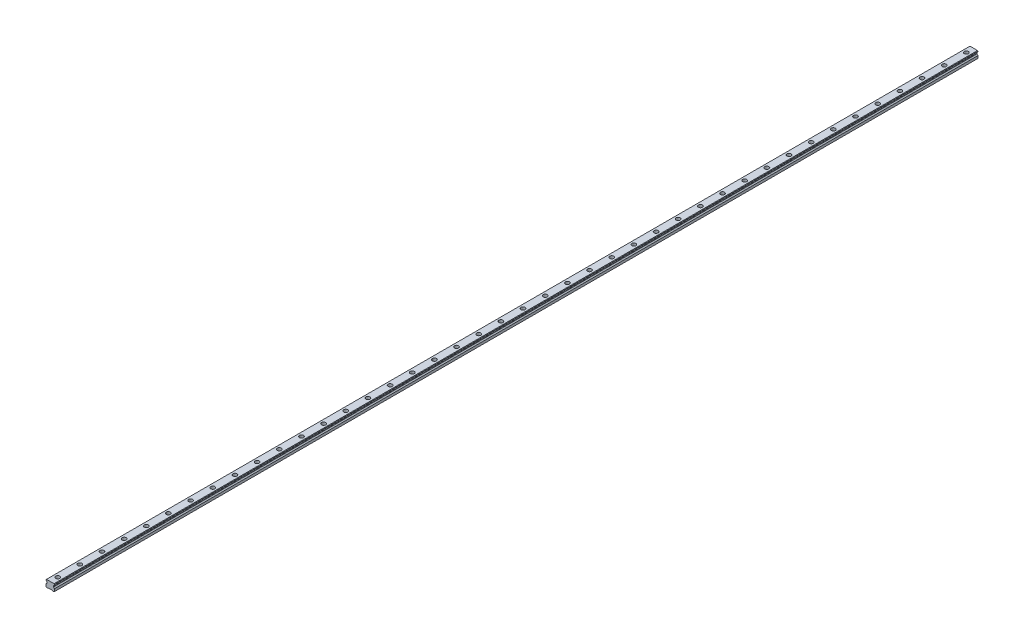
ISO-10303-21;
HEADER;
FILE_DESCRIPTION(('STEP AP214'),'2;1');
FILE_NAME('part.step','',(''),(''),'','','');
FILE_SCHEMA(('AUTOMOTIVE_DESIGN { 1 0 10303 214 1 1 1 1 }'));
ENDSEC;
DATA;
#1=APPLICATION_CONTEXT('core data for automotive mechanical design processes');
#2=APPLICATION_PROTOCOL_DEFINITION('international standard','automotive_design',2000,#1);
#3=PRODUCT_CONTEXT('',#1,'mechanical');
#4=PRODUCT('Part','Part','',(#3));
#5=PRODUCT_RELATED_PRODUCT_CATEGORY('part','',(#4));
#6=PRODUCT_DEFINITION_FORMATION('','',#4);
#7=PRODUCT_DEFINITION_CONTEXT('part definition',#1,'design');
#8=PRODUCT_DEFINITION('design','',#6,#7);
#9=PRODUCT_DEFINITION_SHAPE('','',#8);
#10=(LENGTH_UNIT() NAMED_UNIT(*) SI_UNIT(.MILLI.,.METRE.));
#11=(NAMED_UNIT(*) PLANE_ANGLE_UNIT() SI_UNIT($,.RADIAN.));
#12=(NAMED_UNIT(*) SI_UNIT($,.STERADIAN.) SOLID_ANGLE_UNIT());
#13=UNCERTAINTY_MEASURE_WITH_UNIT(LENGTH_MEASURE(1.E-05),#10,'distance_accuracy_value','');
#14=(GEOMETRIC_REPRESENTATION_CONTEXT(3) GLOBAL_UNCERTAINTY_ASSIGNED_CONTEXT((#13)) GLOBAL_UNIT_ASSIGNED_CONTEXT((#10,
#11,#12)) REPRESENTATION_CONTEXT('',''));
#15=CARTESIAN_POINT('',(0.,0.,0.));
#16=DIRECTION('',(0.,0.,1.));
#17=DIRECTION('',(1.,0.,0.));
#18=AXIS2_PLACEMENT_3D('',#15,#16,#17);
#19=CARTESIAN_POINT('',(0.,10.2,-1230.));
#20=DIRECTION('',(0.,1.,0.));
#21=DIRECTION('',(0.,0.,1.));
#22=AXIS2_PLACEMENT_3D('',#19,#20,#21);
#23=PLANE('',#22);
#24=CARTESIAN_POINT('',(0.,10.2,-1230.));
#25=DIRECTION('',(0.,1.,0.));
#26=DIRECTION('',(0.,0.,1.));
#27=AXIS2_PLACEMENT_3D('',#24,#25,#26);
#28=CIRCLE('',#27,3.49999999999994);
#29=CARTESIAN_POINT('',(0.,10.2,-1226.5));
#30=VERTEX_POINT('',#29);
#31=EDGE_CURVE('E678',#30,#30,#28,.T.);
#32=ORIENTED_EDGE('',*,*,#31,.F.);
#33=EDGE_LOOP('',(#32));
#34=FACE_BOUND('',#33,.T.);
#35=CARTESIAN_POINT('',(0.,10.2,-1230.));
#36=DIRECTION('',(0.,1.,0.));
#37=DIRECTION('',(0.,0.,1.));
#38=AXIS2_PLACEMENT_3D('',#35,#36,#37);
#39=CIRCLE('',#38,5.49999999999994);
#40=CARTESIAN_POINT('',(0.,10.2,-1224.5));
#41=VERTEX_POINT('',#40);
#42=EDGE_CURVE('E11',#41,#41,#39,.T.);
#43=ORIENTED_EDGE('',*,*,#42,.T.);
#44=EDGE_LOOP('',(#43));
#45=FACE_BOUND('',#44,.T.);
#46=ADVANCED_FACE('F39',(#34,#45),#23,.T.);
#47=CARTESIAN_POINT('',(0.,10.2,-1230.));
#48=DIRECTION('',(0.,1.,0.));
#49=DIRECTION('',(0.,0.,1.));
#50=AXIS2_PLACEMENT_3D('',#47,#48,#49);
#51=CYLINDRICAL_SURFACE('',#50,5.49999999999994);
#52=ORIENTED_EDGE('',*,*,#42,.F.);
#53=EDGE_LOOP('',(#52));
#54=FACE_BOUND('',#53,.T.);
#55=CARTESIAN_POINT('',(0.,19.2,-1230.));
#56=DIRECTION('',(0.,1.,0.));
#57=DIRECTION('',(0.,0.,1.));
#58=AXIS2_PLACEMENT_3D('',#55,#56,#57);
#59=CIRCLE('',#58,5.49999999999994);
#60=CARTESIAN_POINT('',(0.,19.2,-1224.5));
#61=VERTEX_POINT('',#60);
#62=EDGE_CURVE('E48',#61,#61,#59,.T.);
#63=ORIENTED_EDGE('',*,*,#62,.T.);
#64=EDGE_LOOP('',(#63));
#65=FACE_BOUND('',#64,.T.);
#66=ADVANCED_FACE('F1254',(#54,#65),#51,.F.);
#67=CARTESIAN_POINT('',(0.,10.2,-1170.));
#68=DIRECTION('',(0.,1.,0.));
#69=DIRECTION('',(0.,0.,1.));
#70=AXIS2_PLACEMENT_3D('',#67,#68,#69);
#71=PLANE('',#70);
#72=CARTESIAN_POINT('',(0.,10.2,-1170.));
#73=DIRECTION('',(0.,1.,0.));
#74=DIRECTION('',(0.,0.,1.));
#75=AXIS2_PLACEMENT_3D('',#72,#73,#74);
#76=CIRCLE('',#75,3.49999999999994);
#77=CARTESIAN_POINT('',(0.,10.2,-1166.5));
#78=VERTEX_POINT('',#77);
#79=EDGE_CURVE('E683',#78,#78,#76,.T.);
#80=ORIENTED_EDGE('',*,*,#79,.F.);
#81=EDGE_LOOP('',(#80));
#82=FACE_BOUND('',#81,.T.);
#83=CARTESIAN_POINT('',(0.,10.2,-1170.));
#84=DIRECTION('',(0.,1.,0.));
#85=DIRECTION('',(0.,0.,1.));
#86=AXIS2_PLACEMENT_3D('',#83,#84,#85);
#87=CIRCLE('',#86,5.49999999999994);
#88=CARTESIAN_POINT('',(0.,10.2,-1164.5));
#89=VERTEX_POINT('',#88);
#90=EDGE_CURVE('E662',#89,#89,#87,.T.);
#91=ORIENTED_EDGE('',*,*,#90,.T.);
#92=EDGE_LOOP('',(#91));
#93=FACE_BOUND('',#92,.T.);
#94=ADVANCED_FACE('F1256',(#82,#93),#71,.T.);
#95=CARTESIAN_POINT('',(0.,10.2,-1170.));
#96=DIRECTION('',(0.,1.,0.));
#97=DIRECTION('',(0.,0.,1.));
#98=AXIS2_PLACEMENT_3D('',#95,#96,#97);
#99=CYLINDRICAL_SURFACE('',#98,5.49999999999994);
#100=ORIENTED_EDGE('',*,*,#90,.F.);
#101=EDGE_LOOP('',(#100));
#102=FACE_BOUND('',#101,.T.);
#103=CARTESIAN_POINT('',(0.,19.2,-1170.));
#104=DIRECTION('',(0.,1.,0.));
#105=DIRECTION('',(0.,0.,1.));
#106=AXIS2_PLACEMENT_3D('',#103,#104,#105);
#107=CIRCLE('',#106,5.49999999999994);
#108=CARTESIAN_POINT('',(0.,19.2,-1164.5));
#109=VERTEX_POINT('',#108);
#110=EDGE_CURVE('E658',#109,#109,#107,.T.);
#111=ORIENTED_EDGE('',*,*,#110,.T.);
#112=EDGE_LOOP('',(#111));
#113=FACE_BOUND('',#112,.T.);
#114=ADVANCED_FACE('F1262',(#102,#113),#99,.F.);
#115=CARTESIAN_POINT('',(0.,10.2,-1110.));
#116=DIRECTION('',(0.,1.,0.));
#117=DIRECTION('',(0.,0.,1.));
#118=AXIS2_PLACEMENT_3D('',#115,#116,#117);
#119=PLANE('',#118);
#120=CARTESIAN_POINT('',(0.,10.2,-1110.));
#121=DIRECTION('',(0.,1.,0.));
#122=DIRECTION('',(0.,0.,1.));
#123=AXIS2_PLACEMENT_3D('',#120,#121,#122);
#124=CIRCLE('',#123,3.49999999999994);
#125=CARTESIAN_POINT('',(0.,10.2,-1106.5));
#126=VERTEX_POINT('',#125);
#127=EDGE_CURVE('E688',#126,#126,#124,.T.);
#128=ORIENTED_EDGE('',*,*,#127,.F.);
#129=EDGE_LOOP('',(#128));
#130=FACE_BOUND('',#129,.T.);
#131=CARTESIAN_POINT('',(0.,10.2,-1110.));
#132=DIRECTION('',(0.,1.,0.));
#133=DIRECTION('',(0.,0.,1.));
#134=AXIS2_PLACEMENT_3D('',#131,#132,#133);
#135=CIRCLE('',#134,5.49999999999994);
#136=CARTESIAN_POINT('',(0.,10.2,-1104.5));
#137=VERTEX_POINT('',#136);
#138=EDGE_CURVE('E654',#137,#137,#135,.T.);
#139=ORIENTED_EDGE('',*,*,#138,.T.);
#140=EDGE_LOOP('',(#139));
#141=FACE_BOUND('',#140,.T.);
#142=ADVANCED_FACE('F1270',(#130,#141),#119,.T.);
#143=CARTESIAN_POINT('',(0.,10.2,-1110.));
#144=DIRECTION('',(0.,1.,0.));
#145=DIRECTION('',(0.,0.,1.));
#146=AXIS2_PLACEMENT_3D('',#143,#144,#145);
#147=CYLINDRICAL_SURFACE('',#146,5.49999999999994);
#148=ORIENTED_EDGE('',*,*,#138,.F.);
#149=EDGE_LOOP('',(#148));
#150=FACE_BOUND('',#149,.T.);
#151=CARTESIAN_POINT('',(0.,19.2,-1110.));
#152=DIRECTION('',(0.,1.,0.));
#153=DIRECTION('',(0.,0.,1.));
#154=AXIS2_PLACEMENT_3D('',#151,#152,#153);
#155=CIRCLE('',#154,5.49999999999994);
#156=CARTESIAN_POINT('',(0.,19.2,-1104.5));
#157=VERTEX_POINT('',#156);
#158=EDGE_CURVE('E650',#157,#157,#155,.T.);
#159=ORIENTED_EDGE('',*,*,#158,.T.);
#160=EDGE_LOOP('',(#159));
#161=FACE_BOUND('',#160,.T.);
#162=ADVANCED_FACE('F1274',(#150,#161),#147,.F.);
#163=CARTESIAN_POINT('',(0.,10.2,-1050.));
#164=DIRECTION('',(0.,1.,0.));
#165=DIRECTION('',(0.,0.,1.));
#166=AXIS2_PLACEMENT_3D('',#163,#164,#165);
#167=PLANE('',#166);
#168=CARTESIAN_POINT('',(0.,10.2,-1050.));
#169=DIRECTION('',(0.,1.,0.));
#170=DIRECTION('',(0.,0.,1.));
#171=AXIS2_PLACEMENT_3D('',#168,#169,#170);
#172=CIRCLE('',#171,3.49999999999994);
#173=CARTESIAN_POINT('',(0.,10.2,-1046.5));
#174=VERTEX_POINT('',#173);
#175=EDGE_CURVE('E693',#174,#174,#172,.T.);
#176=ORIENTED_EDGE('',*,*,#175,.F.);
#177=EDGE_LOOP('',(#176));
#178=FACE_BOUND('',#177,.T.);
#179=CARTESIAN_POINT('',(0.,10.2,-1050.));
#180=DIRECTION('',(0.,1.,0.));
#181=DIRECTION('',(0.,0.,1.));
#182=AXIS2_PLACEMENT_3D('',#179,#180,#181);
#183=CIRCLE('',#182,5.49999999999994);
#184=CARTESIAN_POINT('',(0.,10.2,-1044.5));
#185=VERTEX_POINT('',#184);
#186=EDGE_CURVE('E646',#185,#185,#183,.T.);
#187=ORIENTED_EDGE('',*,*,#186,.T.);
#188=EDGE_LOOP('',(#187));
#189=FACE_BOUND('',#188,.T.);
#190=ADVANCED_FACE('F1278',(#178,#189),#167,.T.);
#191=CARTESIAN_POINT('',(0.,10.2,-1050.));
#192=DIRECTION('',(0.,1.,0.));
#193=DIRECTION('',(0.,0.,1.));
#194=AXIS2_PLACEMENT_3D('',#191,#192,#193);
#195=CYLINDRICAL_SURFACE('',#194,5.49999999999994);
#196=ORIENTED_EDGE('',*,*,#186,.F.);
#197=EDGE_LOOP('',(#196));
#198=FACE_BOUND('',#197,.T.);
#199=CARTESIAN_POINT('',(0.,19.2,-1050.));
#200=DIRECTION('',(0.,1.,0.));
#201=DIRECTION('',(0.,0.,1.));
#202=AXIS2_PLACEMENT_3D('',#199,#200,#201);
#203=CIRCLE('',#202,5.49999999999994);
#204=CARTESIAN_POINT('',(0.,19.2,-1044.5));
#205=VERTEX_POINT('',#204);
#206=EDGE_CURVE('E642',#205,#205,#203,.T.);
#207=ORIENTED_EDGE('',*,*,#206,.T.);
#208=EDGE_LOOP('',(#207));
#209=FACE_BOUND('',#208,.T.);
#210=ADVANCED_FACE('F1282',(#198,#209),#195,.F.);
#211=CARTESIAN_POINT('',(0.,10.2,-990.));
#212=DIRECTION('',(0.,1.,0.));
#213=DIRECTION('',(0.,0.,1.));
#214=AXIS2_PLACEMENT_3D('',#211,#212,#213);
#215=PLANE('',#214);
#216=CARTESIAN_POINT('',(0.,10.2,-990.));
#217=DIRECTION('',(0.,1.,0.));
#218=DIRECTION('',(0.,0.,1.));
#219=AXIS2_PLACEMENT_3D('',#216,#217,#218);
#220=CIRCLE('',#219,3.49999999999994);
#221=CARTESIAN_POINT('',(0.,10.2,-986.5));
#222=VERTEX_POINT('',#221);
#223=EDGE_CURVE('E698',#222,#222,#220,.T.);
#224=ORIENTED_EDGE('',*,*,#223,.F.);
#225=EDGE_LOOP('',(#224));
#226=FACE_BOUND('',#225,.T.);
#227=CARTESIAN_POINT('',(0.,10.2,-990.));
#228=DIRECTION('',(0.,1.,0.));
#229=DIRECTION('',(0.,0.,1.));
#230=AXIS2_PLACEMENT_3D('',#227,#228,#229);
#231=CIRCLE('',#230,5.49999999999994);
#232=CARTESIAN_POINT('',(0.,10.2,-984.5));
#233=VERTEX_POINT('',#232);
#234=EDGE_CURVE('E638',#233,#233,#231,.T.);
#235=ORIENTED_EDGE('',*,*,#234,.T.);
#236=EDGE_LOOP('',(#235));
#237=FACE_BOUND('',#236,.T.);
#238=ADVANCED_FACE('F1286',(#226,#237),#215,.T.);
#239=CARTESIAN_POINT('',(0.,10.2,-990.));
#240=DIRECTION('',(0.,1.,0.));
#241=DIRECTION('',(0.,0.,1.));
#242=AXIS2_PLACEMENT_3D('',#239,#240,#241);
#243=CYLINDRICAL_SURFACE('',#242,5.49999999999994);
#244=ORIENTED_EDGE('',*,*,#234,.F.);
#245=EDGE_LOOP('',(#244));
#246=FACE_BOUND('',#245,.T.);
#247=CARTESIAN_POINT('',(0.,19.2,-990.));
#248=DIRECTION('',(0.,1.,0.));
#249=DIRECTION('',(0.,0.,1.));
#250=AXIS2_PLACEMENT_3D('',#247,#248,#249);
#251=CIRCLE('',#250,5.49999999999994);
#252=CARTESIAN_POINT('',(0.,19.2,-984.5));
#253=VERTEX_POINT('',#252);
#254=EDGE_CURVE('E634',#253,#253,#251,.T.);
#255=ORIENTED_EDGE('',*,*,#254,.T.);
#256=EDGE_LOOP('',(#255));
#257=FACE_BOUND('',#256,.T.);
#258=ADVANCED_FACE('F1290',(#246,#257),#243,.F.);
#259=CARTESIAN_POINT('',(0.,10.2,-930.));
#260=DIRECTION('',(0.,1.,0.));
#261=DIRECTION('',(0.,0.,1.));
#262=AXIS2_PLACEMENT_3D('',#259,#260,#261);
#263=PLANE('',#262);
#264=CARTESIAN_POINT('',(0.,10.2,-930.));
#265=DIRECTION('',(0.,1.,0.));
#266=DIRECTION('',(0.,0.,1.));
#267=AXIS2_PLACEMENT_3D('',#264,#265,#266);
#268=CIRCLE('',#267,3.49999999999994);
#269=CARTESIAN_POINT('',(0.,10.2,-926.5));
#270=VERTEX_POINT('',#269);
#271=EDGE_CURVE('E703',#270,#270,#268,.T.);
#272=ORIENTED_EDGE('',*,*,#271,.F.);
#273=EDGE_LOOP('',(#272));
#274=FACE_BOUND('',#273,.T.);
#275=CARTESIAN_POINT('',(0.,10.2,-930.));
#276=DIRECTION('',(0.,1.,0.));
#277=DIRECTION('',(0.,0.,1.));
#278=AXIS2_PLACEMENT_3D('',#275,#276,#277);
#279=CIRCLE('',#278,5.49999999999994);
#280=CARTESIAN_POINT('',(0.,10.2,-924.5));
#281=VERTEX_POINT('',#280);
#282=EDGE_CURVE('E630',#281,#281,#279,.T.);
#283=ORIENTED_EDGE('',*,*,#282,.T.);
#284=EDGE_LOOP('',(#283));
#285=FACE_BOUND('',#284,.T.);
#286=ADVANCED_FACE('F1294',(#274,#285),#263,.T.);
#287=CARTESIAN_POINT('',(0.,10.2,-930.));
#288=DIRECTION('',(0.,1.,0.));
#289=DIRECTION('',(0.,0.,1.));
#290=AXIS2_PLACEMENT_3D('',#287,#288,#289);
#291=CYLINDRICAL_SURFACE('',#290,5.49999999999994);
#292=ORIENTED_EDGE('',*,*,#282,.F.);
#293=EDGE_LOOP('',(#292));
#294=FACE_BOUND('',#293,.T.);
#295=CARTESIAN_POINT('',(0.,19.2,-930.));
#296=DIRECTION('',(0.,1.,0.));
#297=DIRECTION('',(0.,0.,1.));
#298=AXIS2_PLACEMENT_3D('',#295,#296,#297);
#299=CIRCLE('',#298,5.49999999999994);
#300=CARTESIAN_POINT('',(0.,19.2,-924.5));
#301=VERTEX_POINT('',#300);
#302=EDGE_CURVE('E626',#301,#301,#299,.T.);
#303=ORIENTED_EDGE('',*,*,#302,.T.);
#304=EDGE_LOOP('',(#303));
#305=FACE_BOUND('',#304,.T.);
#306=ADVANCED_FACE('F1298',(#294,#305),#291,.F.);
#307=CARTESIAN_POINT('',(0.,10.2,-870.));
#308=DIRECTION('',(0.,1.,0.));
#309=DIRECTION('',(0.,0.,1.));
#310=AXIS2_PLACEMENT_3D('',#307,#308,#309);
#311=PLANE('',#310);
#312=CARTESIAN_POINT('',(0.,10.2,-870.));
#313=DIRECTION('',(0.,1.,0.));
#314=DIRECTION('',(0.,0.,1.));
#315=AXIS2_PLACEMENT_3D('',#312,#313,#314);
#316=CIRCLE('',#315,3.49999999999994);
#317=CARTESIAN_POINT('',(0.,10.2,-866.5));
#318=VERTEX_POINT('',#317);
#319=EDGE_CURVE('E708',#318,#318,#316,.T.);
#320=ORIENTED_EDGE('',*,*,#319,.F.);
#321=EDGE_LOOP('',(#320));
#322=FACE_BOUND('',#321,.T.);
#323=CARTESIAN_POINT('',(0.,10.2,-870.));
#324=DIRECTION('',(0.,1.,0.));
#325=DIRECTION('',(0.,0.,1.));
#326=AXIS2_PLACEMENT_3D('',#323,#324,#325);
#327=CIRCLE('',#326,5.49999999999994);
#328=CARTESIAN_POINT('',(0.,10.2,-864.5));
#329=VERTEX_POINT('',#328);
#330=EDGE_CURVE('E622',#329,#329,#327,.T.);
#331=ORIENTED_EDGE('',*,*,#330,.T.);
#332=EDGE_LOOP('',(#331));
#333=FACE_BOUND('',#332,.T.);
#334=ADVANCED_FACE('F1302',(#322,#333),#311,.T.);
#335=CARTESIAN_POINT('',(0.,10.2,-870.));
#336=DIRECTION('',(0.,1.,0.));
#337=DIRECTION('',(0.,0.,1.));
#338=AXIS2_PLACEMENT_3D('',#335,#336,#337);
#339=CYLINDRICAL_SURFACE('',#338,5.49999999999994);
#340=ORIENTED_EDGE('',*,*,#330,.F.);
#341=EDGE_LOOP('',(#340));
#342=FACE_BOUND('',#341,.T.);
#343=CARTESIAN_POINT('',(0.,19.2,-870.));
#344=DIRECTION('',(0.,1.,0.));
#345=DIRECTION('',(0.,0.,1.));
#346=AXIS2_PLACEMENT_3D('',#343,#344,#345);
#347=CIRCLE('',#346,5.49999999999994);
#348=CARTESIAN_POINT('',(0.,19.2,-864.5));
#349=VERTEX_POINT('',#348);
#350=EDGE_CURVE('E618',#349,#349,#347,.T.);
#351=ORIENTED_EDGE('',*,*,#350,.T.);
#352=EDGE_LOOP('',(#351));
#353=FACE_BOUND('',#352,.T.);
#354=ADVANCED_FACE('F1306',(#342,#353),#339,.F.);
#355=CARTESIAN_POINT('',(0.,10.2,-810.));
#356=DIRECTION('',(0.,1.,0.));
#357=DIRECTION('',(0.,0.,1.));
#358=AXIS2_PLACEMENT_3D('',#355,#356,#357);
#359=PLANE('',#358);
#360=CARTESIAN_POINT('',(0.,10.2,-810.));
#361=DIRECTION('',(0.,1.,0.));
#362=DIRECTION('',(0.,0.,1.));
#363=AXIS2_PLACEMENT_3D('',#360,#361,#362);
#364=CIRCLE('',#363,3.49999999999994);
#365=CARTESIAN_POINT('',(0.,10.2,-806.5));
#366=VERTEX_POINT('',#365);
#367=EDGE_CURVE('E713',#366,#366,#364,.T.);
#368=ORIENTED_EDGE('',*,*,#367,.F.);
#369=EDGE_LOOP('',(#368));
#370=FACE_BOUND('',#369,.T.);
#371=CARTESIAN_POINT('',(0.,10.2,-810.));
#372=DIRECTION('',(0.,1.,0.));
#373=DIRECTION('',(0.,0.,1.));
#374=AXIS2_PLACEMENT_3D('',#371,#372,#373);
#375=CIRCLE('',#374,5.49999999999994);
#376=CARTESIAN_POINT('',(0.,10.2,-804.5));
#377=VERTEX_POINT('',#376);
#378=EDGE_CURVE('E614',#377,#377,#375,.T.);
#379=ORIENTED_EDGE('',*,*,#378,.T.);
#380=EDGE_LOOP('',(#379));
#381=FACE_BOUND('',#380,.T.);
#382=ADVANCED_FACE('F1310',(#370,#381),#359,.T.);
#383=CARTESIAN_POINT('',(0.,10.2,-810.));
#384=DIRECTION('',(0.,1.,0.));
#385=DIRECTION('',(0.,0.,1.));
#386=AXIS2_PLACEMENT_3D('',#383,#384,#385);
#387=CYLINDRICAL_SURFACE('',#386,5.49999999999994);
#388=ORIENTED_EDGE('',*,*,#378,.F.);
#389=EDGE_LOOP('',(#388));
#390=FACE_BOUND('',#389,.T.);
#391=CARTESIAN_POINT('',(0.,19.2,-810.));
#392=DIRECTION('',(0.,1.,0.));
#393=DIRECTION('',(0.,0.,1.));
#394=AXIS2_PLACEMENT_3D('',#391,#392,#393);
#395=CIRCLE('',#394,5.49999999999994);
#396=CARTESIAN_POINT('',(0.,19.2,-804.5));
#397=VERTEX_POINT('',#396);
#398=EDGE_CURVE('E610',#397,#397,#395,.T.);
#399=ORIENTED_EDGE('',*,*,#398,.T.);
#400=EDGE_LOOP('',(#399));
#401=FACE_BOUND('',#400,.T.);
#402=ADVANCED_FACE('F1314',(#390,#401),#387,.F.);
#403=CARTESIAN_POINT('',(0.,10.2,-750.));
#404=DIRECTION('',(0.,1.,0.));
#405=DIRECTION('',(0.,0.,1.));
#406=AXIS2_PLACEMENT_3D('',#403,#404,#405);
#407=PLANE('',#406);
#408=CARTESIAN_POINT('',(0.,10.2,-750.));
#409=DIRECTION('',(0.,1.,0.));
#410=DIRECTION('',(0.,0.,1.));
#411=AXIS2_PLACEMENT_3D('',#408,#409,#410);
#412=CIRCLE('',#411,3.49999999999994);
#413=CARTESIAN_POINT('',(0.,10.2,-746.5));
#414=VERTEX_POINT('',#413);
#415=EDGE_CURVE('E718',#414,#414,#412,.T.);
#416=ORIENTED_EDGE('',*,*,#415,.F.);
#417=EDGE_LOOP('',(#416));
#418=FACE_BOUND('',#417,.T.);
#419=CARTESIAN_POINT('',(0.,10.2,-750.));
#420=DIRECTION('',(0.,1.,0.));
#421=DIRECTION('',(0.,0.,1.));
#422=AXIS2_PLACEMENT_3D('',#419,#420,#421);
#423=CIRCLE('',#422,5.49999999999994);
#424=CARTESIAN_POINT('',(0.,10.2,-744.5));
#425=VERTEX_POINT('',#424);
#426=EDGE_CURVE('E606',#425,#425,#423,.T.);
#427=ORIENTED_EDGE('',*,*,#426,.T.);
#428=EDGE_LOOP('',(#427));
#429=FACE_BOUND('',#428,.T.);
#430=ADVANCED_FACE('F1318',(#418,#429),#407,.T.);
#431=CARTESIAN_POINT('',(0.,10.2,-750.));
#432=DIRECTION('',(0.,1.,0.));
#433=DIRECTION('',(0.,0.,1.));
#434=AXIS2_PLACEMENT_3D('',#431,#432,#433);
#435=CYLINDRICAL_SURFACE('',#434,5.49999999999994);
#436=ORIENTED_EDGE('',*,*,#426,.F.);
#437=EDGE_LOOP('',(#436));
#438=FACE_BOUND('',#437,.T.);
#439=CARTESIAN_POINT('',(0.,19.2,-750.));
#440=DIRECTION('',(0.,1.,0.));
#441=DIRECTION('',(0.,0.,1.));
#442=AXIS2_PLACEMENT_3D('',#439,#440,#441);
#443=CIRCLE('',#442,5.49999999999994);
#444=CARTESIAN_POINT('',(0.,19.2,-744.5));
#445=VERTEX_POINT('',#444);
#446=EDGE_CURVE('E602',#445,#445,#443,.T.);
#447=ORIENTED_EDGE('',*,*,#446,.T.);
#448=EDGE_LOOP('',(#447));
#449=FACE_BOUND('',#448,.T.);
#450=ADVANCED_FACE('F1322',(#438,#449),#435,.F.);
#451=CARTESIAN_POINT('',(0.,10.2,-690.));
#452=DIRECTION('',(0.,1.,0.));
#453=DIRECTION('',(0.,0.,1.));
#454=AXIS2_PLACEMENT_3D('',#451,#452,#453);
#455=PLANE('',#454);
#456=CARTESIAN_POINT('',(0.,10.2,-690.));
#457=DIRECTION('',(0.,1.,0.));
#458=DIRECTION('',(0.,0.,1.));
#459=AXIS2_PLACEMENT_3D('',#456,#457,#458);
#460=CIRCLE('',#459,3.49999999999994);
#461=CARTESIAN_POINT('',(0.,10.2,-686.5));
#462=VERTEX_POINT('',#461);
#463=EDGE_CURVE('E723',#462,#462,#460,.T.);
#464=ORIENTED_EDGE('',*,*,#463,.F.);
#465=EDGE_LOOP('',(#464));
#466=FACE_BOUND('',#465,.T.);
#467=CARTESIAN_POINT('',(0.,10.2,-690.));
#468=DIRECTION('',(0.,1.,0.));
#469=DIRECTION('',(0.,0.,1.));
#470=AXIS2_PLACEMENT_3D('',#467,#468,#469);
#471=CIRCLE('',#470,5.49999999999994);
#472=CARTESIAN_POINT('',(0.,10.2,-684.5));
#473=VERTEX_POINT('',#472);
#474=EDGE_CURVE('E598',#473,#473,#471,.T.);
#475=ORIENTED_EDGE('',*,*,#474,.T.);
#476=EDGE_LOOP('',(#475));
#477=FACE_BOUND('',#476,.T.);
#478=ADVANCED_FACE('F1326',(#466,#477),#455,.T.);
#479=CARTESIAN_POINT('',(0.,10.2,-690.));
#480=DIRECTION('',(0.,1.,0.));
#481=DIRECTION('',(0.,0.,1.));
#482=AXIS2_PLACEMENT_3D('',#479,#480,#481);
#483=CYLINDRICAL_SURFACE('',#482,5.49999999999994);
#484=ORIENTED_EDGE('',*,*,#474,.F.);
#485=EDGE_LOOP('',(#484));
#486=FACE_BOUND('',#485,.T.);
#487=CARTESIAN_POINT('',(0.,19.2,-690.));
#488=DIRECTION('',(0.,1.,0.));
#489=DIRECTION('',(0.,0.,1.));
#490=AXIS2_PLACEMENT_3D('',#487,#488,#489);
#491=CIRCLE('',#490,5.49999999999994);
#492=CARTESIAN_POINT('',(0.,19.2,-684.5));
#493=VERTEX_POINT('',#492);
#494=EDGE_CURVE('E594',#493,#493,#491,.T.);
#495=ORIENTED_EDGE('',*,*,#494,.T.);
#496=EDGE_LOOP('',(#495));
#497=FACE_BOUND('',#496,.T.);
#498=ADVANCED_FACE('F1330',(#486,#497),#483,.F.);
#499=CARTESIAN_POINT('',(0.,10.2,-630.));
#500=DIRECTION('',(0.,1.,0.));
#501=DIRECTION('',(0.,0.,1.));
#502=AXIS2_PLACEMENT_3D('',#499,#500,#501);
#503=PLANE('',#502);
#504=CARTESIAN_POINT('',(0.,10.2,-630.));
#505=DIRECTION('',(0.,1.,0.));
#506=DIRECTION('',(0.,0.,1.));
#507=AXIS2_PLACEMENT_3D('',#504,#505,#506);
#508=CIRCLE('',#507,3.49999999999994);
#509=CARTESIAN_POINT('',(0.,10.2,-626.5));
#510=VERTEX_POINT('',#509);
#511=EDGE_CURVE('E728',#510,#510,#508,.T.);
#512=ORIENTED_EDGE('',*,*,#511,.F.);
#513=EDGE_LOOP('',(#512));
#514=FACE_BOUND('',#513,.T.);
#515=CARTESIAN_POINT('',(0.,10.2,-630.));
#516=DIRECTION('',(0.,1.,0.));
#517=DIRECTION('',(0.,0.,1.));
#518=AXIS2_PLACEMENT_3D('',#515,#516,#517);
#519=CIRCLE('',#518,5.49999999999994);
#520=CARTESIAN_POINT('',(0.,10.2,-624.5));
#521=VERTEX_POINT('',#520);
#522=EDGE_CURVE('E590',#521,#521,#519,.T.);
#523=ORIENTED_EDGE('',*,*,#522,.T.);
#524=EDGE_LOOP('',(#523));
#525=FACE_BOUND('',#524,.T.);
#526=ADVANCED_FACE('F1334',(#514,#525),#503,.T.);
#527=CARTESIAN_POINT('',(0.,10.2,-630.));
#528=DIRECTION('',(0.,1.,0.));
#529=DIRECTION('',(0.,0.,1.));
#530=AXIS2_PLACEMENT_3D('',#527,#528,#529);
#531=CYLINDRICAL_SURFACE('',#530,5.49999999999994);
#532=ORIENTED_EDGE('',*,*,#522,.F.);
#533=EDGE_LOOP('',(#532));
#534=FACE_BOUND('',#533,.T.);
#535=CARTESIAN_POINT('',(0.,19.2,-630.));
#536=DIRECTION('',(0.,1.,0.));
#537=DIRECTION('',(0.,0.,1.));
#538=AXIS2_PLACEMENT_3D('',#535,#536,#537);
#539=CIRCLE('',#538,5.49999999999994);
#540=CARTESIAN_POINT('',(0.,19.2,-624.5));
#541=VERTEX_POINT('',#540);
#542=EDGE_CURVE('E586',#541,#541,#539,.T.);
#543=ORIENTED_EDGE('',*,*,#542,.T.);
#544=EDGE_LOOP('',(#543));
#545=FACE_BOUND('',#544,.T.);
#546=ADVANCED_FACE('F1338',(#534,#545),#531,.F.);
#547=CARTESIAN_POINT('',(0.,10.2,-570.));
#548=DIRECTION('',(0.,1.,0.));
#549=DIRECTION('',(0.,0.,1.));
#550=AXIS2_PLACEMENT_3D('',#547,#548,#549);
#551=PLANE('',#550);
#552=CARTESIAN_POINT('',(0.,10.2,-570.));
#553=DIRECTION('',(0.,1.,0.));
#554=DIRECTION('',(0.,0.,1.));
#555=AXIS2_PLACEMENT_3D('',#552,#553,#554);
#556=CIRCLE('',#555,3.49999999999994);
#557=CARTESIAN_POINT('',(0.,10.2,-566.5));
#558=VERTEX_POINT('',#557);
#559=EDGE_CURVE('E733',#558,#558,#556,.T.);
#560=ORIENTED_EDGE('',*,*,#559,.F.);
#561=EDGE_LOOP('',(#560));
#562=FACE_BOUND('',#561,.T.);
#563=CARTESIAN_POINT('',(0.,10.2,-570.));
#564=DIRECTION('',(0.,1.,0.));
#565=DIRECTION('',(0.,0.,1.));
#566=AXIS2_PLACEMENT_3D('',#563,#564,#565);
#567=CIRCLE('',#566,5.49999999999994);
#568=CARTESIAN_POINT('',(0.,10.2,-564.5));
#569=VERTEX_POINT('',#568);
#570=EDGE_CURVE('E582',#569,#569,#567,.T.);
#571=ORIENTED_EDGE('',*,*,#570,.T.);
#572=EDGE_LOOP('',(#571));
#573=FACE_BOUND('',#572,.T.);
#574=ADVANCED_FACE('F1342',(#562,#573),#551,.T.);
#575=CARTESIAN_POINT('',(0.,10.2,-570.));
#576=DIRECTION('',(0.,1.,0.));
#577=DIRECTION('',(0.,0.,1.));
#578=AXIS2_PLACEMENT_3D('',#575,#576,#577);
#579=CYLINDRICAL_SURFACE('',#578,5.49999999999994);
#580=ORIENTED_EDGE('',*,*,#570,.F.);
#581=EDGE_LOOP('',(#580));
#582=FACE_BOUND('',#581,.T.);
#583=CARTESIAN_POINT('',(0.,19.2,-570.));
#584=DIRECTION('',(0.,1.,0.));
#585=DIRECTION('',(0.,0.,1.));
#586=AXIS2_PLACEMENT_3D('',#583,#584,#585);
#587=CIRCLE('',#586,5.49999999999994);
#588=CARTESIAN_POINT('',(0.,19.2,-564.5));
#589=VERTEX_POINT('',#588);
#590=EDGE_CURVE('E578',#589,#589,#587,.T.);
#591=ORIENTED_EDGE('',*,*,#590,.T.);
#592=EDGE_LOOP('',(#591));
#593=FACE_BOUND('',#592,.T.);
#594=ADVANCED_FACE('F1346',(#582,#593),#579,.F.);
#595=CARTESIAN_POINT('',(0.,10.2,-510.));
#596=DIRECTION('',(0.,1.,0.));
#597=DIRECTION('',(0.,0.,1.));
#598=AXIS2_PLACEMENT_3D('',#595,#596,#597);
#599=PLANE('',#598);
#600=CARTESIAN_POINT('',(0.,10.2,-510.));
#601=DIRECTION('',(0.,1.,0.));
#602=DIRECTION('',(0.,0.,1.));
#603=AXIS2_PLACEMENT_3D('',#600,#601,#602);
#604=CIRCLE('',#603,3.49999999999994);
#605=CARTESIAN_POINT('',(0.,10.2,-506.5));
#606=VERTEX_POINT('',#605);
#607=EDGE_CURVE('E738',#606,#606,#604,.T.);
#608=ORIENTED_EDGE('',*,*,#607,.F.);
#609=EDGE_LOOP('',(#608));
#610=FACE_BOUND('',#609,.T.);
#611=CARTESIAN_POINT('',(0.,10.2,-510.));
#612=DIRECTION('',(0.,1.,0.));
#613=DIRECTION('',(0.,0.,1.));
#614=AXIS2_PLACEMENT_3D('',#611,#612,#613);
#615=CIRCLE('',#614,5.49999999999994);
#616=CARTESIAN_POINT('',(0.,10.2,-504.5));
#617=VERTEX_POINT('',#616);
#618=EDGE_CURVE('E574',#617,#617,#615,.T.);
#619=ORIENTED_EDGE('',*,*,#618,.T.);
#620=EDGE_LOOP('',(#619));
#621=FACE_BOUND('',#620,.T.);
#622=ADVANCED_FACE('F1350',(#610,#621),#599,.T.);
#623=CARTESIAN_POINT('',(0.,10.2,-510.));
#624=DIRECTION('',(0.,1.,0.));
#625=DIRECTION('',(0.,0.,1.));
#626=AXIS2_PLACEMENT_3D('',#623,#624,#625);
#627=CYLINDRICAL_SURFACE('',#626,5.49999999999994);
#628=ORIENTED_EDGE('',*,*,#618,.F.);
#629=EDGE_LOOP('',(#628));
#630=FACE_BOUND('',#629,.T.);
#631=CARTESIAN_POINT('',(0.,19.2,-510.));
#632=DIRECTION('',(0.,1.,0.));
#633=DIRECTION('',(0.,0.,1.));
#634=AXIS2_PLACEMENT_3D('',#631,#632,#633);
#635=CIRCLE('',#634,5.49999999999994);
#636=CARTESIAN_POINT('',(0.,19.2,-504.5));
#637=VERTEX_POINT('',#636);
#638=EDGE_CURVE('E570',#637,#637,#635,.T.);
#639=ORIENTED_EDGE('',*,*,#638,.T.);
#640=EDGE_LOOP('',(#639));
#641=FACE_BOUND('',#640,.T.);
#642=ADVANCED_FACE('F1354',(#630,#641),#627,.F.);
#643=CARTESIAN_POINT('',(0.,10.2,-450.));
#644=DIRECTION('',(0.,1.,0.));
#645=DIRECTION('',(0.,0.,1.));
#646=AXIS2_PLACEMENT_3D('',#643,#644,#645);
#647=PLANE('',#646);
#648=CARTESIAN_POINT('',(0.,10.2,-450.));
#649=DIRECTION('',(0.,1.,0.));
#650=DIRECTION('',(0.,0.,1.));
#651=AXIS2_PLACEMENT_3D('',#648,#649,#650);
#652=CIRCLE('',#651,3.49999999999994);
#653=CARTESIAN_POINT('',(0.,10.2,-446.5));
#654=VERTEX_POINT('',#653);
#655=EDGE_CURVE('E743',#654,#654,#652,.T.);
#656=ORIENTED_EDGE('',*,*,#655,.F.);
#657=EDGE_LOOP('',(#656));
#658=FACE_BOUND('',#657,.T.);
#659=CARTESIAN_POINT('',(0.,10.2,-450.));
#660=DIRECTION('',(0.,1.,0.));
#661=DIRECTION('',(0.,0.,1.));
#662=AXIS2_PLACEMENT_3D('',#659,#660,#661);
#663=CIRCLE('',#662,5.49999999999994);
#664=CARTESIAN_POINT('',(0.,10.2,-444.5));
#665=VERTEX_POINT('',#664);
#666=EDGE_CURVE('E566',#665,#665,#663,.T.);
#667=ORIENTED_EDGE('',*,*,#666,.T.);
#668=EDGE_LOOP('',(#667));
#669=FACE_BOUND('',#668,.T.);
#670=ADVANCED_FACE('F1358',(#658,#669),#647,.T.);
#671=CARTESIAN_POINT('',(0.,10.2,-450.));
#672=DIRECTION('',(0.,1.,0.));
#673=DIRECTION('',(0.,0.,1.));
#674=AXIS2_PLACEMENT_3D('',#671,#672,#673);
#675=CYLINDRICAL_SURFACE('',#674,5.49999999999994);
#676=ORIENTED_EDGE('',*,*,#666,.F.);
#677=EDGE_LOOP('',(#676));
#678=FACE_BOUND('',#677,.T.);
#679=CARTESIAN_POINT('',(0.,19.2,-450.));
#680=DIRECTION('',(0.,1.,0.));
#681=DIRECTION('',(0.,0.,1.));
#682=AXIS2_PLACEMENT_3D('',#679,#680,#681);
#683=CIRCLE('',#682,5.49999999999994);
#684=CARTESIAN_POINT('',(0.,19.2,-444.5));
#685=VERTEX_POINT('',#684);
#686=EDGE_CURVE('E562',#685,#685,#683,.T.);
#687=ORIENTED_EDGE('',*,*,#686,.T.);
#688=EDGE_LOOP('',(#687));
#689=FACE_BOUND('',#688,.T.);
#690=ADVANCED_FACE('F1362',(#678,#689),#675,.F.);
#691=CARTESIAN_POINT('',(0.,10.2,-390.));
#692=DIRECTION('',(0.,1.,0.));
#693=DIRECTION('',(0.,0.,1.));
#694=AXIS2_PLACEMENT_3D('',#691,#692,#693);
#695=PLANE('',#694);
#696=CARTESIAN_POINT('',(0.,10.2,-390.));
#697=DIRECTION('',(0.,1.,0.));
#698=DIRECTION('',(0.,0.,1.));
#699=AXIS2_PLACEMENT_3D('',#696,#697,#698);
#700=CIRCLE('',#699,3.49999999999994);
#701=CARTESIAN_POINT('',(0.,10.2,-386.5));
#702=VERTEX_POINT('',#701);
#703=EDGE_CURVE('E748',#702,#702,#700,.T.);
#704=ORIENTED_EDGE('',*,*,#703,.F.);
#705=EDGE_LOOP('',(#704));
#706=FACE_BOUND('',#705,.T.);
#707=CARTESIAN_POINT('',(0.,10.2,-390.));
#708=DIRECTION('',(0.,1.,0.));
#709=DIRECTION('',(0.,0.,1.));
#710=AXIS2_PLACEMENT_3D('',#707,#708,#709);
#711=CIRCLE('',#710,5.49999999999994);
#712=CARTESIAN_POINT('',(0.,10.2,-384.5));
#713=VERTEX_POINT('',#712);
#714=EDGE_CURVE('E558',#713,#713,#711,.T.);
#715=ORIENTED_EDGE('',*,*,#714,.T.);
#716=EDGE_LOOP('',(#715));
#717=FACE_BOUND('',#716,.T.);
#718=ADVANCED_FACE('F1366',(#706,#717),#695,.T.);
#719=CARTESIAN_POINT('',(0.,10.2,-390.));
#720=DIRECTION('',(0.,1.,0.));
#721=DIRECTION('',(0.,0.,1.));
#722=AXIS2_PLACEMENT_3D('',#719,#720,#721);
#723=CYLINDRICAL_SURFACE('',#722,5.49999999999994);
#724=ORIENTED_EDGE('',*,*,#714,.F.);
#725=EDGE_LOOP('',(#724));
#726=FACE_BOUND('',#725,.T.);
#727=CARTESIAN_POINT('',(0.,19.2,-390.));
#728=DIRECTION('',(0.,1.,0.));
#729=DIRECTION('',(0.,0.,1.));
#730=AXIS2_PLACEMENT_3D('',#727,#728,#729);
#731=CIRCLE('',#730,5.49999999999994);
#732=CARTESIAN_POINT('',(0.,19.2,-384.5));
#733=VERTEX_POINT('',#732);
#734=EDGE_CURVE('E554',#733,#733,#731,.T.);
#735=ORIENTED_EDGE('',*,*,#734,.T.);
#736=EDGE_LOOP('',(#735));
#737=FACE_BOUND('',#736,.T.);
#738=ADVANCED_FACE('F1370',(#726,#737),#723,.F.);
#739=CARTESIAN_POINT('',(0.,10.2,-330.));
#740=DIRECTION('',(0.,1.,0.));
#741=DIRECTION('',(0.,0.,1.));
#742=AXIS2_PLACEMENT_3D('',#739,#740,#741);
#743=PLANE('',#742);
#744=CARTESIAN_POINT('',(0.,10.2,-330.));
#745=DIRECTION('',(0.,1.,0.));
#746=DIRECTION('',(0.,0.,1.));
#747=AXIS2_PLACEMENT_3D('',#744,#745,#746);
#748=CIRCLE('',#747,3.49999999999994);
#749=CARTESIAN_POINT('',(0.,10.2,-326.5));
#750=VERTEX_POINT('',#749);
#751=EDGE_CURVE('E753',#750,#750,#748,.T.);
#752=ORIENTED_EDGE('',*,*,#751,.F.);
#753=EDGE_LOOP('',(#752));
#754=FACE_BOUND('',#753,.T.);
#755=CARTESIAN_POINT('',(0.,10.2,-330.));
#756=DIRECTION('',(0.,1.,0.));
#757=DIRECTION('',(0.,0.,1.));
#758=AXIS2_PLACEMENT_3D('',#755,#756,#757);
#759=CIRCLE('',#758,5.49999999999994);
#760=CARTESIAN_POINT('',(0.,10.2,-324.5));
#761=VERTEX_POINT('',#760);
#762=EDGE_CURVE('E550',#761,#761,#759,.T.);
#763=ORIENTED_EDGE('',*,*,#762,.T.);
#764=EDGE_LOOP('',(#763));
#765=FACE_BOUND('',#764,.T.);
#766=ADVANCED_FACE('F1374',(#754,#765),#743,.T.);
#767=CARTESIAN_POINT('',(0.,10.2,-330.));
#768=DIRECTION('',(0.,1.,0.));
#769=DIRECTION('',(0.,0.,1.));
#770=AXIS2_PLACEMENT_3D('',#767,#768,#769);
#771=CYLINDRICAL_SURFACE('',#770,5.49999999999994);
#772=ORIENTED_EDGE('',*,*,#762,.F.);
#773=EDGE_LOOP('',(#772));
#774=FACE_BOUND('',#773,.T.);
#775=CARTESIAN_POINT('',(0.,19.2,-330.));
#776=DIRECTION('',(0.,1.,0.));
#777=DIRECTION('',(0.,0.,1.));
#778=AXIS2_PLACEMENT_3D('',#775,#776,#777);
#779=CIRCLE('',#778,5.49999999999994);
#780=CARTESIAN_POINT('',(0.,19.2,-324.5));
#781=VERTEX_POINT('',#780);
#782=EDGE_CURVE('E546',#781,#781,#779,.T.);
#783=ORIENTED_EDGE('',*,*,#782,.T.);
#784=EDGE_LOOP('',(#783));
#785=FACE_BOUND('',#784,.T.);
#786=ADVANCED_FACE('F1378',(#774,#785),#771,.F.);
#787=CARTESIAN_POINT('',(0.,10.2,-270.));
#788=DIRECTION('',(0.,1.,0.));
#789=DIRECTION('',(0.,0.,1.));
#790=AXIS2_PLACEMENT_3D('',#787,#788,#789);
#791=PLANE('',#790);
#792=CARTESIAN_POINT('',(0.,10.2,-270.));
#793=DIRECTION('',(0.,1.,0.));
#794=DIRECTION('',(0.,0.,1.));
#795=AXIS2_PLACEMENT_3D('',#792,#793,#794);
#796=CIRCLE('',#795,3.49999999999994);
#797=CARTESIAN_POINT('',(0.,10.2,-266.5));
#798=VERTEX_POINT('',#797);
#799=EDGE_CURVE('E758',#798,#798,#796,.T.);
#800=ORIENTED_EDGE('',*,*,#799,.F.);
#801=EDGE_LOOP('',(#800));
#802=FACE_BOUND('',#801,.T.);
#803=CARTESIAN_POINT('',(0.,10.2,-270.));
#804=DIRECTION('',(0.,1.,0.));
#805=DIRECTION('',(0.,0.,1.));
#806=AXIS2_PLACEMENT_3D('',#803,#804,#805);
#807=CIRCLE('',#806,5.49999999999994);
#808=CARTESIAN_POINT('',(0.,10.2,-264.5));
#809=VERTEX_POINT('',#808);
#810=EDGE_CURVE('E542',#809,#809,#807,.T.);
#811=ORIENTED_EDGE('',*,*,#810,.T.);
#812=EDGE_LOOP('',(#811));
#813=FACE_BOUND('',#812,.T.);
#814=ADVANCED_FACE('F1382',(#802,#813),#791,.T.);
#815=CARTESIAN_POINT('',(0.,10.2,-270.));
#816=DIRECTION('',(0.,1.,0.));
#817=DIRECTION('',(0.,0.,1.));
#818=AXIS2_PLACEMENT_3D('',#815,#816,#817);
#819=CYLINDRICAL_SURFACE('',#818,5.49999999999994);
#820=ORIENTED_EDGE('',*,*,#810,.F.);
#821=EDGE_LOOP('',(#820));
#822=FACE_BOUND('',#821,.T.);
#823=CARTESIAN_POINT('',(0.,19.2,-270.));
#824=DIRECTION('',(0.,1.,0.));
#825=DIRECTION('',(0.,0.,1.));
#826=AXIS2_PLACEMENT_3D('',#823,#824,#825);
#827=CIRCLE('',#826,5.49999999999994);
#828=CARTESIAN_POINT('',(0.,19.2,-264.5));
#829=VERTEX_POINT('',#828);
#830=EDGE_CURVE('E538',#829,#829,#827,.T.);
#831=ORIENTED_EDGE('',*,*,#830,.T.);
#832=EDGE_LOOP('',(#831));
#833=FACE_BOUND('',#832,.T.);
#834=ADVANCED_FACE('F1386',(#822,#833),#819,.F.);
#835=CARTESIAN_POINT('',(0.,10.2,-210.));
#836=DIRECTION('',(0.,1.,0.));
#837=DIRECTION('',(0.,0.,1.));
#838=AXIS2_PLACEMENT_3D('',#835,#836,#837);
#839=PLANE('',#838);
#840=CARTESIAN_POINT('',(0.,10.2,-210.));
#841=DIRECTION('',(0.,1.,0.));
#842=DIRECTION('',(0.,0.,1.));
#843=AXIS2_PLACEMENT_3D('',#840,#841,#842);
#844=CIRCLE('',#843,3.49999999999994);
#845=CARTESIAN_POINT('',(0.,10.2,-206.5));
#846=VERTEX_POINT('',#845);
#847=EDGE_CURVE('E763',#846,#846,#844,.T.);
#848=ORIENTED_EDGE('',*,*,#847,.F.);
#849=EDGE_LOOP('',(#848));
#850=FACE_BOUND('',#849,.T.);
#851=CARTESIAN_POINT('',(0.,10.2,-210.));
#852=DIRECTION('',(0.,1.,0.));
#853=DIRECTION('',(0.,0.,1.));
#854=AXIS2_PLACEMENT_3D('',#851,#852,#853);
#855=CIRCLE('',#854,5.49999999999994);
#856=CARTESIAN_POINT('',(0.,10.2,-204.5));
#857=VERTEX_POINT('',#856);
#858=EDGE_CURVE('E534',#857,#857,#855,.T.);
#859=ORIENTED_EDGE('',*,*,#858,.T.);
#860=EDGE_LOOP('',(#859));
#861=FACE_BOUND('',#860,.T.);
#862=ADVANCED_FACE('F1390',(#850,#861),#839,.T.);
#863=CARTESIAN_POINT('',(0.,10.2,-210.));
#864=DIRECTION('',(0.,1.,0.));
#865=DIRECTION('',(0.,0.,1.));
#866=AXIS2_PLACEMENT_3D('',#863,#864,#865);
#867=CYLINDRICAL_SURFACE('',#866,5.49999999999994);
#868=ORIENTED_EDGE('',*,*,#858,.F.);
#869=EDGE_LOOP('',(#868));
#870=FACE_BOUND('',#869,.T.);
#871=CARTESIAN_POINT('',(0.,19.2,-210.));
#872=DIRECTION('',(0.,1.,0.));
#873=DIRECTION('',(0.,0.,1.));
#874=AXIS2_PLACEMENT_3D('',#871,#872,#873);
#875=CIRCLE('',#874,5.49999999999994);
#876=CARTESIAN_POINT('',(0.,19.2,-204.5));
#877=VERTEX_POINT('',#876);
#878=EDGE_CURVE('E530',#877,#877,#875,.T.);
#879=ORIENTED_EDGE('',*,*,#878,.T.);
#880=EDGE_LOOP('',(#879));
#881=FACE_BOUND('',#880,.T.);
#882=ADVANCED_FACE('F1394',(#870,#881),#867,.F.);
#883=CARTESIAN_POINT('',(0.,10.2,-150.));
#884=DIRECTION('',(0.,1.,0.));
#885=DIRECTION('',(0.,0.,1.));
#886=AXIS2_PLACEMENT_3D('',#883,#884,#885);
#887=PLANE('',#886);
#888=CARTESIAN_POINT('',(0.,10.2,-150.));
#889=DIRECTION('',(0.,1.,0.));
#890=DIRECTION('',(0.,0.,1.));
#891=AXIS2_PLACEMENT_3D('',#888,#889,#890);
#892=CIRCLE('',#891,3.49999999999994);
#893=CARTESIAN_POINT('',(0.,10.2,-146.5));
#894=VERTEX_POINT('',#893);
#895=EDGE_CURVE('E768',#894,#894,#892,.T.);
#896=ORIENTED_EDGE('',*,*,#895,.F.);
#897=EDGE_LOOP('',(#896));
#898=FACE_BOUND('',#897,.T.);
#899=CARTESIAN_POINT('',(0.,10.2,-150.));
#900=DIRECTION('',(0.,1.,0.));
#901=DIRECTION('',(0.,0.,1.));
#902=AXIS2_PLACEMENT_3D('',#899,#900,#901);
#903=CIRCLE('',#902,5.49999999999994);
#904=CARTESIAN_POINT('',(0.,10.2,-144.5));
#905=VERTEX_POINT('',#904);
#906=EDGE_CURVE('E526',#905,#905,#903,.T.);
#907=ORIENTED_EDGE('',*,*,#906,.T.);
#908=EDGE_LOOP('',(#907));
#909=FACE_BOUND('',#908,.T.);
#910=ADVANCED_FACE('F1398',(#898,#909),#887,.T.);
#911=CARTESIAN_POINT('',(0.,10.2,-150.));
#912=DIRECTION('',(0.,1.,0.));
#913=DIRECTION('',(0.,0.,1.));
#914=AXIS2_PLACEMENT_3D('',#911,#912,#913);
#915=CYLINDRICAL_SURFACE('',#914,5.49999999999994);
#916=ORIENTED_EDGE('',*,*,#906,.F.);
#917=EDGE_LOOP('',(#916));
#918=FACE_BOUND('',#917,.T.);
#919=CARTESIAN_POINT('',(0.,19.2,-150.));
#920=DIRECTION('',(0.,1.,0.));
#921=DIRECTION('',(0.,0.,1.));
#922=AXIS2_PLACEMENT_3D('',#919,#920,#921);
#923=CIRCLE('',#922,5.49999999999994);
#924=CARTESIAN_POINT('',(0.,19.2,-144.5));
#925=VERTEX_POINT('',#924);
#926=EDGE_CURVE('E522',#925,#925,#923,.T.);
#927=ORIENTED_EDGE('',*,*,#926,.T.);
#928=EDGE_LOOP('',(#927));
#929=FACE_BOUND('',#928,.T.);
#930=ADVANCED_FACE('F1402',(#918,#929),#915,.F.);
#931=CARTESIAN_POINT('',(0.,10.2,-89.9999999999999));
#932=DIRECTION('',(0.,1.,0.));
#933=DIRECTION('',(0.,0.,1.));
#934=AXIS2_PLACEMENT_3D('',#931,#932,#933);
#935=PLANE('',#934);
#936=CARTESIAN_POINT('',(0.,10.2,-89.9999999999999));
#937=DIRECTION('',(0.,1.,0.));
#938=DIRECTION('',(0.,0.,1.));
#939=AXIS2_PLACEMENT_3D('',#936,#937,#938);
#940=CIRCLE('',#939,3.49999999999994);
#941=CARTESIAN_POINT('',(0.,10.2,-86.4999999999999));
#942=VERTEX_POINT('',#941);
#943=EDGE_CURVE('E773',#942,#942,#940,.T.);
#944=ORIENTED_EDGE('',*,*,#943,.F.);
#945=EDGE_LOOP('',(#944));
#946=FACE_BOUND('',#945,.T.);
#947=CARTESIAN_POINT('',(0.,10.2,-89.9999999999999));
#948=DIRECTION('',(0.,1.,0.));
#949=DIRECTION('',(0.,0.,1.));
#950=AXIS2_PLACEMENT_3D('',#947,#948,#949);
#951=CIRCLE('',#950,5.49999999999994);
#952=CARTESIAN_POINT('',(0.,10.2,-84.4999999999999));
#953=VERTEX_POINT('',#952);
#954=EDGE_CURVE('E518',#953,#953,#951,.T.);
#955=ORIENTED_EDGE('',*,*,#954,.T.);
#956=EDGE_LOOP('',(#955));
#957=FACE_BOUND('',#956,.T.);
#958=ADVANCED_FACE('F1406',(#946,#957),#935,.T.);
#959=CARTESIAN_POINT('',(0.,10.2,-89.9999999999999));
#960=DIRECTION('',(0.,1.,0.));
#961=DIRECTION('',(0.,0.,1.));
#962=AXIS2_PLACEMENT_3D('',#959,#960,#961);
#963=CYLINDRICAL_SURFACE('',#962,5.49999999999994);
#964=ORIENTED_EDGE('',*,*,#954,.F.);
#965=EDGE_LOOP('',(#964));
#966=FACE_BOUND('',#965,.T.);
#967=CARTESIAN_POINT('',(0.,19.2,-89.9999999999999));
#968=DIRECTION('',(0.,1.,0.));
#969=DIRECTION('',(0.,0.,1.));
#970=AXIS2_PLACEMENT_3D('',#967,#968,#969);
#971=CIRCLE('',#970,5.49999999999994);
#972=CARTESIAN_POINT('',(0.,19.2,-84.4999999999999));
#973=VERTEX_POINT('',#972);
#974=EDGE_CURVE('E514',#973,#973,#971,.T.);
#975=ORIENTED_EDGE('',*,*,#974,.T.);
#976=EDGE_LOOP('',(#975));
#977=FACE_BOUND('',#976,.T.);
#978=ADVANCED_FACE('F1410',(#966,#977),#963,.F.);
#979=CARTESIAN_POINT('',(0.,10.2,-30.));
#980=DIRECTION('',(0.,1.,0.));
#981=DIRECTION('',(0.,0.,1.));
#982=AXIS2_PLACEMENT_3D('',#979,#980,#981);
#983=PLANE('',#982);
#984=CARTESIAN_POINT('',(0.,10.2,-30.));
#985=DIRECTION('',(0.,1.,0.));
#986=DIRECTION('',(0.,0.,1.));
#987=AXIS2_PLACEMENT_3D('',#984,#985,#986);
#988=CIRCLE('',#987,3.49999999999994);
#989=CARTESIAN_POINT('',(0.,10.2,-26.5000000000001));
#990=VERTEX_POINT('',#989);
#991=EDGE_CURVE('E778',#990,#990,#988,.T.);
#992=ORIENTED_EDGE('',*,*,#991,.F.);
#993=EDGE_LOOP('',(#992));
#994=FACE_BOUND('',#993,.T.);
#995=CARTESIAN_POINT('',(0.,10.2,-30.));
#996=DIRECTION('',(0.,1.,0.));
#997=DIRECTION('',(0.,0.,1.));
#998=AXIS2_PLACEMENT_3D('',#995,#996,#997);
#999=CIRCLE('',#998,5.49999999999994);
#1000=CARTESIAN_POINT('',(0.,10.2,-24.5000000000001));
#1001=VERTEX_POINT('',#1000);
#1002=EDGE_CURVE('E510',#1001,#1001,#999,.T.);
#1003=ORIENTED_EDGE('',*,*,#1002,.T.);
#1004=EDGE_LOOP('',(#1003));
#1005=FACE_BOUND('',#1004,.T.);
#1006=ADVANCED_FACE('F1414',(#994,#1005),#983,.T.);
#1007=CARTESIAN_POINT('',(0.,10.2,-30.));
#1008=DIRECTION('',(0.,1.,0.));
#1009=DIRECTION('',(0.,0.,1.));
#1010=AXIS2_PLACEMENT_3D('',#1007,#1008,#1009);
#1011=CYLINDRICAL_SURFACE('',#1010,5.49999999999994);
#1012=ORIENTED_EDGE('',*,*,#1002,.F.);
#1013=EDGE_LOOP('',(#1012));
#1014=FACE_BOUND('',#1013,.T.);
#1015=CARTESIAN_POINT('',(0.,19.2,-30.));
#1016=DIRECTION('',(0.,1.,0.));
#1017=DIRECTION('',(0.,0.,1.));
#1018=AXIS2_PLACEMENT_3D('',#1015,#1016,#1017);
#1019=CIRCLE('',#1018,5.49999999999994);
#1020=CARTESIAN_POINT('',(0.,19.2,-24.5000000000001));
#1021=VERTEX_POINT('',#1020);
#1022=EDGE_CURVE('E506',#1021,#1021,#1019,.T.);
#1023=ORIENTED_EDGE('',*,*,#1022,.T.);
#1024=EDGE_LOOP('',(#1023));
#1025=FACE_BOUND('',#1024,.T.);
#1026=ADVANCED_FACE('F1418',(#1014,#1025),#1011,.F.);
#1027=CARTESIAN_POINT('',(0.,10.2,30.));
#1028=DIRECTION('',(0.,1.,0.));
#1029=DIRECTION('',(0.,0.,1.));
#1030=AXIS2_PLACEMENT_3D('',#1027,#1028,#1029);
#1031=PLANE('',#1030);
#1032=CARTESIAN_POINT('',(0.,10.2,30.));
#1033=DIRECTION('',(0.,1.,0.));
#1034=DIRECTION('',(0.,0.,1.));
#1035=AXIS2_PLACEMENT_3D('',#1032,#1033,#1034);
#1036=CIRCLE('',#1035,3.49999999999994);
#1037=CARTESIAN_POINT('',(0.,10.2,33.5));
#1038=VERTEX_POINT('',#1037);
#1039=EDGE_CURVE('E783',#1038,#1038,#1036,.T.);
#1040=ORIENTED_EDGE('',*,*,#1039,.F.);
#1041=EDGE_LOOP('',(#1040));
#1042=FACE_BOUND('',#1041,.T.);
#1043=CARTESIAN_POINT('',(0.,10.2,30.));
#1044=DIRECTION('',(0.,1.,0.));
#1045=DIRECTION('',(0.,0.,1.));
#1046=AXIS2_PLACEMENT_3D('',#1043,#1044,#1045);
#1047=CIRCLE('',#1046,5.49999999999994);
#1048=CARTESIAN_POINT('',(0.,10.2,35.5));
#1049=VERTEX_POINT('',#1048);
#1050=EDGE_CURVE('E502',#1049,#1049,#1047,.T.);
#1051=ORIENTED_EDGE('',*,*,#1050,.T.);
#1052=EDGE_LOOP('',(#1051));
#1053=FACE_BOUND('',#1052,.T.);
#1054=ADVANCED_FACE('F1422',(#1042,#1053),#1031,.T.);
#1055=CARTESIAN_POINT('',(0.,10.2,30.));
#1056=DIRECTION('',(0.,1.,0.));
#1057=DIRECTION('',(0.,0.,1.));
#1058=AXIS2_PLACEMENT_3D('',#1055,#1056,#1057);
#1059=CYLINDRICAL_SURFACE('',#1058,5.49999999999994);
#1060=ORIENTED_EDGE('',*,*,#1050,.F.);
#1061=EDGE_LOOP('',(#1060));
#1062=FACE_BOUND('',#1061,.T.);
#1063=CARTESIAN_POINT('',(0.,19.2,30.));
#1064=DIRECTION('',(0.,1.,0.));
#1065=DIRECTION('',(0.,0.,1.));
#1066=AXIS2_PLACEMENT_3D('',#1063,#1064,#1065);
#1067=CIRCLE('',#1066,5.49999999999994);
#1068=CARTESIAN_POINT('',(0.,19.2,35.5));
#1069=VERTEX_POINT('',#1068);
#1070=EDGE_CURVE('E498',#1069,#1069,#1067,.T.);
#1071=ORIENTED_EDGE('',*,*,#1070,.T.);
#1072=EDGE_LOOP('',(#1071));
#1073=FACE_BOUND('',#1072,.T.);
#1074=ADVANCED_FACE('F1426',(#1062,#1073),#1059,.F.);
#1075=CARTESIAN_POINT('',(0.,10.2,90.0000000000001));
#1076=DIRECTION('',(0.,1.,0.));
#1077=DIRECTION('',(0.,0.,1.));
#1078=AXIS2_PLACEMENT_3D('',#1075,#1076,#1077);
#1079=PLANE('',#1078);
#1080=CARTESIAN_POINT('',(0.,10.2,90.0000000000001));
#1081=DIRECTION('',(0.,1.,0.));
#1082=DIRECTION('',(0.,0.,1.));
#1083=AXIS2_PLACEMENT_3D('',#1080,#1081,#1082);
#1084=CIRCLE('',#1083,3.49999999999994);
#1085=CARTESIAN_POINT('',(0.,10.2,93.5));
#1086=VERTEX_POINT('',#1085);
#1087=EDGE_CURVE('E788',#1086,#1086,#1084,.T.);
#1088=ORIENTED_EDGE('',*,*,#1087,.F.);
#1089=EDGE_LOOP('',(#1088));
#1090=FACE_BOUND('',#1089,.T.);
#1091=CARTESIAN_POINT('',(0.,10.2,90.0000000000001));
#1092=DIRECTION('',(0.,1.,0.));
#1093=DIRECTION('',(0.,0.,1.));
#1094=AXIS2_PLACEMENT_3D('',#1091,#1092,#1093);
#1095=CIRCLE('',#1094,5.49999999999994);
#1096=CARTESIAN_POINT('',(0.,10.2,95.5));
#1097=VERTEX_POINT('',#1096);
#1098=EDGE_CURVE('E494',#1097,#1097,#1095,.T.);
#1099=ORIENTED_EDGE('',*,*,#1098,.T.);
#1100=EDGE_LOOP('',(#1099));
#1101=FACE_BOUND('',#1100,.T.);
#1102=ADVANCED_FACE('F1430',(#1090,#1101),#1079,.T.);
#1103=CARTESIAN_POINT('',(0.,10.2,90.0000000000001));
#1104=DIRECTION('',(0.,1.,0.));
#1105=DIRECTION('',(0.,0.,1.));
#1106=AXIS2_PLACEMENT_3D('',#1103,#1104,#1105);
#1107=CYLINDRICAL_SURFACE('',#1106,5.49999999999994);
#1108=ORIENTED_EDGE('',*,*,#1098,.F.);
#1109=EDGE_LOOP('',(#1108));
#1110=FACE_BOUND('',#1109,.T.);
#1111=CARTESIAN_POINT('',(0.,19.2,90.0000000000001));
#1112=DIRECTION('',(0.,1.,0.));
#1113=DIRECTION('',(0.,0.,1.));
#1114=AXIS2_PLACEMENT_3D('',#1111,#1112,#1113);
#1115=CIRCLE('',#1114,5.49999999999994);
#1116=CARTESIAN_POINT('',(0.,19.2,95.5));
#1117=VERTEX_POINT('',#1116);
#1118=EDGE_CURVE('E490',#1117,#1117,#1115,.T.);
#1119=ORIENTED_EDGE('',*,*,#1118,.T.);
#1120=EDGE_LOOP('',(#1119));
#1121=FACE_BOUND('',#1120,.T.);
#1122=ADVANCED_FACE('F1434',(#1110,#1121),#1107,.F.);
#1123=CARTESIAN_POINT('',(0.,10.2,150.));
#1124=DIRECTION('',(0.,1.,0.));
#1125=DIRECTION('',(0.,0.,1.));
#1126=AXIS2_PLACEMENT_3D('',#1123,#1124,#1125);
#1127=PLANE('',#1126);
#1128=CARTESIAN_POINT('',(0.,10.2,150.));
#1129=DIRECTION('',(0.,1.,0.));
#1130=DIRECTION('',(0.,0.,1.));
#1131=AXIS2_PLACEMENT_3D('',#1128,#1129,#1130);
#1132=CIRCLE('',#1131,3.49999999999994);
#1133=CARTESIAN_POINT('',(0.,10.2,153.5));
#1134=VERTEX_POINT('',#1133);
#1135=EDGE_CURVE('E793',#1134,#1134,#1132,.T.);
#1136=ORIENTED_EDGE('',*,*,#1135,.F.);
#1137=EDGE_LOOP('',(#1136));
#1138=FACE_BOUND('',#1137,.T.);
#1139=CARTESIAN_POINT('',(0.,10.2,150.));
#1140=DIRECTION('',(0.,1.,0.));
#1141=DIRECTION('',(0.,0.,1.));
#1142=AXIS2_PLACEMENT_3D('',#1139,#1140,#1141);
#1143=CIRCLE('',#1142,5.49999999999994);
#1144=CARTESIAN_POINT('',(0.,10.2,155.5));
#1145=VERTEX_POINT('',#1144);
#1146=EDGE_CURVE('E486',#1145,#1145,#1143,.T.);
#1147=ORIENTED_EDGE('',*,*,#1146,.T.);
#1148=EDGE_LOOP('',(#1147));
#1149=FACE_BOUND('',#1148,.T.);
#1150=ADVANCED_FACE('F1438',(#1138,#1149),#1127,.T.);
#1151=CARTESIAN_POINT('',(0.,10.2,150.));
#1152=DIRECTION('',(0.,1.,0.));
#1153=DIRECTION('',(0.,0.,1.));
#1154=AXIS2_PLACEMENT_3D('',#1151,#1152,#1153);
#1155=CYLINDRICAL_SURFACE('',#1154,5.49999999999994);
#1156=ORIENTED_EDGE('',*,*,#1146,.F.);
#1157=EDGE_LOOP('',(#1156));
#1158=FACE_BOUND('',#1157,.T.);
#1159=CARTESIAN_POINT('',(0.,19.2,150.));
#1160=DIRECTION('',(0.,1.,0.));
#1161=DIRECTION('',(0.,0.,1.));
#1162=AXIS2_PLACEMENT_3D('',#1159,#1160,#1161);
#1163=CIRCLE('',#1162,5.49999999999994);
#1164=CARTESIAN_POINT('',(0.,19.2,155.5));
#1165=VERTEX_POINT('',#1164);
#1166=EDGE_CURVE('E482',#1165,#1165,#1163,.T.);
#1167=ORIENTED_EDGE('',*,*,#1166,.T.);
#1168=EDGE_LOOP('',(#1167));
#1169=FACE_BOUND('',#1168,.T.);
#1170=ADVANCED_FACE('F1442',(#1158,#1169),#1155,.F.);
#1171=CARTESIAN_POINT('',(0.,10.2,210.));
#1172=DIRECTION('',(0.,1.,0.));
#1173=DIRECTION('',(0.,0.,1.));
#1174=AXIS2_PLACEMENT_3D('',#1171,#1172,#1173);
#1175=PLANE('',#1174);
#1176=CARTESIAN_POINT('',(0.,10.2,210.));
#1177=DIRECTION('',(0.,1.,0.));
#1178=DIRECTION('',(0.,0.,1.));
#1179=AXIS2_PLACEMENT_3D('',#1176,#1177,#1178);
#1180=CIRCLE('',#1179,3.49999999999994);
#1181=CARTESIAN_POINT('',(0.,10.2,213.5));
#1182=VERTEX_POINT('',#1181);
#1183=EDGE_CURVE('E798',#1182,#1182,#1180,.T.);
#1184=ORIENTED_EDGE('',*,*,#1183,.F.);
#1185=EDGE_LOOP('',(#1184));
#1186=FACE_BOUND('',#1185,.T.);
#1187=CARTESIAN_POINT('',(0.,10.2,210.));
#1188=DIRECTION('',(0.,1.,0.));
#1189=DIRECTION('',(0.,0.,1.));
#1190=AXIS2_PLACEMENT_3D('',#1187,#1188,#1189);
#1191=CIRCLE('',#1190,5.49999999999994);
#1192=CARTESIAN_POINT('',(0.,10.2,215.5));
#1193=VERTEX_POINT('',#1192);
#1194=EDGE_CURVE('E478',#1193,#1193,#1191,.T.);
#1195=ORIENTED_EDGE('',*,*,#1194,.T.);
#1196=EDGE_LOOP('',(#1195));
#1197=FACE_BOUND('',#1196,.T.);
#1198=ADVANCED_FACE('F1446',(#1186,#1197),#1175,.T.);
#1199=CARTESIAN_POINT('',(0.,10.2,210.));
#1200=DIRECTION('',(0.,1.,0.));
#1201=DIRECTION('',(0.,0.,1.));
#1202=AXIS2_PLACEMENT_3D('',#1199,#1200,#1201);
#1203=CYLINDRICAL_SURFACE('',#1202,5.49999999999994);
#1204=ORIENTED_EDGE('',*,*,#1194,.F.);
#1205=EDGE_LOOP('',(#1204));
#1206=FACE_BOUND('',#1205,.T.);
#1207=CARTESIAN_POINT('',(0.,19.2,210.));
#1208=DIRECTION('',(0.,1.,0.));
#1209=DIRECTION('',(0.,0.,1.));
#1210=AXIS2_PLACEMENT_3D('',#1207,#1208,#1209);
#1211=CIRCLE('',#1210,5.49999999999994);
#1212=CARTESIAN_POINT('',(0.,19.2,215.5));
#1213=VERTEX_POINT('',#1212);
#1214=EDGE_CURVE('E474',#1213,#1213,#1211,.T.);
#1215=ORIENTED_EDGE('',*,*,#1214,.T.);
#1216=EDGE_LOOP('',(#1215));
#1217=FACE_BOUND('',#1216,.T.);
#1218=ADVANCED_FACE('F1450',(#1206,#1217),#1203,.F.);
#1219=CARTESIAN_POINT('',(0.,10.2,270.));
#1220=DIRECTION('',(0.,1.,0.));
#1221=DIRECTION('',(0.,0.,1.));
#1222=AXIS2_PLACEMENT_3D('',#1219,#1220,#1221);
#1223=PLANE('',#1222);
#1224=CARTESIAN_POINT('',(0.,10.2,270.));
#1225=DIRECTION('',(0.,1.,0.));
#1226=DIRECTION('',(0.,0.,1.));
#1227=AXIS2_PLACEMENT_3D('',#1224,#1225,#1226);
#1228=CIRCLE('',#1227,3.49999999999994);
#1229=CARTESIAN_POINT('',(0.,10.2,273.5));
#1230=VERTEX_POINT('',#1229);
#1231=EDGE_CURVE('E803',#1230,#1230,#1228,.T.);
#1232=ORIENTED_EDGE('',*,*,#1231,.F.);
#1233=EDGE_LOOP('',(#1232));
#1234=FACE_BOUND('',#1233,.T.);
#1235=CARTESIAN_POINT('',(0.,10.2,270.));
#1236=DIRECTION('',(0.,1.,0.));
#1237=DIRECTION('',(0.,0.,1.));
#1238=AXIS2_PLACEMENT_3D('',#1235,#1236,#1237);
#1239=CIRCLE('',#1238,5.49999999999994);
#1240=CARTESIAN_POINT('',(0.,10.2,275.5));
#1241=VERTEX_POINT('',#1240);
#1242=EDGE_CURVE('E470',#1241,#1241,#1239,.T.);
#1243=ORIENTED_EDGE('',*,*,#1242,.T.);
#1244=EDGE_LOOP('',(#1243));
#1245=FACE_BOUND('',#1244,.T.);
#1246=ADVANCED_FACE('F1454',(#1234,#1245),#1223,.T.);
#1247=CARTESIAN_POINT('',(0.,10.2,270.));
#1248=DIRECTION('',(0.,1.,0.));
#1249=DIRECTION('',(0.,0.,1.));
#1250=AXIS2_PLACEMENT_3D('',#1247,#1248,#1249);
#1251=CYLINDRICAL_SURFACE('',#1250,5.49999999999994);
#1252=ORIENTED_EDGE('',*,*,#1242,.F.);
#1253=EDGE_LOOP('',(#1252));
#1254=FACE_BOUND('',#1253,.T.);
#1255=CARTESIAN_POINT('',(0.,19.2,270.));
#1256=DIRECTION('',(0.,1.,0.));
#1257=DIRECTION('',(0.,0.,1.));
#1258=AXIS2_PLACEMENT_3D('',#1255,#1256,#1257);
#1259=CIRCLE('',#1258,5.49999999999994);
#1260=CARTESIAN_POINT('',(0.,19.2,275.5));
#1261=VERTEX_POINT('',#1260);
#1262=EDGE_CURVE('E466',#1261,#1261,#1259,.T.);
#1263=ORIENTED_EDGE('',*,*,#1262,.T.);
#1264=EDGE_LOOP('',(#1263));
#1265=FACE_BOUND('',#1264,.T.);
#1266=ADVANCED_FACE('F1458',(#1254,#1265),#1251,.F.);
#1267=CARTESIAN_POINT('',(0.,10.2,330.));
#1268=DIRECTION('',(0.,1.,0.));
#1269=DIRECTION('',(0.,0.,1.));
#1270=AXIS2_PLACEMENT_3D('',#1267,#1268,#1269);
#1271=PLANE('',#1270);
#1272=CARTESIAN_POINT('',(0.,10.2,330.));
#1273=DIRECTION('',(0.,1.,0.));
#1274=DIRECTION('',(0.,0.,1.));
#1275=AXIS2_PLACEMENT_3D('',#1272,#1273,#1274);
#1276=CIRCLE('',#1275,3.49999999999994);
#1277=CARTESIAN_POINT('',(0.,10.2,333.5));
#1278=VERTEX_POINT('',#1277);
#1279=EDGE_CURVE('E808',#1278,#1278,#1276,.T.);
#1280=ORIENTED_EDGE('',*,*,#1279,.F.);
#1281=EDGE_LOOP('',(#1280));
#1282=FACE_BOUND('',#1281,.T.);
#1283=CARTESIAN_POINT('',(0.,10.2,330.));
#1284=DIRECTION('',(0.,1.,0.));
#1285=DIRECTION('',(0.,0.,1.));
#1286=AXIS2_PLACEMENT_3D('',#1283,#1284,#1285);
#1287=CIRCLE('',#1286,5.49999999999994);
#1288=CARTESIAN_POINT('',(0.,10.2,335.5));
#1289=VERTEX_POINT('',#1288);
#1290=EDGE_CURVE('E462',#1289,#1289,#1287,.T.);
#1291=ORIENTED_EDGE('',*,*,#1290,.T.);
#1292=EDGE_LOOP('',(#1291));
#1293=FACE_BOUND('',#1292,.T.);
#1294=ADVANCED_FACE('F1462',(#1282,#1293),#1271,.T.);
#1295=CARTESIAN_POINT('',(0.,10.2,330.));
#1296=DIRECTION('',(0.,1.,0.));
#1297=DIRECTION('',(0.,0.,1.));
#1298=AXIS2_PLACEMENT_3D('',#1295,#1296,#1297);
#1299=CYLINDRICAL_SURFACE('',#1298,5.49999999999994);
#1300=ORIENTED_EDGE('',*,*,#1290,.F.);
#1301=EDGE_LOOP('',(#1300));
#1302=FACE_BOUND('',#1301,.T.);
#1303=CARTESIAN_POINT('',(0.,19.2,330.));
#1304=DIRECTION('',(0.,1.,0.));
#1305=DIRECTION('',(0.,0.,1.));
#1306=AXIS2_PLACEMENT_3D('',#1303,#1304,#1305);
#1307=CIRCLE('',#1306,5.49999999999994);
#1308=CARTESIAN_POINT('',(0.,19.2,335.5));
#1309=VERTEX_POINT('',#1308);
#1310=EDGE_CURVE('E458',#1309,#1309,#1307,.T.);
#1311=ORIENTED_EDGE('',*,*,#1310,.T.);
#1312=EDGE_LOOP('',(#1311));
#1313=FACE_BOUND('',#1312,.T.);
#1314=ADVANCED_FACE('F1466',(#1302,#1313),#1299,.F.);
#1315=CARTESIAN_POINT('',(0.,10.2,390.));
#1316=DIRECTION('',(0.,1.,0.));
#1317=DIRECTION('',(0.,0.,1.));
#1318=AXIS2_PLACEMENT_3D('',#1315,#1316,#1317);
#1319=PLANE('',#1318);
#1320=CARTESIAN_POINT('',(0.,10.2,390.));
#1321=DIRECTION('',(0.,1.,0.));
#1322=DIRECTION('',(0.,0.,1.));
#1323=AXIS2_PLACEMENT_3D('',#1320,#1321,#1322);
#1324=CIRCLE('',#1323,3.49999999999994);
#1325=CARTESIAN_POINT('',(0.,10.2,393.5));
#1326=VERTEX_POINT('',#1325);
#1327=EDGE_CURVE('E813',#1326,#1326,#1324,.T.);
#1328=ORIENTED_EDGE('',*,*,#1327,.F.);
#1329=EDGE_LOOP('',(#1328));
#1330=FACE_BOUND('',#1329,.T.);
#1331=CARTESIAN_POINT('',(0.,10.2,390.));
#1332=DIRECTION('',(0.,1.,0.));
#1333=DIRECTION('',(0.,0.,1.));
#1334=AXIS2_PLACEMENT_3D('',#1331,#1332,#1333);
#1335=CIRCLE('',#1334,5.49999999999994);
#1336=CARTESIAN_POINT('',(0.,10.2,395.5));
#1337=VERTEX_POINT('',#1336);
#1338=EDGE_CURVE('E454',#1337,#1337,#1335,.T.);
#1339=ORIENTED_EDGE('',*,*,#1338,.T.);
#1340=EDGE_LOOP('',(#1339));
#1341=FACE_BOUND('',#1340,.T.);
#1342=ADVANCED_FACE('F1470',(#1330,#1341),#1319,.T.);
#1343=CARTESIAN_POINT('',(0.,10.2,390.));
#1344=DIRECTION('',(0.,1.,0.));
#1345=DIRECTION('',(0.,0.,1.));
#1346=AXIS2_PLACEMENT_3D('',#1343,#1344,#1345);
#1347=CYLINDRICAL_SURFACE('',#1346,5.49999999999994);
#1348=ORIENTED_EDGE('',*,*,#1338,.F.);
#1349=EDGE_LOOP('',(#1348));
#1350=FACE_BOUND('',#1349,.T.);
#1351=CARTESIAN_POINT('',(0.,19.2,390.));
#1352=DIRECTION('',(0.,1.,0.));
#1353=DIRECTION('',(0.,0.,1.));
#1354=AXIS2_PLACEMENT_3D('',#1351,#1352,#1353);
#1355=CIRCLE('',#1354,5.49999999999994);
#1356=CARTESIAN_POINT('',(0.,19.2,395.5));
#1357=VERTEX_POINT('',#1356);
#1358=EDGE_CURVE('E450',#1357,#1357,#1355,.T.);
#1359=ORIENTED_EDGE('',*,*,#1358,.T.);
#1360=EDGE_LOOP('',(#1359));
#1361=FACE_BOUND('',#1360,.T.);
#1362=ADVANCED_FACE('F1474',(#1350,#1361),#1347,.F.);
#1363=CARTESIAN_POINT('',(0.,10.2,450.));
#1364=DIRECTION('',(0.,1.,0.));
#1365=DIRECTION('',(0.,0.,1.));
#1366=AXIS2_PLACEMENT_3D('',#1363,#1364,#1365);
#1367=PLANE('',#1366);
#1368=CARTESIAN_POINT('',(0.,10.2,450.));
#1369=DIRECTION('',(0.,1.,0.));
#1370=DIRECTION('',(0.,0.,1.));
#1371=AXIS2_PLACEMENT_3D('',#1368,#1369,#1370);
#1372=CIRCLE('',#1371,3.49999999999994);
#1373=CARTESIAN_POINT('',(0.,10.2,453.5));
#1374=VERTEX_POINT('',#1373);
#1375=EDGE_CURVE('E818',#1374,#1374,#1372,.T.);
#1376=ORIENTED_EDGE('',*,*,#1375,.F.);
#1377=EDGE_LOOP('',(#1376));
#1378=FACE_BOUND('',#1377,.T.);
#1379=CARTESIAN_POINT('',(0.,10.2,450.));
#1380=DIRECTION('',(0.,1.,0.));
#1381=DIRECTION('',(0.,0.,1.));
#1382=AXIS2_PLACEMENT_3D('',#1379,#1380,#1381);
#1383=CIRCLE('',#1382,5.49999999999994);
#1384=CARTESIAN_POINT('',(0.,10.2,455.5));
#1385=VERTEX_POINT('',#1384);
#1386=EDGE_CURVE('E446',#1385,#1385,#1383,.T.);
#1387=ORIENTED_EDGE('',*,*,#1386,.T.);
#1388=EDGE_LOOP('',(#1387));
#1389=FACE_BOUND('',#1388,.T.);
#1390=ADVANCED_FACE('F1478',(#1378,#1389),#1367,.T.);
#1391=CARTESIAN_POINT('',(0.,10.2,450.));
#1392=DIRECTION('',(0.,1.,0.));
#1393=DIRECTION('',(0.,0.,1.));
#1394=AXIS2_PLACEMENT_3D('',#1391,#1392,#1393);
#1395=CYLINDRICAL_SURFACE('',#1394,5.49999999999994);
#1396=ORIENTED_EDGE('',*,*,#1386,.F.);
#1397=EDGE_LOOP('',(#1396));
#1398=FACE_BOUND('',#1397,.T.);
#1399=CARTESIAN_POINT('',(0.,19.2,450.));
#1400=DIRECTION('',(0.,1.,0.));
#1401=DIRECTION('',(0.,0.,1.));
#1402=AXIS2_PLACEMENT_3D('',#1399,#1400,#1401);
#1403=CIRCLE('',#1402,5.49999999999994);
#1404=CARTESIAN_POINT('',(0.,19.2,455.5));
#1405=VERTEX_POINT('',#1404);
#1406=EDGE_CURVE('E442',#1405,#1405,#1403,.T.);
#1407=ORIENTED_EDGE('',*,*,#1406,.T.);
#1408=EDGE_LOOP('',(#1407));
#1409=FACE_BOUND('',#1408,.T.);
#1410=ADVANCED_FACE('F1482',(#1398,#1409),#1395,.F.);
#1411=CARTESIAN_POINT('',(0.,10.2,510.));
#1412=DIRECTION('',(0.,1.,0.));
#1413=DIRECTION('',(0.,0.,1.));
#1414=AXIS2_PLACEMENT_3D('',#1411,#1412,#1413);
#1415=PLANE('',#1414);
#1416=CARTESIAN_POINT('',(0.,10.2,510.));
#1417=DIRECTION('',(0.,1.,0.));
#1418=DIRECTION('',(0.,0.,1.));
#1419=AXIS2_PLACEMENT_3D('',#1416,#1417,#1418);
#1420=CIRCLE('',#1419,3.49999999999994);
#1421=CARTESIAN_POINT('',(0.,10.2,513.5));
#1422=VERTEX_POINT('',#1421);
#1423=EDGE_CURVE('E823',#1422,#1422,#1420,.T.);
#1424=ORIENTED_EDGE('',*,*,#1423,.F.);
#1425=EDGE_LOOP('',(#1424));
#1426=FACE_BOUND('',#1425,.T.);
#1427=CARTESIAN_POINT('',(0.,10.2,510.));
#1428=DIRECTION('',(0.,1.,0.));
#1429=DIRECTION('',(0.,0.,1.));
#1430=AXIS2_PLACEMENT_3D('',#1427,#1428,#1429);
#1431=CIRCLE('',#1430,5.49999999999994);
#1432=CARTESIAN_POINT('',(0.,10.2,515.5));
#1433=VERTEX_POINT('',#1432);
#1434=EDGE_CURVE('E438',#1433,#1433,#1431,.T.);
#1435=ORIENTED_EDGE('',*,*,#1434,.T.);
#1436=EDGE_LOOP('',(#1435));
#1437=FACE_BOUND('',#1436,.T.);
#1438=ADVANCED_FACE('F1486',(#1426,#1437),#1415,.T.);
#1439=CARTESIAN_POINT('',(0.,10.2,510.));
#1440=DIRECTION('',(0.,1.,0.));
#1441=DIRECTION('',(0.,0.,1.));
#1442=AXIS2_PLACEMENT_3D('',#1439,#1440,#1441);
#1443=CYLINDRICAL_SURFACE('',#1442,5.49999999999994);
#1444=ORIENTED_EDGE('',*,*,#1434,.F.);
#1445=EDGE_LOOP('',(#1444));
#1446=FACE_BOUND('',#1445,.T.);
#1447=CARTESIAN_POINT('',(0.,19.2,510.));
#1448=DIRECTION('',(0.,1.,0.));
#1449=DIRECTION('',(0.,0.,1.));
#1450=AXIS2_PLACEMENT_3D('',#1447,#1448,#1449);
#1451=CIRCLE('',#1450,5.49999999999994);
#1452=CARTESIAN_POINT('',(0.,19.2,515.5));
#1453=VERTEX_POINT('',#1452);
#1454=EDGE_CURVE('E434',#1453,#1453,#1451,.T.);
#1455=ORIENTED_EDGE('',*,*,#1454,.T.);
#1456=EDGE_LOOP('',(#1455));
#1457=FACE_BOUND('',#1456,.T.);
#1458=ADVANCED_FACE('F1490',(#1446,#1457),#1443,.F.);
#1459=CARTESIAN_POINT('',(0.,10.2,570.));
#1460=DIRECTION('',(0.,1.,0.));
#1461=DIRECTION('',(0.,0.,1.));
#1462=AXIS2_PLACEMENT_3D('',#1459,#1460,#1461);
#1463=PLANE('',#1462);
#1464=CARTESIAN_POINT('',(0.,10.2,570.));
#1465=DIRECTION('',(0.,1.,0.));
#1466=DIRECTION('',(0.,0.,1.));
#1467=AXIS2_PLACEMENT_3D('',#1464,#1465,#1466);
#1468=CIRCLE('',#1467,3.49999999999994);
#1469=CARTESIAN_POINT('',(0.,10.2,573.5));
#1470=VERTEX_POINT('',#1469);
#1471=EDGE_CURVE('E828',#1470,#1470,#1468,.T.);
#1472=ORIENTED_EDGE('',*,*,#1471,.F.);
#1473=EDGE_LOOP('',(#1472));
#1474=FACE_BOUND('',#1473,.T.);
#1475=CARTESIAN_POINT('',(0.,10.2,570.));
#1476=DIRECTION('',(0.,1.,0.));
#1477=DIRECTION('',(0.,0.,1.));
#1478=AXIS2_PLACEMENT_3D('',#1475,#1476,#1477);
#1479=CIRCLE('',#1478,5.49999999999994);
#1480=CARTESIAN_POINT('',(0.,10.2,575.5));
#1481=VERTEX_POINT('',#1480);
#1482=EDGE_CURVE('E430',#1481,#1481,#1479,.T.);
#1483=ORIENTED_EDGE('',*,*,#1482,.T.);
#1484=EDGE_LOOP('',(#1483));
#1485=FACE_BOUND('',#1484,.T.);
#1486=ADVANCED_FACE('F1494',(#1474,#1485),#1463,.T.);
#1487=CARTESIAN_POINT('',(0.,10.2,570.));
#1488=DIRECTION('',(0.,1.,0.));
#1489=DIRECTION('',(0.,0.,1.));
#1490=AXIS2_PLACEMENT_3D('',#1487,#1488,#1489);
#1491=CYLINDRICAL_SURFACE('',#1490,5.49999999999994);
#1492=ORIENTED_EDGE('',*,*,#1482,.F.);
#1493=EDGE_LOOP('',(#1492));
#1494=FACE_BOUND('',#1493,.T.);
#1495=CARTESIAN_POINT('',(0.,19.2,570.));
#1496=DIRECTION('',(0.,1.,0.));
#1497=DIRECTION('',(0.,0.,1.));
#1498=AXIS2_PLACEMENT_3D('',#1495,#1496,#1497);
#1499=CIRCLE('',#1498,5.49999999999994);
#1500=CARTESIAN_POINT('',(0.,19.2,575.5));
#1501=VERTEX_POINT('',#1500);
#1502=EDGE_CURVE('E426',#1501,#1501,#1499,.T.);
#1503=ORIENTED_EDGE('',*,*,#1502,.T.);
#1504=EDGE_LOOP('',(#1503));
#1505=FACE_BOUND('',#1504,.T.);
#1506=ADVANCED_FACE('F1498',(#1494,#1505),#1491,.F.);
#1507=CARTESIAN_POINT('',(0.,10.2,630.));
#1508=DIRECTION('',(0.,1.,0.));
#1509=DIRECTION('',(0.,0.,1.));
#1510=AXIS2_PLACEMENT_3D('',#1507,#1508,#1509);
#1511=PLANE('',#1510);
#1512=CARTESIAN_POINT('',(0.,10.2,630.));
#1513=DIRECTION('',(0.,1.,0.));
#1514=DIRECTION('',(0.,0.,1.));
#1515=AXIS2_PLACEMENT_3D('',#1512,#1513,#1514);
#1516=CIRCLE('',#1515,3.49999999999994);
#1517=CARTESIAN_POINT('',(0.,10.2,633.5));
#1518=VERTEX_POINT('',#1517);
#1519=EDGE_CURVE('E833',#1518,#1518,#1516,.T.);
#1520=ORIENTED_EDGE('',*,*,#1519,.F.);
#1521=EDGE_LOOP('',(#1520));
#1522=FACE_BOUND('',#1521,.T.);
#1523=CARTESIAN_POINT('',(0.,10.2,630.));
#1524=DIRECTION('',(0.,1.,0.));
#1525=DIRECTION('',(0.,0.,1.));
#1526=AXIS2_PLACEMENT_3D('',#1523,#1524,#1525);
#1527=CIRCLE('',#1526,5.49999999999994);
#1528=CARTESIAN_POINT('',(0.,10.2,635.5));
#1529=VERTEX_POINT('',#1528);
#1530=EDGE_CURVE('E422',#1529,#1529,#1527,.T.);
#1531=ORIENTED_EDGE('',*,*,#1530,.T.);
#1532=EDGE_LOOP('',(#1531));
#1533=FACE_BOUND('',#1532,.T.);
#1534=ADVANCED_FACE('F1502',(#1522,#1533),#1511,.T.);
#1535=CARTESIAN_POINT('',(0.,10.2,630.));
#1536=DIRECTION('',(0.,1.,0.));
#1537=DIRECTION('',(0.,0.,1.));
#1538=AXIS2_PLACEMENT_3D('',#1535,#1536,#1537);
#1539=CYLINDRICAL_SURFACE('',#1538,5.49999999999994);
#1540=ORIENTED_EDGE('',*,*,#1530,.F.);
#1541=EDGE_LOOP('',(#1540));
#1542=FACE_BOUND('',#1541,.T.);
#1543=CARTESIAN_POINT('',(0.,19.2,630.));
#1544=DIRECTION('',(0.,1.,0.));
#1545=DIRECTION('',(0.,0.,1.));
#1546=AXIS2_PLACEMENT_3D('',#1543,#1544,#1545);
#1547=CIRCLE('',#1546,5.49999999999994);
#1548=CARTESIAN_POINT('',(0.,19.2,635.5));
#1549=VERTEX_POINT('',#1548);
#1550=EDGE_CURVE('E418',#1549,#1549,#1547,.T.);
#1551=ORIENTED_EDGE('',*,*,#1550,.T.);
#1552=EDGE_LOOP('',(#1551));
#1553=FACE_BOUND('',#1552,.T.);
#1554=ADVANCED_FACE('F1506',(#1542,#1553),#1539,.F.);
#1555=CARTESIAN_POINT('',(0.,10.2,690.));
#1556=DIRECTION('',(0.,1.,0.));
#1557=DIRECTION('',(0.,0.,1.));
#1558=AXIS2_PLACEMENT_3D('',#1555,#1556,#1557);
#1559=PLANE('',#1558);
#1560=CARTESIAN_POINT('',(0.,10.2,690.));
#1561=DIRECTION('',(0.,1.,0.));
#1562=DIRECTION('',(0.,0.,1.));
#1563=AXIS2_PLACEMENT_3D('',#1560,#1561,#1562);
#1564=CIRCLE('',#1563,3.49999999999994);
#1565=CARTESIAN_POINT('',(0.,10.2,693.5));
#1566=VERTEX_POINT('',#1565);
#1567=EDGE_CURVE('E838',#1566,#1566,#1564,.T.);
#1568=ORIENTED_EDGE('',*,*,#1567,.F.);
#1569=EDGE_LOOP('',(#1568));
#1570=FACE_BOUND('',#1569,.T.);
#1571=CARTESIAN_POINT('',(0.,10.2,690.));
#1572=DIRECTION('',(0.,1.,0.));
#1573=DIRECTION('',(0.,0.,1.));
#1574=AXIS2_PLACEMENT_3D('',#1571,#1572,#1573);
#1575=CIRCLE('',#1574,5.49999999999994);
#1576=CARTESIAN_POINT('',(0.,10.2,695.5));
#1577=VERTEX_POINT('',#1576);
#1578=EDGE_CURVE('E414',#1577,#1577,#1575,.T.);
#1579=ORIENTED_EDGE('',*,*,#1578,.T.);
#1580=EDGE_LOOP('',(#1579));
#1581=FACE_BOUND('',#1580,.T.);
#1582=ADVANCED_FACE('F1510',(#1570,#1581),#1559,.T.);
#1583=CARTESIAN_POINT('',(0.,10.2,690.));
#1584=DIRECTION('',(0.,1.,0.));
#1585=DIRECTION('',(0.,0.,1.));
#1586=AXIS2_PLACEMENT_3D('',#1583,#1584,#1585);
#1587=CYLINDRICAL_SURFACE('',#1586,5.49999999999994);
#1588=ORIENTED_EDGE('',*,*,#1578,.F.);
#1589=EDGE_LOOP('',(#1588));
#1590=FACE_BOUND('',#1589,.T.);
#1591=CARTESIAN_POINT('',(0.,19.2,690.));
#1592=DIRECTION('',(0.,1.,0.));
#1593=DIRECTION('',(0.,0.,1.));
#1594=AXIS2_PLACEMENT_3D('',#1591,#1592,#1593);
#1595=CIRCLE('',#1594,5.49999999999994);
#1596=CARTESIAN_POINT('',(0.,19.2,695.5));
#1597=VERTEX_POINT('',#1596);
#1598=EDGE_CURVE('E410',#1597,#1597,#1595,.T.);
#1599=ORIENTED_EDGE('',*,*,#1598,.T.);
#1600=EDGE_LOOP('',(#1599));
#1601=FACE_BOUND('',#1600,.T.);
#1602=ADVANCED_FACE('F1514',(#1590,#1601),#1587,.F.);
#1603=CARTESIAN_POINT('',(0.,10.2,750.));
#1604=DIRECTION('',(0.,1.,0.));
#1605=DIRECTION('',(0.,0.,1.));
#1606=AXIS2_PLACEMENT_3D('',#1603,#1604,#1605);
#1607=PLANE('',#1606);
#1608=CARTESIAN_POINT('',(0.,10.2,750.));
#1609=DIRECTION('',(0.,1.,0.));
#1610=DIRECTION('',(0.,0.,1.));
#1611=AXIS2_PLACEMENT_3D('',#1608,#1609,#1610);
#1612=CIRCLE('',#1611,3.49999999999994);
#1613=CARTESIAN_POINT('',(0.,10.2,753.5));
#1614=VERTEX_POINT('',#1613);
#1615=EDGE_CURVE('E843',#1614,#1614,#1612,.T.);
#1616=ORIENTED_EDGE('',*,*,#1615,.F.);
#1617=EDGE_LOOP('',(#1616));
#1618=FACE_BOUND('',#1617,.T.);
#1619=CARTESIAN_POINT('',(0.,10.2,750.));
#1620=DIRECTION('',(0.,1.,0.));
#1621=DIRECTION('',(0.,0.,1.));
#1622=AXIS2_PLACEMENT_3D('',#1619,#1620,#1621);
#1623=CIRCLE('',#1622,5.49999999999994);
#1624=CARTESIAN_POINT('',(0.,10.2,755.5));
#1625=VERTEX_POINT('',#1624);
#1626=EDGE_CURVE('E406',#1625,#1625,#1623,.T.);
#1627=ORIENTED_EDGE('',*,*,#1626,.T.);
#1628=EDGE_LOOP('',(#1627));
#1629=FACE_BOUND('',#1628,.T.);
#1630=ADVANCED_FACE('F1518',(#1618,#1629),#1607,.T.);
#1631=CARTESIAN_POINT('',(0.,10.2,750.));
#1632=DIRECTION('',(0.,1.,0.));
#1633=DIRECTION('',(0.,0.,1.));
#1634=AXIS2_PLACEMENT_3D('',#1631,#1632,#1633);
#1635=CYLINDRICAL_SURFACE('',#1634,5.49999999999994);
#1636=ORIENTED_EDGE('',*,*,#1626,.F.);
#1637=EDGE_LOOP('',(#1636));
#1638=FACE_BOUND('',#1637,.T.);
#1639=CARTESIAN_POINT('',(0.,19.2,750.));
#1640=DIRECTION('',(0.,1.,0.));
#1641=DIRECTION('',(0.,0.,1.));
#1642=AXIS2_PLACEMENT_3D('',#1639,#1640,#1641);
#1643=CIRCLE('',#1642,5.49999999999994);
#1644=CARTESIAN_POINT('',(0.,19.2,755.5));
#1645=VERTEX_POINT('',#1644);
#1646=EDGE_CURVE('E402',#1645,#1645,#1643,.T.);
#1647=ORIENTED_EDGE('',*,*,#1646,.T.);
#1648=EDGE_LOOP('',(#1647));
#1649=FACE_BOUND('',#1648,.T.);
#1650=ADVANCED_FACE('F1170',(#1638,#1649),#1635,.F.);
#1651=CARTESIAN_POINT('',(0.,10.2,810.));
#1652=DIRECTION('',(0.,1.,0.));
#1653=DIRECTION('',(0.,0.,1.));
#1654=AXIS2_PLACEMENT_3D('',#1651,#1652,#1653);
#1655=PLANE('',#1654);
#1656=CARTESIAN_POINT('',(0.,10.2,810.));
#1657=DIRECTION('',(0.,1.,0.));
#1658=DIRECTION('',(0.,0.,1.));
#1659=AXIS2_PLACEMENT_3D('',#1656,#1657,#1658);
#1660=CIRCLE('',#1659,3.49999999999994);
#1661=CARTESIAN_POINT('',(0.,10.2,813.5));
#1662=VERTEX_POINT('',#1661);
#1663=EDGE_CURVE('E848',#1662,#1662,#1660,.T.);
#1664=ORIENTED_EDGE('',*,*,#1663,.F.);
#1665=EDGE_LOOP('',(#1664));
#1666=FACE_BOUND('',#1665,.T.);
#1667=CARTESIAN_POINT('',(0.,10.2,810.));
#1668=DIRECTION('',(0.,1.,0.));
#1669=DIRECTION('',(0.,0.,1.));
#1670=AXIS2_PLACEMENT_3D('',#1667,#1668,#1669);
#1671=CIRCLE('',#1670,5.49999999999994);
#1672=CARTESIAN_POINT('',(0.,10.2,815.5));
#1673=VERTEX_POINT('',#1672);
#1674=EDGE_CURVE('E398',#1673,#1673,#1671,.T.);
#1675=ORIENTED_EDGE('',*,*,#1674,.T.);
#1676=EDGE_LOOP('',(#1675));
#1677=FACE_BOUND('',#1676,.T.);
#1678=ADVANCED_FACE('F1166',(#1666,#1677),#1655,.T.);
#1679=CARTESIAN_POINT('',(0.,10.2,810.));
#1680=DIRECTION('',(0.,1.,0.));
#1681=DIRECTION('',(0.,0.,1.));
#1682=AXIS2_PLACEMENT_3D('',#1679,#1680,#1681);
#1683=CYLINDRICAL_SURFACE('',#1682,5.49999999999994);
#1684=ORIENTED_EDGE('',*,*,#1674,.F.);
#1685=EDGE_LOOP('',(#1684));
#1686=FACE_BOUND('',#1685,.T.);
#1687=CARTESIAN_POINT('',(0.,19.2,810.));
#1688=DIRECTION('',(0.,1.,0.));
#1689=DIRECTION('',(0.,0.,1.));
#1690=AXIS2_PLACEMENT_3D('',#1687,#1688,#1689);
#1691=CIRCLE('',#1690,5.49999999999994);
#1692=CARTESIAN_POINT('',(0.,19.2,815.5));
#1693=VERTEX_POINT('',#1692);
#1694=EDGE_CURVE('E394',#1693,#1693,#1691,.T.);
#1695=ORIENTED_EDGE('',*,*,#1694,.T.);
#1696=EDGE_LOOP('',(#1695));
#1697=FACE_BOUND('',#1696,.T.);
#1698=ADVANCED_FACE('F1169',(#1686,#1697),#1683,.F.);
#1699=CARTESIAN_POINT('',(0.,10.2,870.));
#1700=DIRECTION('',(0.,1.,0.));
#1701=DIRECTION('',(0.,0.,1.));
#1702=AXIS2_PLACEMENT_3D('',#1699,#1700,#1701);
#1703=PLANE('',#1702);
#1704=CARTESIAN_POINT('',(0.,10.2,870.));
#1705=DIRECTION('',(0.,1.,0.));
#1706=DIRECTION('',(0.,0.,1.));
#1707=AXIS2_PLACEMENT_3D('',#1704,#1705,#1706);
#1708=CIRCLE('',#1707,3.49999999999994);
#1709=CARTESIAN_POINT('',(0.,10.2,873.5));
#1710=VERTEX_POINT('',#1709);
#1711=EDGE_CURVE('E853',#1710,#1710,#1708,.T.);
#1712=ORIENTED_EDGE('',*,*,#1711,.F.);
#1713=EDGE_LOOP('',(#1712));
#1714=FACE_BOUND('',#1713,.T.);
#1715=CARTESIAN_POINT('',(0.,10.2,870.));
#1716=DIRECTION('',(0.,1.,0.));
#1717=DIRECTION('',(0.,0.,1.));
#1718=AXIS2_PLACEMENT_3D('',#1715,#1716,#1717);
#1719=CIRCLE('',#1718,5.49999999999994);
#1720=CARTESIAN_POINT('',(0.,10.2,875.5));
#1721=VERTEX_POINT('',#1720);
#1722=EDGE_CURVE('E390',#1721,#1721,#1719,.T.);
#1723=ORIENTED_EDGE('',*,*,#1722,.T.);
#1724=EDGE_LOOP('',(#1723));
#1725=FACE_BOUND('',#1724,.T.);
#1726=ADVANCED_FACE('F1176',(#1714,#1725),#1703,.T.);
#1727=CARTESIAN_POINT('',(0.,10.2,870.));
#1728=DIRECTION('',(0.,1.,0.));
#1729=DIRECTION('',(0.,0.,1.));
#1730=AXIS2_PLACEMENT_3D('',#1727,#1728,#1729);
#1731=CYLINDRICAL_SURFACE('',#1730,5.49999999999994);
#1732=ORIENTED_EDGE('',*,*,#1722,.F.);
#1733=EDGE_LOOP('',(#1732));
#1734=FACE_BOUND('',#1733,.T.);
#1735=CARTESIAN_POINT('',(0.,19.2,870.));
#1736=DIRECTION('',(0.,1.,0.));
#1737=DIRECTION('',(0.,0.,1.));
#1738=AXIS2_PLACEMENT_3D('',#1735,#1736,#1737);
#1739=CIRCLE('',#1738,5.49999999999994);
#1740=CARTESIAN_POINT('',(0.,19.2,875.5));
#1741=VERTEX_POINT('',#1740);
#1742=EDGE_CURVE('E386',#1741,#1741,#1739,.T.);
#1743=ORIENTED_EDGE('',*,*,#1742,.T.);
#1744=EDGE_LOOP('',(#1743));
#1745=FACE_BOUND('',#1744,.T.);
#1746=ADVANCED_FACE('F1528',(#1734,#1745),#1731,.F.);
#1747=CARTESIAN_POINT('',(0.,10.2,930.));
#1748=DIRECTION('',(0.,1.,0.));
#1749=DIRECTION('',(0.,0.,1.));
#1750=AXIS2_PLACEMENT_3D('',#1747,#1748,#1749);
#1751=PLANE('',#1750);
#1752=CARTESIAN_POINT('',(0.,10.2,930.));
#1753=DIRECTION('',(0.,1.,0.));
#1754=DIRECTION('',(0.,0.,1.));
#1755=AXIS2_PLACEMENT_3D('',#1752,#1753,#1754);
#1756=CIRCLE('',#1755,3.49999999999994);
#1757=CARTESIAN_POINT('',(0.,10.2,933.5));
#1758=VERTEX_POINT('',#1757);
#1759=EDGE_CURVE('E858',#1758,#1758,#1756,.T.);
#1760=ORIENTED_EDGE('',*,*,#1759,.F.);
#1761=EDGE_LOOP('',(#1760));
#1762=FACE_BOUND('',#1761,.T.);
#1763=CARTESIAN_POINT('',(0.,10.2,930.));
#1764=DIRECTION('',(0.,1.,0.));
#1765=DIRECTION('',(0.,0.,1.));
#1766=AXIS2_PLACEMENT_3D('',#1763,#1764,#1765);
#1767=CIRCLE('',#1766,5.49999999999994);
#1768=CARTESIAN_POINT('',(0.,10.2,935.5));
#1769=VERTEX_POINT('',#1768);
#1770=EDGE_CURVE('E382',#1769,#1769,#1767,.T.);
#1771=ORIENTED_EDGE('',*,*,#1770,.T.);
#1772=EDGE_LOOP('',(#1771));
#1773=FACE_BOUND('',#1772,.T.);
#1774=ADVANCED_FACE('F1532',(#1762,#1773),#1751,.T.);
#1775=CARTESIAN_POINT('',(0.,10.2,930.));
#1776=DIRECTION('',(0.,1.,0.));
#1777=DIRECTION('',(0.,0.,1.));
#1778=AXIS2_PLACEMENT_3D('',#1775,#1776,#1777);
#1779=CYLINDRICAL_SURFACE('',#1778,5.49999999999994);
#1780=ORIENTED_EDGE('',*,*,#1770,.F.);
#1781=EDGE_LOOP('',(#1780));
#1782=FACE_BOUND('',#1781,.T.);
#1783=CARTESIAN_POINT('',(0.,19.2,930.));
#1784=DIRECTION('',(0.,1.,0.));
#1785=DIRECTION('',(0.,0.,1.));
#1786=AXIS2_PLACEMENT_3D('',#1783,#1784,#1785);
#1787=CIRCLE('',#1786,5.49999999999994);
#1788=CARTESIAN_POINT('',(0.,19.2,935.5));
#1789=VERTEX_POINT('',#1788);
#1790=EDGE_CURVE('E378',#1789,#1789,#1787,.T.);
#1791=ORIENTED_EDGE('',*,*,#1790,.T.);
#1792=EDGE_LOOP('',(#1791));
#1793=FACE_BOUND('',#1792,.T.);
#1794=ADVANCED_FACE('F1536',(#1782,#1793),#1779,.F.);
#1795=CARTESIAN_POINT('',(0.,10.2,990.));
#1796=DIRECTION('',(0.,1.,0.));
#1797=DIRECTION('',(0.,0.,1.));
#1798=AXIS2_PLACEMENT_3D('',#1795,#1796,#1797);
#1799=PLANE('',#1798);
#1800=CARTESIAN_POINT('',(0.,10.2,990.));
#1801=DIRECTION('',(0.,1.,0.));
#1802=DIRECTION('',(0.,0.,1.));
#1803=AXIS2_PLACEMENT_3D('',#1800,#1801,#1802);
#1804=CIRCLE('',#1803,3.49999999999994);
#1805=CARTESIAN_POINT('',(0.,10.2,993.5));
#1806=VERTEX_POINT('',#1805);
#1807=EDGE_CURVE('E862',#1806,#1806,#1804,.T.);
#1808=ORIENTED_EDGE('',*,*,#1807,.F.);
#1809=EDGE_LOOP('',(#1808));
#1810=FACE_BOUND('',#1809,.T.);
#1811=CARTESIAN_POINT('',(0.,10.2,990.));
#1812=DIRECTION('',(0.,1.,0.));
#1813=DIRECTION('',(0.,0.,1.));
#1814=AXIS2_PLACEMENT_3D('',#1811,#1812,#1813);
#1815=CIRCLE('',#1814,5.49999999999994);
#1816=CARTESIAN_POINT('',(0.,10.2,995.5));
#1817=VERTEX_POINT('',#1816);
#1818=EDGE_CURVE('E374',#1817,#1817,#1815,.T.);
#1819=ORIENTED_EDGE('',*,*,#1818,.T.);
#1820=EDGE_LOOP('',(#1819));
#1821=FACE_BOUND('',#1820,.T.);
#1822=ADVANCED_FACE('F1540',(#1810,#1821),#1799,.T.);
#1823=CARTESIAN_POINT('',(0.,10.2,990.));
#1824=DIRECTION('',(0.,1.,0.));
#1825=DIRECTION('',(0.,0.,1.));
#1826=AXIS2_PLACEMENT_3D('',#1823,#1824,#1825);
#1827=CYLINDRICAL_SURFACE('',#1826,5.49999999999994);
#1828=ORIENTED_EDGE('',*,*,#1818,.F.);
#1829=EDGE_LOOP('',(#1828));
#1830=FACE_BOUND('',#1829,.T.);
#1831=CARTESIAN_POINT('',(0.,19.2,990.));
#1832=DIRECTION('',(0.,1.,0.));
#1833=DIRECTION('',(0.,0.,1.));
#1834=AXIS2_PLACEMENT_3D('',#1831,#1832,#1833);
#1835=CIRCLE('',#1834,5.49999999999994);
#1836=CARTESIAN_POINT('',(0.,19.2,995.5));
#1837=VERTEX_POINT('',#1836);
#1838=EDGE_CURVE('E370',#1837,#1837,#1835,.T.);
#1839=ORIENTED_EDGE('',*,*,#1838,.T.);
#1840=EDGE_LOOP('',(#1839));
#1841=FACE_BOUND('',#1840,.T.);
#1842=ADVANCED_FACE('F1544',(#1830,#1841),#1827,.F.);
#1843=CARTESIAN_POINT('',(0.,10.2,1050.));
#1844=DIRECTION('',(0.,1.,0.));
#1845=DIRECTION('',(0.,0.,1.));
#1846=AXIS2_PLACEMENT_3D('',#1843,#1844,#1845);
#1847=PLANE('',#1846);
#1848=CARTESIAN_POINT('',(0.,10.2,1050.));
#1849=DIRECTION('',(0.,1.,0.));
#1850=DIRECTION('',(0.,0.,1.));
#1851=AXIS2_PLACEMENT_3D('',#1848,#1849,#1850);
#1852=CIRCLE('',#1851,3.49999999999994);
#1853=CARTESIAN_POINT('',(0.,10.2,1053.5));
#1854=VERTEX_POINT('',#1853);
#1855=EDGE_CURVE('E866',#1854,#1854,#1852,.T.);
#1856=ORIENTED_EDGE('',*,*,#1855,.F.);
#1857=EDGE_LOOP('',(#1856));
#1858=FACE_BOUND('',#1857,.T.);
#1859=CARTESIAN_POINT('',(0.,10.2,1050.));
#1860=DIRECTION('',(0.,1.,0.));
#1861=DIRECTION('',(0.,0.,1.));
#1862=AXIS2_PLACEMENT_3D('',#1859,#1860,#1861);
#1863=CIRCLE('',#1862,5.49999999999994);
#1864=CARTESIAN_POINT('',(0.,10.2,1055.5));
#1865=VERTEX_POINT('',#1864);
#1866=EDGE_CURVE('E366',#1865,#1865,#1863,.T.);
#1867=ORIENTED_EDGE('',*,*,#1866,.T.);
#1868=EDGE_LOOP('',(#1867));
#1869=FACE_BOUND('',#1868,.T.);
#1870=ADVANCED_FACE('F1548',(#1858,#1869),#1847,.T.);
#1871=CARTESIAN_POINT('',(0.,10.2,1050.));
#1872=DIRECTION('',(0.,1.,0.));
#1873=DIRECTION('',(0.,0.,1.));
#1874=AXIS2_PLACEMENT_3D('',#1871,#1872,#1873);
#1875=CYLINDRICAL_SURFACE('',#1874,5.49999999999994);
#1876=ORIENTED_EDGE('',*,*,#1866,.F.);
#1877=EDGE_LOOP('',(#1876));
#1878=FACE_BOUND('',#1877,.T.);
#1879=CARTESIAN_POINT('',(0.,19.2,1050.));
#1880=DIRECTION('',(0.,1.,0.));
#1881=DIRECTION('',(0.,0.,1.));
#1882=AXIS2_PLACEMENT_3D('',#1879,#1880,#1881);
#1883=CIRCLE('',#1882,5.49999999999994);
#1884=CARTESIAN_POINT('',(0.,19.2,1055.5));
#1885=VERTEX_POINT('',#1884);
#1886=EDGE_CURVE('E362',#1885,#1885,#1883,.T.);
#1887=ORIENTED_EDGE('',*,*,#1886,.T.);
#1888=EDGE_LOOP('',(#1887));
#1889=FACE_BOUND('',#1888,.T.);
#1890=ADVANCED_FACE('F1552',(#1878,#1889),#1875,.F.);
#1891=CARTESIAN_POINT('',(0.,10.2,1110.));
#1892=DIRECTION('',(0.,1.,0.));
#1893=DIRECTION('',(0.,0.,1.));
#1894=AXIS2_PLACEMENT_3D('',#1891,#1892,#1893);
#1895=PLANE('',#1894);
#1896=CARTESIAN_POINT('',(0.,10.2,1110.));
#1897=DIRECTION('',(0.,1.,0.));
#1898=DIRECTION('',(0.,0.,1.));
#1899=AXIS2_PLACEMENT_3D('',#1896,#1897,#1898);
#1900=CIRCLE('',#1899,3.49999999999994);
#1901=CARTESIAN_POINT('',(0.,10.2,1113.5));
#1902=VERTEX_POINT('',#1901);
#1903=EDGE_CURVE('E880',#1902,#1902,#1900,.T.);
#1904=ORIENTED_EDGE('',*,*,#1903,.F.);
#1905=EDGE_LOOP('',(#1904));
#1906=FACE_BOUND('',#1905,.T.);
#1907=CARTESIAN_POINT('',(0.,10.2,1110.));
#1908=DIRECTION('',(0.,1.,0.));
#1909=DIRECTION('',(0.,0.,1.));
#1910=AXIS2_PLACEMENT_3D('',#1907,#1908,#1909);
#1911=CIRCLE('',#1910,5.49999999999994);
#1912=CARTESIAN_POINT('',(0.,10.2,1115.5));
#1913=VERTEX_POINT('',#1912);
#1914=EDGE_CURVE('E358',#1913,#1913,#1911,.T.);
#1915=ORIENTED_EDGE('',*,*,#1914,.T.);
#1916=EDGE_LOOP('',(#1915));
#1917=FACE_BOUND('',#1916,.T.);
#1918=ADVANCED_FACE('F1556',(#1906,#1917),#1895,.T.);
#1919=CARTESIAN_POINT('',(0.,10.2,1110.));
#1920=DIRECTION('',(0.,1.,0.));
#1921=DIRECTION('',(0.,0.,1.));
#1922=AXIS2_PLACEMENT_3D('',#1919,#1920,#1921);
#1923=CYLINDRICAL_SURFACE('',#1922,5.49999999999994);
#1924=ORIENTED_EDGE('',*,*,#1914,.F.);
#1925=EDGE_LOOP('',(#1924));
#1926=FACE_BOUND('',#1925,.T.);
#1927=CARTESIAN_POINT('',(0.,19.2,1110.));
#1928=DIRECTION('',(0.,1.,0.));
#1929=DIRECTION('',(0.,0.,1.));
#1930=AXIS2_PLACEMENT_3D('',#1927,#1928,#1929);
#1931=CIRCLE('',#1930,5.49999999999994);
#1932=CARTESIAN_POINT('',(0.,19.2,1115.5));
#1933=VERTEX_POINT('',#1932);
#1934=EDGE_CURVE('E354',#1933,#1933,#1931,.T.);
#1935=ORIENTED_EDGE('',*,*,#1934,.T.);
#1936=EDGE_LOOP('',(#1935));
#1937=FACE_BOUND('',#1936,.T.);
#1938=ADVANCED_FACE('F1560',(#1926,#1937),#1923,.F.);
#1939=CARTESIAN_POINT('',(11.5,0.,1250.));
#1940=DIRECTION('',(0.,1.,0.));
#1941=DIRECTION('',(-1.,0.,0.));
#1942=AXIS2_PLACEMENT_3D('',#1939,#1940,#1941);
#1943=PLANE('',#1942);
#1944=DIRECTION('',(1.,0.,0.));
#1945=VECTOR('',#1944,1.);
#1946=CARTESIAN_POINT('',(11.5,0.,-1250.));
#1947=LINE('',#1946,#1945);
#1948=CARTESIAN_POINT('',(-10.2500000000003,0.,-1250.));
#1949=VERTEX_POINT('',#1948);
#1950=CARTESIAN_POINT('',(-6.99999999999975,0.,-1250.));
#1951=VERTEX_POINT('',#1950);
#1952=EDGE_CURVE('E229',#1949,#1951,#1947,.T.);
#1953=ORIENTED_EDGE('',*,*,#1952,.T.);
#1954=DIRECTION('',(0.,0.,1.));
#1955=VECTOR('',#1954,1.);
#1956=CARTESIAN_POINT('',(-6.99999999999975,0.,-1250.));
#1957=LINE('',#1956,#1955);
#1958=CARTESIAN_POINT('',(-6.99999999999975,0.,1250.));
#1959=VERTEX_POINT('',#1958);
#1960=EDGE_CURVE('E921',#1951,#1959,#1957,.T.);
#1961=ORIENTED_EDGE('',*,*,#1960,.T.);
#1962=DIRECTION('',(1.,0.,0.));
#1963=VECTOR('',#1962,1.);
#1964=CARTESIAN_POINT('',(11.5,0.,1250.));
#1965=LINE('',#1964,#1963);
#1966=CARTESIAN_POINT('',(-10.2500000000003,0.,1250.));
#1967=VERTEX_POINT('',#1966);
#1968=EDGE_CURVE('E991',#1967,#1959,#1965,.T.);
#1969=ORIENTED_EDGE('',*,*,#1968,.F.);
#1970=DIRECTION('',(0.,0.,-1.));
#1971=VECTOR('',#1970,1.);
#1972=CARTESIAN_POINT('',(-10.2500000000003,0.,1250.));
#1973=LINE('',#1972,#1971);
#1974=EDGE_CURVE('E290',#1967,#1949,#1973,.T.);
#1975=ORIENTED_EDGE('',*,*,#1974,.T.);
#1976=EDGE_LOOP('',(#1953,#1961,#1969,#1975));
#1977=FACE_BOUND('',#1976,.T.);
#1978=ADVANCED_FACE('F1564',(#1977),#1943,.F.);
#1979=CARTESIAN_POINT('',(-11.5,19.2,1250.));
#1980=DIRECTION('',(1.,0.,0.));
#1981=DIRECTION('',(0.,1.,0.));
#1982=AXIS2_PLACEMENT_3D('',#1979,#1980,#1981);
#1983=PLANE('',#1982);
#1984=DIRECTION('',(0.,-1.,0.));
#1985=VECTOR('',#1984,1.);
#1986=CARTESIAN_POINT('',(-11.5,19.2,1250.));
#1987=LINE('',#1986,#1985);
#1988=CARTESIAN_POINT('',(-11.5,17.9499999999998,1250.));
#1989=VERTEX_POINT('',#1988);
#1990=CARTESIAN_POINT('',(-11.5,16.7,1250.));
#1991=VERTEX_POINT('',#1990);
#1992=EDGE_CURVE('E987',#1989,#1991,#1987,.T.);
#1993=ORIENTED_EDGE('',*,*,#1992,.F.);
#1994=DIRECTION('',(0.,0.,-1.));
#1995=VECTOR('',#1994,1.);
#1996=CARTESIAN_POINT('',(-11.5,17.9499999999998,1250.));
#1997=LINE('',#1996,#1995);
#1998=CARTESIAN_POINT('',(-11.5,17.9499999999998,-1250.));
#1999=VERTEX_POINT('',#1998);
#2000=EDGE_CURVE('E252',#1989,#1999,#1997,.T.);
#2001=ORIENTED_EDGE('',*,*,#2000,.T.);
#2002=DIRECTION('',(0.,-1.,0.));
#2003=VECTOR('',#2002,1.);
#2004=CARTESIAN_POINT('',(-11.5,19.2,-1250.));
#2005=LINE('',#2004,#2003);
#2006=CARTESIAN_POINT('',(-11.5,16.7,-1250.));
#2007=VERTEX_POINT('',#2006);
#2008=EDGE_CURVE('E230',#1999,#2007,#2005,.T.);
#2009=ORIENTED_EDGE('',*,*,#2008,.T.);
#2010=DIRECTION('',(0.,0.,1.));
#2011=VECTOR('',#2010,1.);
#2012=CARTESIAN_POINT('',(-11.5,16.7,-1250.));
#2013=LINE('',#2012,#2011);
#2014=EDGE_CURVE('E942',#2007,#1991,#2013,.T.);
#2015=ORIENTED_EDGE('',*,*,#2014,.T.);
#2016=EDGE_LOOP('',(#1993,#2001,#2009,#2015));
#2017=FACE_BOUND('',#2016,.T.);
#2018=ADVANCED_FACE('F1016',(#2017),#1983,.F.);
#2019=CARTESIAN_POINT('',(11.5,19.2,1250.));
#2020=DIRECTION('',(-1.,0.,0.));
#2021=DIRECTION('',(0.,0.,1.));
#2022=AXIS2_PLACEMENT_3D('',#2019,#2020,#2021);
#2023=PLANE('',#2022);
#2024=DIRECTION('',(0.,1.,0.));
#2025=VECTOR('',#2024,1.);
#2026=CARTESIAN_POINT('',(11.5,19.2,1250.));
#2027=LINE('',#2026,#2025);
#2028=CARTESIAN_POINT('',(11.5,1.24999999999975,1250.));
#2029=VERTEX_POINT('',#2028);
#2030=CARTESIAN_POINT('',(11.5,7.95,1250.));
#2031=VERTEX_POINT('',#2030);
#2032=EDGE_CURVE('E996',#2029,#2031,#2027,.T.);
#2033=ORIENTED_EDGE('',*,*,#2032,.F.);
#2034=DIRECTION('',(0.,0.,-1.));
#2035=VECTOR('',#2034,1.);
#2036=CARTESIAN_POINT('',(11.5,1.24999999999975,1250.));
#2037=LINE('',#2036,#2035);
#2038=CARTESIAN_POINT('',(11.5,1.24999999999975,-1250.));
#2039=VERTEX_POINT('',#2038);
#2040=EDGE_CURVE('E296',#2029,#2039,#2037,.T.);
#2041=ORIENTED_EDGE('',*,*,#2040,.T.);
#2042=DIRECTION('',(0.,1.,0.));
#2043=VECTOR('',#2042,1.);
#2044=CARTESIAN_POINT('',(11.5,19.2,-1250.));
#2045=LINE('',#2044,#2043);
#2046=CARTESIAN_POINT('',(11.5,7.95,-1250.));
#2047=VERTEX_POINT('',#2046);
#2048=EDGE_CURVE('E243',#2039,#2047,#2045,.T.);
#2049=ORIENTED_EDGE('',*,*,#2048,.T.);
#2050=DIRECTION('',(0.,0.,1.));
#2051=VECTOR('',#2050,1.);
#2052=CARTESIAN_POINT('',(11.5,7.95,-1250.));
#2053=LINE('',#2052,#2051);
#2054=EDGE_CURVE('E972',#2047,#2031,#2053,.T.);
#2055=ORIENTED_EDGE('',*,*,#2054,.T.);
#2056=EDGE_LOOP('',(#2033,#2041,#2049,#2055));
#2057=FACE_BOUND('',#2056,.T.);
#2058=ADVANCED_FACE('F1595',(#2057),#2023,.F.);
#2059=CARTESIAN_POINT('',(-11.5,7.95,-1250.));
#2060=VERTEX_POINT('',#2059);
#2061=CARTESIAN_POINT('',(-11.5,1.24999999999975,-1250.));
#2062=VERTEX_POINT('',#2061);
#2063=EDGE_CURVE('E239',#2060,#2062,#2005,.T.);
#2064=ORIENTED_EDGE('',*,*,#2063,.T.);
#2065=DIRECTION('',(0.,0.,1.));
#2066=VECTOR('',#2065,1.);
#2067=CARTESIAN_POINT('',(-11.5,1.24999999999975,1250.));
#2068=LINE('',#2067,#2066);
#2069=CARTESIAN_POINT('',(-11.5,1.24999999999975,1250.));
#2070=VERTEX_POINT('',#2069);
#2071=EDGE_CURVE('E294',#2062,#2070,#2068,.T.);
#2072=ORIENTED_EDGE('',*,*,#2071,.T.);
#2073=CARTESIAN_POINT('',(-11.5,7.95,1250.));
#2074=VERTEX_POINT('',#2073);
#2075=EDGE_CURVE('E251',#2074,#2070,#1987,.T.);
#2076=ORIENTED_EDGE('',*,*,#2075,.F.);
#2077=DIRECTION('',(0.,0.,1.));
#2078=VECTOR('',#2077,1.);
#2079=CARTESIAN_POINT('',(-11.5,7.95,-1250.));
#2080=LINE('',#2079,#2078);
#2081=EDGE_CURVE('E954',#2060,#2074,#2080,.T.);
#2082=ORIENTED_EDGE('',*,*,#2081,.F.);
#2083=EDGE_LOOP('',(#2064,#2072,#2076,#2082));
#2084=FACE_BOUND('',#2083,.T.);
#2085=ADVANCED_FACE('F1044',(#2084),#1983,.F.);
#2086=CARTESIAN_POINT('',(6.99999999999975,0.,1250.));
#2087=VERTEX_POINT('',#2086);
#2088=CARTESIAN_POINT('',(10.2500000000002,0.,1250.));
#2089=VERTEX_POINT('',#2088);
#2090=EDGE_CURVE('E219',#2087,#2089,#1965,.T.);
#2091=ORIENTED_EDGE('',*,*,#2090,.F.);
#2092=DIRECTION('',(0.,0.,1.));
#2093=VECTOR('',#2092,1.);
#2094=CARTESIAN_POINT('',(6.99999999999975,0.,-1250.));
#2095=LINE('',#2094,#2093);
#2096=CARTESIAN_POINT('',(6.99999999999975,0.,-1250.));
#2097=VERTEX_POINT('',#2096);
#2098=EDGE_CURVE('E206',#2097,#2087,#2095,.T.);
#2099=ORIENTED_EDGE('',*,*,#2098,.F.);
#2100=CARTESIAN_POINT('',(10.2500000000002,0.,-1250.));
#2101=VERTEX_POINT('',#2100);
#2102=EDGE_CURVE('E217',#2097,#2101,#1947,.T.);
#2103=ORIENTED_EDGE('',*,*,#2102,.T.);
#2104=DIRECTION('',(0.,0.,1.));
#2105=VECTOR('',#2104,1.);
#2106=CARTESIAN_POINT('',(10.2500000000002,0.,1250.));
#2107=LINE('',#2106,#2105);
#2108=EDGE_CURVE('E287',#2101,#2089,#2107,.T.);
#2109=ORIENTED_EDGE('',*,*,#2108,.T.);
#2110=EDGE_LOOP('',(#2091,#2099,#2103,#2109));
#2111=FACE_BOUND('',#2110,.T.);
#2112=ADVANCED_FACE('F215',(#2111),#1943,.F.);
#2113=CARTESIAN_POINT('',(11.5,16.7,-1250.));
#2114=VERTEX_POINT('',#2113);
#2115=CARTESIAN_POINT('',(11.5,17.9499999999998,-1250.));
#2116=VERTEX_POINT('',#2115);
#2117=EDGE_CURVE('E236',#2114,#2116,#2045,.T.);
#2118=ORIENTED_EDGE('',*,*,#2117,.T.);
#2119=DIRECTION('',(0.,0.,1.));
#2120=VECTOR('',#2119,1.);
#2121=CARTESIAN_POINT('',(11.5,17.9499999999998,1250.));
#2122=LINE('',#2121,#2120);
#2123=CARTESIAN_POINT('',(11.5,17.9499999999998,1250.));
#2124=VERTEX_POINT('',#2123);
#2125=EDGE_CURVE('E300',#2116,#2124,#2122,.T.);
#2126=ORIENTED_EDGE('',*,*,#2125,.T.);
#2127=CARTESIAN_POINT('',(11.5,16.7,1250.));
#2128=VERTEX_POINT('',#2127);
#2129=EDGE_CURVE('E995',#2128,#2124,#2027,.T.);
#2130=ORIENTED_EDGE('',*,*,#2129,.F.);
#2131=DIRECTION('',(0.,0.,1.));
#2132=VECTOR('',#2131,1.);
#2133=CARTESIAN_POINT('',(11.5,16.7,-1250.));
#2134=LINE('',#2133,#2132);
#2135=EDGE_CURVE('E947',#2114,#2128,#2134,.T.);
#2136=ORIENTED_EDGE('',*,*,#2135,.F.);
#2137=EDGE_LOOP('',(#2118,#2126,#2130,#2136));
#2138=FACE_BOUND('',#2137,.T.);
#2139=ADVANCED_FACE('F1183',(#2138),#2023,.F.);
#2140=CARTESIAN_POINT('',(11.5,19.2,1250.));
#2141=DIRECTION('',(0.,-1.,0.));
#2142=DIRECTION('',(0.,0.,-1.));
#2143=AXIS2_PLACEMENT_3D('',#2140,#2141,#2142);
#2144=PLANE('',#2143);
#2145=CARTESIAN_POINT('',(0.,19.2,1170.));
#2146=DIRECTION('',(0.,1.,0.));
#2147=DIRECTION('',(0.,0.,1.));
#2148=AXIS2_PLACEMENT_3D('',#2145,#2146,#2147);
#2149=CIRCLE('',#2148,5.49999999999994);
#2150=CARTESIAN_POINT('',(0.,19.2,1175.5));
#2151=VERTEX_POINT('',#2150);
#2152=EDGE_CURVE('E884',#2151,#2151,#2149,.T.);
#2153=ORIENTED_EDGE('',*,*,#2152,.F.);
#2154=EDGE_LOOP('',(#2153));
#2155=FACE_BOUND('',#2154,.T.);
#2156=CARTESIAN_POINT('',(0.,19.2,1230.));
#2157=DIRECTION('',(0.,1.,0.));
#2158=DIRECTION('',(0.,0.,1.));
#2159=AXIS2_PLACEMENT_3D('',#2156,#2157,#2158);
#2160=CIRCLE('',#2159,5.49999999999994);
#2161=CARTESIAN_POINT('',(0.,19.2,1235.5));
#2162=VERTEX_POINT('',#2161);
#2163=EDGE_CURVE('E900',#2162,#2162,#2160,.T.);
#2164=ORIENTED_EDGE('',*,*,#2163,.F.);
#2165=EDGE_LOOP('',(#2164));
#2166=FACE_BOUND('',#2165,.T.);
#2167=DIRECTION('',(-1.,0.,0.));
#2168=VECTOR('',#2167,1.);
#2169=CARTESIAN_POINT('',(11.5,19.2,-1250.));
#2170=LINE('',#2169,#2168);
#2171=CARTESIAN_POINT('',(10.2499999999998,19.2,-1250.));
#2172=VERTEX_POINT('',#2171);
#2173=CARTESIAN_POINT('',(-10.25,19.2,-1250.));
#2174=VERTEX_POINT('',#2173);
#2175=EDGE_CURVE('E247',#2172,#2174,#2170,.T.);
#2176=ORIENTED_EDGE('',*,*,#2175,.T.);
#2177=DIRECTION('',(0.,0.,1.));
#2178=VECTOR('',#2177,1.);
#2179=CARTESIAN_POINT('',(-10.25,19.2,1250.));
#2180=LINE('',#2179,#2178);
#2181=CARTESIAN_POINT('',(-10.25,19.2,1250.));
#2182=VERTEX_POINT('',#2181);
#2183=EDGE_CURVE('E272',#2174,#2182,#2180,.T.);
#2184=ORIENTED_EDGE('',*,*,#2183,.T.);
#2185=DIRECTION('',(-1.,0.,0.));
#2186=VECTOR('',#2185,1.);
#2187=CARTESIAN_POINT('',(11.5,19.2,1250.));
#2188=LINE('',#2187,#2186);
#2189=CARTESIAN_POINT('',(10.2499999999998,19.2,1250.));
#2190=VERTEX_POINT('',#2189);
#2191=EDGE_CURVE('E257',#2190,#2182,#2188,.T.);
#2192=ORIENTED_EDGE('',*,*,#2191,.F.);
#2193=DIRECTION('',(0.,0.,-1.));
#2194=VECTOR('',#2193,1.);
#2195=CARTESIAN_POINT('',(10.2499999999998,19.2,1250.));
#2196=LINE('',#2195,#2194);
#2197=EDGE_CURVE('E268',#2190,#2172,#2196,.T.);
#2198=ORIENTED_EDGE('',*,*,#2197,.T.);
#2199=EDGE_LOOP('',(#2176,#2184,#2192,#2198));
#2200=FACE_BOUND('',#2199,.T.);
#2201=ORIENTED_EDGE('',*,*,#1934,.F.);
#2202=EDGE_LOOP('',(#2201));
#2203=FACE_BOUND('',#2202,.T.);
#2204=ORIENTED_EDGE('',*,*,#1886,.F.);
#2205=EDGE_LOOP('',(#2204));
#2206=FACE_BOUND('',#2205,.T.);
#2207=ORIENTED_EDGE('',*,*,#1838,.F.);
#2208=EDGE_LOOP('',(#2207));
#2209=FACE_BOUND('',#2208,.T.);
#2210=ORIENTED_EDGE('',*,*,#1790,.F.);
#2211=EDGE_LOOP('',(#2210));
#2212=FACE_BOUND('',#2211,.T.);
#2213=ORIENTED_EDGE('',*,*,#1742,.F.);
#2214=EDGE_LOOP('',(#2213));
#2215=FACE_BOUND('',#2214,.T.);
#2216=ORIENTED_EDGE('',*,*,#1694,.F.);
#2217=EDGE_LOOP('',(#2216));
#2218=FACE_BOUND('',#2217,.T.);
#2219=ORIENTED_EDGE('',*,*,#1646,.F.);
#2220=EDGE_LOOP('',(#2219));
#2221=FACE_BOUND('',#2220,.T.);
#2222=ORIENTED_EDGE('',*,*,#1598,.F.);
#2223=EDGE_LOOP('',(#2222));
#2224=FACE_BOUND('',#2223,.T.);
#2225=ORIENTED_EDGE('',*,*,#1550,.F.);
#2226=EDGE_LOOP('',(#2225));
#2227=FACE_BOUND('',#2226,.T.);
#2228=ORIENTED_EDGE('',*,*,#1502,.F.);
#2229=EDGE_LOOP('',(#2228));
#2230=FACE_BOUND('',#2229,.T.);
#2231=ORIENTED_EDGE('',*,*,#1454,.F.);
#2232=EDGE_LOOP('',(#2231));
#2233=FACE_BOUND('',#2232,.T.);
#2234=ORIENTED_EDGE('',*,*,#1406,.F.);
#2235=EDGE_LOOP('',(#2234));
#2236=FACE_BOUND('',#2235,.T.);
#2237=ORIENTED_EDGE('',*,*,#1358,.F.);
#2238=EDGE_LOOP('',(#2237));
#2239=FACE_BOUND('',#2238,.T.);
#2240=ORIENTED_EDGE('',*,*,#1310,.F.);
#2241=EDGE_LOOP('',(#2240));
#2242=FACE_BOUND('',#2241,.T.);
#2243=ORIENTED_EDGE('',*,*,#1262,.F.);
#2244=EDGE_LOOP('',(#2243));
#2245=FACE_BOUND('',#2244,.T.);
#2246=ORIENTED_EDGE('',*,*,#1214,.F.);
#2247=EDGE_LOOP('',(#2246));
#2248=FACE_BOUND('',#2247,.T.);
#2249=ORIENTED_EDGE('',*,*,#1166,.F.);
#2250=EDGE_LOOP('',(#2249));
#2251=FACE_BOUND('',#2250,.T.);
#2252=ORIENTED_EDGE('',*,*,#1118,.F.);
#2253=EDGE_LOOP('',(#2252));
#2254=FACE_BOUND('',#2253,.T.);
#2255=ORIENTED_EDGE('',*,*,#1070,.F.);
#2256=EDGE_LOOP('',(#2255));
#2257=FACE_BOUND('',#2256,.T.);
#2258=ORIENTED_EDGE('',*,*,#1022,.F.);
#2259=EDGE_LOOP('',(#2258));
#2260=FACE_BOUND('',#2259,.T.);
#2261=ORIENTED_EDGE('',*,*,#974,.F.);
#2262=EDGE_LOOP('',(#2261));
#2263=FACE_BOUND('',#2262,.T.);
#2264=ORIENTED_EDGE('',*,*,#926,.F.);
#2265=EDGE_LOOP('',(#2264));
#2266=FACE_BOUND('',#2265,.T.);
#2267=ORIENTED_EDGE('',*,*,#878,.F.);
#2268=EDGE_LOOP('',(#2267));
#2269=FACE_BOUND('',#2268,.T.);
#2270=ORIENTED_EDGE('',*,*,#830,.F.);
#2271=EDGE_LOOP('',(#2270));
#2272=FACE_BOUND('',#2271,.T.);
#2273=ORIENTED_EDGE('',*,*,#782,.F.);
#2274=EDGE_LOOP('',(#2273));
#2275=FACE_BOUND('',#2274,.T.);
#2276=ORIENTED_EDGE('',*,*,#734,.F.);
#2277=EDGE_LOOP('',(#2276));
#2278=FACE_BOUND('',#2277,.T.);
#2279=ORIENTED_EDGE('',*,*,#686,.F.);
#2280=EDGE_LOOP('',(#2279));
#2281=FACE_BOUND('',#2280,.T.);
#2282=ORIENTED_EDGE('',*,*,#638,.F.);
#2283=EDGE_LOOP('',(#2282));
#2284=FACE_BOUND('',#2283,.T.);
#2285=ORIENTED_EDGE('',*,*,#590,.F.);
#2286=EDGE_LOOP('',(#2285));
#2287=FACE_BOUND('',#2286,.T.);
#2288=ORIENTED_EDGE('',*,*,#542,.F.);
#2289=EDGE_LOOP('',(#2288));
#2290=FACE_BOUND('',#2289,.T.);
#2291=ORIENTED_EDGE('',*,*,#494,.F.);
#2292=EDGE_LOOP('',(#2291));
#2293=FACE_BOUND('',#2292,.T.);
#2294=ORIENTED_EDGE('',*,*,#446,.F.);
#2295=EDGE_LOOP('',(#2294));
#2296=FACE_BOUND('',#2295,.T.);
#2297=ORIENTED_EDGE('',*,*,#398,.F.);
#2298=EDGE_LOOP('',(#2297));
#2299=FACE_BOUND('',#2298,.T.);
#2300=ORIENTED_EDGE('',*,*,#350,.F.);
#2301=EDGE_LOOP('',(#2300));
#2302=FACE_BOUND('',#2301,.T.);
#2303=ORIENTED_EDGE('',*,*,#302,.F.);
#2304=EDGE_LOOP('',(#2303));
#2305=FACE_BOUND('',#2304,.T.);
#2306=ORIENTED_EDGE('',*,*,#254,.F.);
#2307=EDGE_LOOP('',(#2306));
#2308=FACE_BOUND('',#2307,.T.);
#2309=ORIENTED_EDGE('',*,*,#206,.F.);
#2310=EDGE_LOOP('',(#2309));
#2311=FACE_BOUND('',#2310,.T.);
#2312=ORIENTED_EDGE('',*,*,#158,.F.);
#2313=EDGE_LOOP('',(#2312));
#2314=FACE_BOUND('',#2313,.T.);
#2315=ORIENTED_EDGE('',*,*,#110,.F.);
#2316=EDGE_LOOP('',(#2315));
#2317=FACE_BOUND('',#2316,.T.);
#2318=ORIENTED_EDGE('',*,*,#62,.F.);
#2319=EDGE_LOOP('',(#2318));
#2320=FACE_BOUND('',#2319,.T.);
#2321=ADVANCED_FACE('F1180',(#2155,#2166,#2200,#2203,#2206,#2209,#2212,#2215,#2218,#2221,#2224,
#2227,#2230,#2233,#2236,#2239,#2242,#2245,#2248,#2251,#2254,#2257,#2260,#2263,#2266,#2269,#2272,
#2275,#2278,#2281,#2284,#2287,#2290,#2293,#2296,#2299,#2302,#2305,#2308,#2311,#2314,#2317,
#2320),#2144,.F.);
#2322=CARTESIAN_POINT('',(0.,0.,1250.));
#2323=DIRECTION('',(0.,0.,-1.));
#2324=DIRECTION('',(-1.,0.,0.));
#2325=AXIS2_PLACEMENT_3D('',#2322,#2323,#2324);
#2326=PLANE('',#2325);
#2327=ORIENTED_EDGE('',*,*,#1968,.T.);
#2328=DIRECTION('',(-0.707106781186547,-0.707106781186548,0.));
#2329=VECTOR('',#2328,1.);
#2330=CARTESIAN_POINT('',(-6.99999999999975,0.,1250.));
#2331=LINE('',#2330,#2329);
#2332=CARTESIAN_POINT('',(-5.75,1.24999999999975,1250.));
#2333=VERTEX_POINT('',#2332);
#2334=EDGE_CURVE('E211',#2333,#1959,#2331,.T.);
#2335=ORIENTED_EDGE('',*,*,#2334,.F.);
#2336=DIRECTION('',(-1.,0.,0.));
#2337=VECTOR('',#2336,1.);
#2338=CARTESIAN_POINT('',(-5.75,1.24999999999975,1250.));
#2339=LINE('',#2338,#2337);
#2340=CARTESIAN_POINT('',(5.75,1.24999999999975,1250.));
#2341=VERTEX_POINT('',#2340);
#2342=EDGE_CURVE('E915',#2341,#2333,#2339,.T.);
#2343=ORIENTED_EDGE('',*,*,#2342,.F.);
#2344=DIRECTION('',(-0.707106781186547,0.707106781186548,0.));
#2345=VECTOR('',#2344,1.);
#2346=CARTESIAN_POINT('',(5.75,1.24999999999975,1250.));
#2347=LINE('',#2346,#2345);
#2348=EDGE_CURVE('E905',#2087,#2341,#2347,.T.);
#2349=ORIENTED_EDGE('',*,*,#2348,.F.);
#2350=ORIENTED_EDGE('',*,*,#2090,.T.);
#2351=DIRECTION('',(-0.707106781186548,-0.707106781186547,0.));
#2352=VECTOR('',#2351,1.);
#2353=CARTESIAN_POINT('',(11.5,1.24999999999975,1250.));
#2354=LINE('',#2353,#2352);
#2355=EDGE_CURVE('E278',#2089,#2029,#2354,.F.);
#2356=ORIENTED_EDGE('',*,*,#2355,.T.);
#2357=ORIENTED_EDGE('',*,*,#2032,.T.);
#2358=DIRECTION('',(0.707106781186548,-0.707106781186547,0.));
#2359=VECTOR('',#2358,1.);
#2360=CARTESIAN_POINT('',(11.5,7.95,1250.));
#2361=LINE('',#2360,#2359);
#2362=CARTESIAN_POINT('',(8.94944985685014,10.5005501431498,1250.));
#2363=VERTEX_POINT('',#2362);
#2364=EDGE_CURVE('E925',#2363,#2031,#2361,.T.);
#2365=ORIENTED_EDGE('',*,*,#2364,.F.);
#2366=CARTESIAN_POINT('',(9.83333333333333,11.384433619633,1250.));
#2367=DIRECTION('',(0.,0.,-1.));
#2368=DIRECTION('',(-1.,0.,0.));
#2369=AXIS2_PLACEMENT_3D('',#2366,#2367,#2368);
#2370=CIRCLE('',#2369,1.25);
#2371=CARTESIAN_POINT('',(8.58333333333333,11.384433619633,1250.));
#2372=VERTEX_POINT('',#2371);
#2373=EDGE_CURVE('E331',#2363,#2372,#2370,.T.);
#2374=ORIENTED_EDGE('',*,*,#2373,.T.);
#2375=DIRECTION('',(0.,-1.,0.));
#2376=VECTOR('',#2375,1.);
#2377=CARTESIAN_POINT('',(8.58333333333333,10.8666666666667,1250.));
#2378=LINE('',#2377,#2376);
#2379=CARTESIAN_POINT('',(8.58333333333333,13.265566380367,1250.));
#2380=VERTEX_POINT('',#2379);
#2381=EDGE_CURVE('E964',#2380,#2372,#2378,.T.);
#2382=ORIENTED_EDGE('',*,*,#2381,.F.);
#2383=CARTESIAN_POINT('',(9.83333333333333,13.265566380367,1250.));
#2384=DIRECTION('',(0.,0.,-1.));
#2385=DIRECTION('',(-1.,0.,0.));
#2386=AXIS2_PLACEMENT_3D('',#2383,#2384,#2385);
#2387=CIRCLE('',#2386,1.25);
#2388=CARTESIAN_POINT('',(8.94944985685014,14.1494498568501,1250.));
#2389=VERTEX_POINT('',#2388);
#2390=EDGE_CURVE('E337',#2380,#2389,#2387,.T.);
#2391=ORIENTED_EDGE('',*,*,#2390,.T.);
#2392=DIRECTION('',(-0.707106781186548,-0.707106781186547,0.));
#2393=VECTOR('',#2392,1.);
#2394=CARTESIAN_POINT('',(8.58333333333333,13.7833333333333,1250.));
#2395=LINE('',#2394,#2393);
#2396=EDGE_CURVE('E975',#2128,#2389,#2395,.T.);
#2397=ORIENTED_EDGE('',*,*,#2396,.F.);
#2398=ORIENTED_EDGE('',*,*,#2129,.T.);
#2399=DIRECTION('',(0.707106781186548,-0.707106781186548,0.));
#2400=VECTOR('',#2399,1.);
#2401=CARTESIAN_POINT('',(10.2499999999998,19.2,1250.));
#2402=LINE('',#2401,#2400);
#2403=EDGE_CURVE('E275',#2124,#2190,#2402,.F.);
#2404=ORIENTED_EDGE('',*,*,#2403,.T.);
#2405=ORIENTED_EDGE('',*,*,#2191,.T.);
#2406=DIRECTION('',(0.707106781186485,0.70710678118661,0.));
#2407=VECTOR('',#2406,1.);
#2408=CARTESIAN_POINT('',(-11.5,17.9499999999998,1250.));
#2409=LINE('',#2408,#2407);
#2410=EDGE_CURVE('E284',#2182,#1989,#2409,.F.);
#2411=ORIENTED_EDGE('',*,*,#2410,.T.);
#2412=ORIENTED_EDGE('',*,*,#1992,.T.);
#2413=DIRECTION('',(-0.707106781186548,0.707106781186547,0.));
#2414=VECTOR('',#2413,1.);
#2415=CARTESIAN_POINT('',(-8.58333333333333,13.7833333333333,1250.));
#2416=LINE('',#2415,#2414);
#2417=CARTESIAN_POINT('',(-8.94944985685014,14.1494498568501,1250.));
#2418=VERTEX_POINT('',#2417);
#2419=EDGE_CURVE('E943',#2418,#1991,#2416,.T.);
#2420=ORIENTED_EDGE('',*,*,#2419,.F.);
#2421=CARTESIAN_POINT('',(-9.83333333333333,13.265566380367,1250.));
#2422=DIRECTION('',(0.,0.,-1.));
#2423=DIRECTION('',(-1.,0.,0.));
#2424=AXIS2_PLACEMENT_3D('',#2421,#2422,#2423);
#2425=CIRCLE('',#2424,1.25);
#2426=CARTESIAN_POINT('',(-8.58333333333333,13.265566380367,1250.));
#2427=VERTEX_POINT('',#2426);
#2428=EDGE_CURVE('E349',#2418,#2427,#2425,.T.);
#2429=ORIENTED_EDGE('',*,*,#2428,.T.);
#2430=DIRECTION('',(0.,1.,0.));
#2431=VECTOR('',#2430,1.);
#2432=CARTESIAN_POINT('',(-8.58333333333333,10.8666666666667,1250.));
#2433=LINE('',#2432,#2431);
#2434=CARTESIAN_POINT('',(-8.58333333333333,11.384433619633,1250.));
#2435=VERTEX_POINT('',#2434);
#2436=EDGE_CURVE('E935',#2435,#2427,#2433,.T.);
#2437=ORIENTED_EDGE('',*,*,#2436,.F.);
#2438=CARTESIAN_POINT('',(-9.83333333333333,11.384433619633,1250.));
#2439=DIRECTION('',(0.,0.,-1.));
#2440=DIRECTION('',(-1.,0.,0.));
#2441=AXIS2_PLACEMENT_3D('',#2438,#2439,#2440);
#2442=CIRCLE('',#2441,1.25);
#2443=CARTESIAN_POINT('',(-8.94944985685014,10.5005501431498,1250.));
#2444=VERTEX_POINT('',#2443);
#2445=EDGE_CURVE('E343',#2435,#2444,#2442,.T.);
#2446=ORIENTED_EDGE('',*,*,#2445,.T.);
#2447=DIRECTION('',(0.707106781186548,0.707106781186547,0.));
#2448=VECTOR('',#2447,1.);
#2449=CARTESIAN_POINT('',(-11.5,7.95,1250.));
#2450=LINE('',#2449,#2448);
#2451=EDGE_CURVE('E946',#2074,#2444,#2450,.T.);
#2452=ORIENTED_EDGE('',*,*,#2451,.F.);
#2453=ORIENTED_EDGE('',*,*,#2075,.T.);
#2454=DIRECTION('',(-0.707106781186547,0.707106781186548,0.));
#2455=VECTOR('',#2454,1.);
#2456=CARTESIAN_POINT('',(-10.2500000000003,0.,1250.));
#2457=LINE('',#2456,#2455);
#2458=EDGE_CURVE('E281',#2070,#1967,#2457,.F.);
#2459=ORIENTED_EDGE('',*,*,#2458,.T.);
#2460=EDGE_LOOP('',(#2327,#2335,#2343,#2349,#2350,#2356,#2357,#2365,#2374,#2382,#2391,#2397,
#2398,#2404,#2405,#2411,#2412,#2420,#2429,#2437,#2446,#2452,#2453,#2459));
#2461=FACE_BOUND('',#2460,.T.);
#2462=ADVANCED_FACE('F1004',(#2461),#2326,.F.);
#2463=CARTESIAN_POINT('',(0.,0.,-1250.));
#2464=DIRECTION('',(0.,0.,-1.));
#2465=DIRECTION('',(-1.,0.,0.));
#2466=AXIS2_PLACEMENT_3D('',#2463,#2464,#2465);
#2467=PLANE('',#2466);
#2468=DIRECTION('',(-0.707106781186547,-0.707106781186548,0.));
#2469=VECTOR('',#2468,1.);
#2470=CARTESIAN_POINT('',(-6.99999999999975,0.,-1250.));
#2471=LINE('',#2470,#2469);
#2472=CARTESIAN_POINT('',(-5.75,1.24999999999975,-1250.));
#2473=VERTEX_POINT('',#2472);
#2474=EDGE_CURVE('E221',#2473,#1951,#2471,.T.);
#2475=ORIENTED_EDGE('',*,*,#2474,.T.);
#2476=ORIENTED_EDGE('',*,*,#1952,.F.);
#2477=DIRECTION('',(0.707106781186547,-0.707106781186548,0.));
#2478=VECTOR('',#2477,1.);
#2479=CARTESIAN_POINT('',(-5.12500000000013,-5.12500000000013,-1250.));
#2480=LINE('',#2479,#2478);
#2481=EDGE_CURVE('E262',#1949,#2062,#2480,.F.);
#2482=ORIENTED_EDGE('',*,*,#2481,.T.);
#2483=ORIENTED_EDGE('',*,*,#2063,.F.);
#2484=DIRECTION('',(0.707106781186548,0.707106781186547,0.));
#2485=VECTOR('',#2484,1.);
#2486=CARTESIAN_POINT('',(-11.5,7.95,-1250.));
#2487=LINE('',#2486,#2485);
#2488=CARTESIAN_POINT('',(-8.94944985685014,10.5005501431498,-1250.));
#2489=VERTEX_POINT('',#2488);
#2490=EDGE_CURVE('E934',#2060,#2489,#2487,.T.);
#2491=ORIENTED_EDGE('',*,*,#2490,.T.);
#2492=CARTESIAN_POINT('',(-9.83333333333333,11.384433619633,-1250.));
#2493=DIRECTION('',(0.,0.,-1.));
#2494=DIRECTION('',(-1.,0.,0.));
#2495=AXIS2_PLACEMENT_3D('',#2492,#2493,#2494);
#2496=CIRCLE('',#2495,1.25);
#2497=CARTESIAN_POINT('',(-8.58333333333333,11.384433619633,-1250.));
#2498=VERTEX_POINT('',#2497);
#2499=EDGE_CURVE('E346',#2489,#2498,#2496,.F.);
#2500=ORIENTED_EDGE('',*,*,#2499,.T.);
#2501=DIRECTION('',(0.,1.,0.));
#2502=VECTOR('',#2501,1.);
#2503=CARTESIAN_POINT('',(-8.58333333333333,10.8666666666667,-1250.));
#2504=LINE('',#2503,#2502);
#2505=CARTESIAN_POINT('',(-8.58333333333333,13.265566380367,-1250.));
#2506=VERTEX_POINT('',#2505);
#2507=EDGE_CURVE('E939',#2498,#2506,#2504,.T.);
#2508=ORIENTED_EDGE('',*,*,#2507,.T.);
#2509=CARTESIAN_POINT('',(-9.83333333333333,13.265566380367,-1250.));
#2510=DIRECTION('',(0.,0.,-1.));
#2511=DIRECTION('',(-1.,0.,0.));
#2512=AXIS2_PLACEMENT_3D('',#2509,#2510,#2511);
#2513=CIRCLE('',#2512,1.25);
#2514=CARTESIAN_POINT('',(-8.94944985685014,14.1494498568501,-1250.));
#2515=VERTEX_POINT('',#2514);
#2516=EDGE_CURVE('E64',#2506,#2515,#2513,.F.);
#2517=ORIENTED_EDGE('',*,*,#2516,.T.);
#2518=DIRECTION('',(-0.707106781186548,0.707106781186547,0.));
#2519=VECTOR('',#2518,1.);
#2520=CARTESIAN_POINT('',(-8.58333333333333,13.7833333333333,-1250.));
#2521=LINE('',#2520,#2519);
#2522=EDGE_CURVE('E931',#2515,#2007,#2521,.T.);
#2523=ORIENTED_EDGE('',*,*,#2522,.T.);
#2524=ORIENTED_EDGE('',*,*,#2008,.F.);
#2525=DIRECTION('',(-0.707106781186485,-0.70710678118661,0.));
#2526=VECTOR('',#2525,1.);
#2527=CARTESIAN_POINT('',(-14.7250000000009,14.7249999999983,-1250.));
#2528=LINE('',#2527,#2526);
#2529=EDGE_CURVE('E265',#1999,#2174,#2528,.F.);
#2530=ORIENTED_EDGE('',*,*,#2529,.T.);
#2531=ORIENTED_EDGE('',*,*,#2175,.F.);
#2532=DIRECTION('',(-0.707106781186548,0.707106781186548,0.));
#2533=VECTOR('',#2532,1.);
#2534=CARTESIAN_POINT('',(14.7249999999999,14.7249999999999,-1250.));
#2535=LINE('',#2534,#2533);
#2536=EDGE_CURVE('E256',#2172,#2116,#2535,.F.);
#2537=ORIENTED_EDGE('',*,*,#2536,.T.);
#2538=ORIENTED_EDGE('',*,*,#2117,.F.);
#2539=DIRECTION('',(-0.707106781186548,-0.707106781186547,0.));
#2540=VECTOR('',#2539,1.);
#2541=CARTESIAN_POINT('',(8.58333333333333,13.7833333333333,-1250.));
#2542=LINE('',#2541,#2540);
#2543=CARTESIAN_POINT('',(8.94944985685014,14.1494498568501,-1250.));
#2544=VERTEX_POINT('',#2543);
#2545=EDGE_CURVE('E963',#2114,#2544,#2542,.T.);
#2546=ORIENTED_EDGE('',*,*,#2545,.T.);
#2547=CARTESIAN_POINT('',(9.83333333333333,13.265566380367,-1250.));
#2548=DIRECTION('',(0.,0.,-1.));
#2549=DIRECTION('',(-1.,0.,0.));
#2550=AXIS2_PLACEMENT_3D('',#2547,#2548,#2549);
#2551=CIRCLE('',#2550,1.25);
#2552=CARTESIAN_POINT('',(8.58333333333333,13.265566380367,-1250.));
#2553=VERTEX_POINT('',#2552);
#2554=EDGE_CURVE('E340',#2544,#2553,#2551,.F.);
#2555=ORIENTED_EDGE('',*,*,#2554,.T.);
#2556=DIRECTION('',(0.,-1.,0.));
#2557=VECTOR('',#2556,1.);
#2558=CARTESIAN_POINT('',(8.58333333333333,10.8666666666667,-1250.));
#2559=LINE('',#2558,#2557);
#2560=CARTESIAN_POINT('',(8.58333333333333,11.384433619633,-1250.));
#2561=VERTEX_POINT('',#2560);
#2562=EDGE_CURVE('E968',#2553,#2561,#2559,.T.);
#2563=ORIENTED_EDGE('',*,*,#2562,.T.);
#2564=CARTESIAN_POINT('',(9.83333333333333,11.384433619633,-1250.));
#2565=DIRECTION('',(0.,0.,-1.));
#2566=DIRECTION('',(-1.,0.,0.));
#2567=AXIS2_PLACEMENT_3D('',#2564,#2565,#2566);
#2568=CIRCLE('',#2567,1.25);
#2569=CARTESIAN_POINT('',(8.94944985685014,10.5005501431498,-1250.));
#2570=VERTEX_POINT('',#2569);
#2571=EDGE_CURVE('E334',#2561,#2570,#2568,.F.);
#2572=ORIENTED_EDGE('',*,*,#2571,.T.);
#2573=DIRECTION('',(0.707106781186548,-0.707106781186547,0.));
#2574=VECTOR('',#2573,1.);
#2575=CARTESIAN_POINT('',(11.5,7.95,-1250.));
#2576=LINE('',#2575,#2574);
#2577=EDGE_CURVE('E960',#2570,#2047,#2576,.T.);
#2578=ORIENTED_EDGE('',*,*,#2577,.T.);
#2579=ORIENTED_EDGE('',*,*,#2048,.F.);
#2580=DIRECTION('',(0.707106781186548,0.707106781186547,0.));
#2581=VECTOR('',#2580,1.);
#2582=CARTESIAN_POINT('',(5.12500000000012,-5.12500000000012,-1250.));
#2583=LINE('',#2582,#2581);
#2584=EDGE_CURVE('E226',#2039,#2101,#2583,.F.);
#2585=ORIENTED_EDGE('',*,*,#2584,.T.);
#2586=ORIENTED_EDGE('',*,*,#2102,.F.);
#2587=DIRECTION('',(-0.707106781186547,0.707106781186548,0.));
#2588=VECTOR('',#2587,1.);
#2589=CARTESIAN_POINT('',(5.75,1.24999999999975,-1250.));
#2590=LINE('',#2589,#2588);
#2591=CARTESIAN_POINT('',(5.75,1.24999999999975,-1250.));
#2592=VERTEX_POINT('',#2591);
#2593=EDGE_CURVE('E202',#2097,#2592,#2590,.T.);
#2594=ORIENTED_EDGE('',*,*,#2593,.T.);
#2595=DIRECTION('',(-1.,0.,0.));
#2596=VECTOR('',#2595,1.);
#2597=CARTESIAN_POINT('',(-5.75,1.24999999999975,-1250.));
#2598=LINE('',#2597,#2596);
#2599=EDGE_CURVE('E56',#2592,#2473,#2598,.T.);
#2600=ORIENTED_EDGE('',*,*,#2599,.T.);
#2601=EDGE_LOOP('',(#2475,#2476,#2482,#2483,#2491,#2500,#2508,#2517,#2523,#2524,#2530,#2531,
#2537,#2538,#2546,#2555,#2563,#2572,#2578,#2579,#2585,#2586,#2594,#2600));
#2602=FACE_BOUND('',#2601,.T.);
#2603=ADVANCED_FACE('F224',(#2602),#2467,.T.);
#2604=CARTESIAN_POINT('',(11.5,7.95,-1250.));
#2605=DIRECTION('',(-0.707106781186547,-0.707106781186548,0.));
#2606=DIRECTION('',(0.707106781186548,-0.707106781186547,0.));
#2607=AXIS2_PLACEMENT_3D('',#2604,#2605,#2606);
#2608=PLANE('',#2607);
#2609=ORIENTED_EDGE('',*,*,#2577,.F.);
#2610=DIRECTION('',(0.,0.,1.));
#2611=VECTOR('',#2610,1.);
#2612=CARTESIAN_POINT('',(8.94944985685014,10.5005501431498,1250.));
#2613=LINE('',#2612,#2611);
#2614=EDGE_CURVE('E303',#2570,#2363,#2613,.T.);
#2615=ORIENTED_EDGE('',*,*,#2614,.T.);
#2616=ORIENTED_EDGE('',*,*,#2364,.T.);
#2617=ORIENTED_EDGE('',*,*,#2054,.F.);
#2618=EDGE_LOOP('',(#2609,#2615,#2616,#2617));
#2619=FACE_BOUND('',#2618,.T.);
#2620=ADVANCED_FACE('F1603',(#2619),#2608,.F.);
#2621=CARTESIAN_POINT('',(8.58333333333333,10.8666666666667,-1250.));
#2622=DIRECTION('',(-1.,0.,0.));
#2623=DIRECTION('',(0.,0.,1.));
#2624=AXIS2_PLACEMENT_3D('',#2621,#2622,#2623);
#2625=PLANE('',#2624);
#2626=ORIENTED_EDGE('',*,*,#2381,.T.);
#2627=DIRECTION('',(0.,0.,1.));
#2628=VECTOR('',#2627,1.);
#2629=CARTESIAN_POINT('',(8.58333333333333,11.384433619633,-1250.));
#2630=LINE('',#2629,#2628);
#2631=EDGE_CURVE('E311',#2372,#2561,#2630,.F.);
#2632=ORIENTED_EDGE('',*,*,#2631,.T.);
#2633=ORIENTED_EDGE('',*,*,#2562,.F.);
#2634=DIRECTION('',(0.,0.,1.));
#2635=VECTOR('',#2634,1.);
#2636=CARTESIAN_POINT('',(8.58333333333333,13.265566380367,1250.));
#2637=LINE('',#2636,#2635);
#2638=EDGE_CURVE('E307',#2553,#2380,#2637,.T.);
#2639=ORIENTED_EDGE('',*,*,#2638,.T.);
#2640=EDGE_LOOP('',(#2626,#2632,#2633,#2639));
#2641=FACE_BOUND('',#2640,.T.);
#2642=ADVANCED_FACE('F1608',(#2641),#2625,.F.);
#2643=CARTESIAN_POINT('',(8.58333333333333,13.7833333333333,-1250.));
#2644=DIRECTION('',(-0.707106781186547,0.707106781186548,0.));
#2645=DIRECTION('',(-0.707106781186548,-0.707106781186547,0.));
#2646=AXIS2_PLACEMENT_3D('',#2643,#2644,#2645);
#2647=PLANE('',#2646);
#2648=ORIENTED_EDGE('',*,*,#2396,.T.);
#2649=DIRECTION('',(0.,0.,1.));
#2650=VECTOR('',#2649,1.);
#2651=CARTESIAN_POINT('',(8.94944985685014,14.1494498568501,-1250.));
#2652=LINE('',#2651,#2650);
#2653=EDGE_CURVE('E314',#2389,#2544,#2652,.F.);
#2654=ORIENTED_EDGE('',*,*,#2653,.T.);
#2655=ORIENTED_EDGE('',*,*,#2545,.F.);
#2656=ORIENTED_EDGE('',*,*,#2135,.T.);
#2657=EDGE_LOOP('',(#2648,#2654,#2655,#2656));
#2658=FACE_BOUND('',#2657,.T.);
#2659=ADVANCED_FACE('F1610',(#2658),#2647,.F.);
#2660=CARTESIAN_POINT('',(-8.58333333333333,13.7833333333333,-1250.));
#2661=DIRECTION('',(0.707106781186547,0.707106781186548,0.));
#2662=DIRECTION('',(-0.707106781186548,0.707106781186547,0.));
#2663=AXIS2_PLACEMENT_3D('',#2660,#2661,#2662);
#2664=PLANE('',#2663);
#2665=ORIENTED_EDGE('',*,*,#2522,.F.);
#2666=DIRECTION('',(0.,0.,1.));
#2667=VECTOR('',#2666,1.);
#2668=CARTESIAN_POINT('',(-8.94944985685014,14.1494498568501,1250.));
#2669=LINE('',#2668,#2667);
#2670=EDGE_CURVE('E327',#2515,#2418,#2669,.T.);
#2671=ORIENTED_EDGE('',*,*,#2670,.T.);
#2672=ORIENTED_EDGE('',*,*,#2419,.T.);
#2673=ORIENTED_EDGE('',*,*,#2014,.F.);
#2674=EDGE_LOOP('',(#2665,#2671,#2672,#2673));
#2675=FACE_BOUND('',#2674,.T.);
#2676=ADVANCED_FACE('F1021',(#2675),#2664,.F.);
#2677=CARTESIAN_POINT('',(-8.58333333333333,10.8666666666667,-1250.));
#2678=DIRECTION('',(1.,0.,0.));
#2679=DIRECTION('',(0.,0.,-1.));
#2680=AXIS2_PLACEMENT_3D('',#2677,#2678,#2679);
#2681=PLANE('',#2680);
#2682=ORIENTED_EDGE('',*,*,#2507,.F.);
#2683=DIRECTION('',(0.,0.,1.));
#2684=VECTOR('',#2683,1.);
#2685=CARTESIAN_POINT('',(-8.58333333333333,11.384433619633,1250.));
#2686=LINE('',#2685,#2684);
#2687=EDGE_CURVE('E320',#2498,#2435,#2686,.T.);
#2688=ORIENTED_EDGE('',*,*,#2687,.T.);
#2689=ORIENTED_EDGE('',*,*,#2436,.T.);
#2690=DIRECTION('',(0.,0.,1.));
#2691=VECTOR('',#2690,1.);
#2692=CARTESIAN_POINT('',(-8.58333333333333,13.265566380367,-1250.));
#2693=LINE('',#2692,#2691);
#2694=EDGE_CURVE('E317',#2427,#2506,#2693,.F.);
#2695=ORIENTED_EDGE('',*,*,#2694,.T.);
#2696=EDGE_LOOP('',(#2682,#2688,#2689,#2695));
#2697=FACE_BOUND('',#2696,.T.);
#2698=ADVANCED_FACE('F1029',(#2697),#2681,.F.);
#2699=CARTESIAN_POINT('',(-11.5,7.95,-1250.));
#2700=DIRECTION('',(0.707106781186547,-0.707106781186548,0.));
#2701=DIRECTION('',(0.707106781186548,0.707106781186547,0.));
#2702=AXIS2_PLACEMENT_3D('',#2699,#2700,#2701);
#2703=PLANE('',#2702);
#2704=ORIENTED_EDGE('',*,*,#2451,.T.);
#2705=DIRECTION('',(0.,0.,1.));
#2706=VECTOR('',#2705,1.);
#2707=CARTESIAN_POINT('',(-8.94944985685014,10.5005501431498,-1250.));
#2708=LINE('',#2707,#2706);
#2709=EDGE_CURVE('E324',#2444,#2489,#2708,.F.);
#2710=ORIENTED_EDGE('',*,*,#2709,.T.);
#2711=ORIENTED_EDGE('',*,*,#2490,.F.);
#2712=ORIENTED_EDGE('',*,*,#2081,.T.);
#2713=EDGE_LOOP('',(#2704,#2710,#2711,#2712));
#2714=FACE_BOUND('',#2713,.T.);
#2715=ADVANCED_FACE('F1039',(#2714),#2703,.F.);
#2716=CARTESIAN_POINT('',(-11.5,17.9499999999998,1250.));
#2717=DIRECTION('',(0.70710678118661,-0.707106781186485,0.));
#2718=DIRECTION('',(0.,0.,-1.));
#2719=AXIS2_PLACEMENT_3D('',#2716,#2717,#2718);
#2720=PLANE('',#2719);
#2721=ORIENTED_EDGE('',*,*,#2410,.F.);
#2722=ORIENTED_EDGE('',*,*,#2183,.F.);
#2723=ORIENTED_EDGE('',*,*,#2529,.F.);
#2724=ORIENTED_EDGE('',*,*,#2000,.F.);
#2725=EDGE_LOOP('',(#2721,#2722,#2723,#2724));
#2726=FACE_BOUND('',#2725,.T.);
#2727=ADVANCED_FACE('F1013',(#2726),#2720,.F.);
#2728=CARTESIAN_POINT('',(-10.2500000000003,0.,1250.));
#2729=DIRECTION('',(0.707106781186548,0.707106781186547,0.));
#2730=DIRECTION('',(0.,0.,-1.));
#2731=AXIS2_PLACEMENT_3D('',#2728,#2729,#2730);
#2732=PLANE('',#2731);
#2733=ORIENTED_EDGE('',*,*,#2458,.F.);
#2734=ORIENTED_EDGE('',*,*,#2071,.F.);
#2735=ORIENTED_EDGE('',*,*,#2481,.F.);
#2736=ORIENTED_EDGE('',*,*,#1974,.F.);
#2737=EDGE_LOOP('',(#2733,#2734,#2735,#2736));
#2738=FACE_BOUND('',#2737,.T.);
#2739=ADVANCED_FACE('F1586',(#2738),#2732,.F.);
#2740=CARTESIAN_POINT('',(11.5,1.24999999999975,1250.));
#2741=DIRECTION('',(-0.707106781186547,0.707106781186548,0.));
#2742=DIRECTION('',(0.,0.,-1.));
#2743=AXIS2_PLACEMENT_3D('',#2740,#2741,#2742);
#2744=PLANE('',#2743);
#2745=ORIENTED_EDGE('',*,*,#2355,.F.);
#2746=ORIENTED_EDGE('',*,*,#2108,.F.);
#2747=ORIENTED_EDGE('',*,*,#2584,.F.);
#2748=ORIENTED_EDGE('',*,*,#2040,.F.);
#2749=EDGE_LOOP('',(#2745,#2746,#2747,#2748));
#2750=FACE_BOUND('',#2749,.T.);
#2751=ADVANCED_FACE('F1582',(#2750),#2744,.F.);
#2752=CARTESIAN_POINT('',(10.2499999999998,19.2,1250.));
#2753=DIRECTION('',(-0.707106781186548,-0.707106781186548,0.));
#2754=DIRECTION('',(0.,0.,-1.));
#2755=AXIS2_PLACEMENT_3D('',#2752,#2753,#2754);
#2756=PLANE('',#2755);
#2757=ORIENTED_EDGE('',*,*,#2403,.F.);
#2758=ORIENTED_EDGE('',*,*,#2125,.F.);
#2759=ORIENTED_EDGE('',*,*,#2536,.F.);
#2760=ORIENTED_EDGE('',*,*,#2197,.F.);
#2761=EDGE_LOOP('',(#2757,#2758,#2759,#2760));
#2762=FACE_BOUND('',#2761,.T.);
#2763=ADVANCED_FACE('F1578',(#2762),#2756,.F.);
#2764=CARTESIAN_POINT('',(9.83333333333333,11.384433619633,-1250.));
#2765=DIRECTION('',(0.,0.,-1.));
#2766=DIRECTION('',(-1.,0.,0.));
#2767=AXIS2_PLACEMENT_3D('',#2764,#2765,#2766);
#2768=CYLINDRICAL_SURFACE('',#2767,1.25);
#2769=ORIENTED_EDGE('',*,*,#2571,.F.);
#2770=ORIENTED_EDGE('',*,*,#2631,.F.);
#2771=ORIENTED_EDGE('',*,*,#2373,.F.);
#2772=ORIENTED_EDGE('',*,*,#2614,.F.);
#2773=EDGE_LOOP('',(#2769,#2770,#2771,#2772));
#2774=FACE_BOUND('',#2773,.T.);
#2775=ADVANCED_FACE('F1574',(#2774),#2768,.F.);
#2776=CARTESIAN_POINT('',(9.83333333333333,13.265566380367,-1250.));
#2777=DIRECTION('',(0.,0.,-1.));
#2778=DIRECTION('',(-1.,0.,0.));
#2779=AXIS2_PLACEMENT_3D('',#2776,#2777,#2778);
#2780=CYLINDRICAL_SURFACE('',#2779,1.25);
#2781=ORIENTED_EDGE('',*,*,#2554,.F.);
#2782=ORIENTED_EDGE('',*,*,#2653,.F.);
#2783=ORIENTED_EDGE('',*,*,#2390,.F.);
#2784=ORIENTED_EDGE('',*,*,#2638,.F.);
#2785=EDGE_LOOP('',(#2781,#2782,#2783,#2784));
#2786=FACE_BOUND('',#2785,.T.);
#2787=ADVANCED_FACE('F1571',(#2786),#2780,.F.);
#2788=CARTESIAN_POINT('',(-9.83333333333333,11.384433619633,-1250.));
#2789=DIRECTION('',(0.,0.,-1.));
#2790=DIRECTION('',(-1.,0.,0.));
#2791=AXIS2_PLACEMENT_3D('',#2788,#2789,#2790);
#2792=CYLINDRICAL_SURFACE('',#2791,1.25);
#2793=ORIENTED_EDGE('',*,*,#2499,.F.);
#2794=ORIENTED_EDGE('',*,*,#2709,.F.);
#2795=ORIENTED_EDGE('',*,*,#2445,.F.);
#2796=ORIENTED_EDGE('',*,*,#2687,.F.);
#2797=EDGE_LOOP('',(#2793,#2794,#2795,#2796));
#2798=FACE_BOUND('',#2797,.T.);
#2799=ADVANCED_FACE('F1033',(#2798),#2792,.F.);
#2800=CARTESIAN_POINT('',(-9.83333333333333,13.265566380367,-1250.));
#2801=DIRECTION('',(0.,0.,-1.));
#2802=DIRECTION('',(-1.,0.,0.));
#2803=AXIS2_PLACEMENT_3D('',#2800,#2801,#2802);
#2804=CYLINDRICAL_SURFACE('',#2803,1.25);
#2805=ORIENTED_EDGE('',*,*,#2516,.F.);
#2806=ORIENTED_EDGE('',*,*,#2694,.F.);
#2807=ORIENTED_EDGE('',*,*,#2428,.F.);
#2808=ORIENTED_EDGE('',*,*,#2670,.F.);
#2809=EDGE_LOOP('',(#2805,#2806,#2807,#2808));
#2810=FACE_BOUND('',#2809,.T.);
#2811=ADVANCED_FACE('F1024',(#2810),#2804,.F.);
#2812=CARTESIAN_POINT('',(-6.99999999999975,0.,-1250.));
#2813=DIRECTION('',(-0.707106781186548,0.707106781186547,0.));
#2814=DIRECTION('',(-0.707106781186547,-0.707106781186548,0.));
#2815=AXIS2_PLACEMENT_3D('',#2812,#2813,#2814);
#2816=PLANE('',#2815);
#2817=ORIENTED_EDGE('',*,*,#2334,.T.);
#2818=ORIENTED_EDGE('',*,*,#1960,.F.);
#2819=ORIENTED_EDGE('',*,*,#2474,.F.);
#2820=DIRECTION('',(0.,0.,1.));
#2821=VECTOR('',#2820,1.);
#2822=CARTESIAN_POINT('',(-5.75,1.24999999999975,-1250.));
#2823=LINE('',#2822,#2821);
#2824=EDGE_CURVE('E926',#2473,#2333,#2823,.T.);
#2825=ORIENTED_EDGE('',*,*,#2824,.T.);
#2826=EDGE_LOOP('',(#2817,#2818,#2819,#2825));
#2827=FACE_BOUND('',#2826,.T.);
#2828=ADVANCED_FACE('F1568',(#2827),#2816,.F.);
#2829=CARTESIAN_POINT('',(-5.75,1.24999999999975,-1250.));
#2830=DIRECTION('',(0.,1.,0.));
#2831=DIRECTION('',(0.,0.,1.));
#2832=AXIS2_PLACEMENT_3D('',#2829,#2830,#2831);
#2833=PLANE('',#2832);
#2834=CARTESIAN_POINT('',(0.,1.24999999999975,1170.));
#2835=DIRECTION('',(0.,1.,0.));
#2836=DIRECTION('',(0.,0.,1.));
#2837=AXIS2_PLACEMENT_3D('',#2834,#2835,#2836);
#2838=CIRCLE('',#2837,3.49999999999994);
#2839=CARTESIAN_POINT('',(0.,1.24999999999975,1173.5));
#2840=VERTEX_POINT('',#2839);
#2841=EDGE_CURVE('E673',#2840,#2840,#2838,.T.);
#2842=ORIENTED_EDGE('',*,*,#2841,.T.);
#2843=EDGE_LOOP('',(#2842));
#2844=FACE_BOUND('',#2843,.T.);
#2845=CARTESIAN_POINT('',(0.,1.24999999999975,1110.));
#2846=DIRECTION('',(0.,1.,0.));
#2847=DIRECTION('',(0.,0.,1.));
#2848=AXIS2_PLACEMENT_3D('',#2845,#2846,#2847);
#2849=CIRCLE('',#2848,3.49999999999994);
#2850=CARTESIAN_POINT('',(0.,1.24999999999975,1113.5));
#2851=VERTEX_POINT('',#2850);
#2852=EDGE_CURVE('E42',#2851,#2851,#2849,.T.);
#2853=ORIENTED_EDGE('',*,*,#2852,.T.);
#2854=EDGE_LOOP('',(#2853));
#2855=FACE_BOUND('',#2854,.T.);
#2856=CARTESIAN_POINT('',(0.,1.24999999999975,1050.));
#2857=DIRECTION('',(0.,1.,0.));
#2858=DIRECTION('',(0.,0.,1.));
#2859=AXIS2_PLACEMENT_3D('',#2856,#2857,#2858);
#2860=CIRCLE('',#2859,3.49999999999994);
#2861=CARTESIAN_POINT('',(0.,1.24999999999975,1053.5));
#2862=VERTEX_POINT('',#2861);
#2863=EDGE_CURVE('E863',#2862,#2862,#2860,.T.);
#2864=ORIENTED_EDGE('',*,*,#2863,.T.);
#2865=EDGE_LOOP('',(#2864));
#2866=FACE_BOUND('',#2865,.T.);
#2867=CARTESIAN_POINT('',(0.,1.24999999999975,990.));
#2868=DIRECTION('',(0.,1.,0.));
#2869=DIRECTION('',(0.,0.,1.));
#2870=AXIS2_PLACEMENT_3D('',#2867,#2868,#2869);
#2871=CIRCLE('',#2870,3.49999999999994);
#2872=CARTESIAN_POINT('',(0.,1.24999999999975,993.5));
#2873=VERTEX_POINT('',#2872);
#2874=EDGE_CURVE('E859',#2873,#2873,#2871,.T.);
#2875=ORIENTED_EDGE('',*,*,#2874,.T.);
#2876=EDGE_LOOP('',(#2875));
#2877=FACE_BOUND('',#2876,.T.);
#2878=CARTESIAN_POINT('',(0.,1.24999999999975,930.));
#2879=DIRECTION('',(0.,1.,0.));
#2880=DIRECTION('',(0.,0.,1.));
#2881=AXIS2_PLACEMENT_3D('',#2878,#2879,#2880);
#2882=CIRCLE('',#2881,3.49999999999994);
#2883=CARTESIAN_POINT('',(0.,1.24999999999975,933.5));
#2884=VERTEX_POINT('',#2883);
#2885=EDGE_CURVE('E854',#2884,#2884,#2882,.T.);
#2886=ORIENTED_EDGE('',*,*,#2885,.T.);
#2887=EDGE_LOOP('',(#2886));
#2888=FACE_BOUND('',#2887,.T.);
#2889=CARTESIAN_POINT('',(0.,1.24999999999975,870.));
#2890=DIRECTION('',(0.,1.,0.));
#2891=DIRECTION('',(0.,0.,1.));
#2892=AXIS2_PLACEMENT_3D('',#2889,#2890,#2891);
#2893=CIRCLE('',#2892,3.49999999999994);
#2894=CARTESIAN_POINT('',(0.,1.24999999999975,873.5));
#2895=VERTEX_POINT('',#2894);
#2896=EDGE_CURVE('E849',#2895,#2895,#2893,.T.);
#2897=ORIENTED_EDGE('',*,*,#2896,.T.);
#2898=EDGE_LOOP('',(#2897));
#2899=FACE_BOUND('',#2898,.T.);
#2900=CARTESIAN_POINT('',(0.,1.24999999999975,810.));
#2901=DIRECTION('',(0.,1.,0.));
#2902=DIRECTION('',(0.,0.,1.));
#2903=AXIS2_PLACEMENT_3D('',#2900,#2901,#2902);
#2904=CIRCLE('',#2903,3.49999999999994);
#2905=CARTESIAN_POINT('',(0.,1.24999999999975,813.5));
#2906=VERTEX_POINT('',#2905);
#2907=EDGE_CURVE('E844',#2906,#2906,#2904,.T.);
#2908=ORIENTED_EDGE('',*,*,#2907,.T.);
#2909=EDGE_LOOP('',(#2908));
#2910=FACE_BOUND('',#2909,.T.);
#2911=CARTESIAN_POINT('',(0.,1.24999999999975,750.));
#2912=DIRECTION('',(0.,1.,0.));
#2913=DIRECTION('',(0.,0.,1.));
#2914=AXIS2_PLACEMENT_3D('',#2911,#2912,#2913);
#2915=CIRCLE('',#2914,3.49999999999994);
#2916=CARTESIAN_POINT('',(0.,1.24999999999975,753.5));
#2917=VERTEX_POINT('',#2916);
#2918=EDGE_CURVE('E839',#2917,#2917,#2915,.T.);
#2919=ORIENTED_EDGE('',*,*,#2918,.T.);
#2920=EDGE_LOOP('',(#2919));
#2921=FACE_BOUND('',#2920,.T.);
#2922=CARTESIAN_POINT('',(0.,1.24999999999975,690.));
#2923=DIRECTION('',(0.,1.,0.));
#2924=DIRECTION('',(0.,0.,1.));
#2925=AXIS2_PLACEMENT_3D('',#2922,#2923,#2924);
#2926=CIRCLE('',#2925,3.49999999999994);
#2927=CARTESIAN_POINT('',(0.,1.24999999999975,693.5));
#2928=VERTEX_POINT('',#2927);
#2929=EDGE_CURVE('E834',#2928,#2928,#2926,.T.);
#2930=ORIENTED_EDGE('',*,*,#2929,.T.);
#2931=EDGE_LOOP('',(#2930));
#2932=FACE_BOUND('',#2931,.T.);
#2933=CARTESIAN_POINT('',(0.,1.24999999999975,630.));
#2934=DIRECTION('',(0.,1.,0.));
#2935=DIRECTION('',(0.,0.,1.));
#2936=AXIS2_PLACEMENT_3D('',#2933,#2934,#2935);
#2937=CIRCLE('',#2936,3.49999999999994);
#2938=CARTESIAN_POINT('',(0.,1.24999999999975,633.5));
#2939=VERTEX_POINT('',#2938);
#2940=EDGE_CURVE('E829',#2939,#2939,#2937,.T.);
#2941=ORIENTED_EDGE('',*,*,#2940,.T.);
#2942=EDGE_LOOP('',(#2941));
#2943=FACE_BOUND('',#2942,.T.);
#2944=CARTESIAN_POINT('',(0.,1.24999999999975,570.));
#2945=DIRECTION('',(0.,1.,0.));
#2946=DIRECTION('',(0.,0.,1.));
#2947=AXIS2_PLACEMENT_3D('',#2944,#2945,#2946);
#2948=CIRCLE('',#2947,3.49999999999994);
#2949=CARTESIAN_POINT('',(0.,1.24999999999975,573.5));
#2950=VERTEX_POINT('',#2949);
#2951=EDGE_CURVE('E824',#2950,#2950,#2948,.T.);
#2952=ORIENTED_EDGE('',*,*,#2951,.T.);
#2953=EDGE_LOOP('',(#2952));
#2954=FACE_BOUND('',#2953,.T.);
#2955=CARTESIAN_POINT('',(0.,1.24999999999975,510.));
#2956=DIRECTION('',(0.,1.,0.));
#2957=DIRECTION('',(0.,0.,1.));
#2958=AXIS2_PLACEMENT_3D('',#2955,#2956,#2957);
#2959=CIRCLE('',#2958,3.49999999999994);
#2960=CARTESIAN_POINT('',(0.,1.24999999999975,513.5));
#2961=VERTEX_POINT('',#2960);
#2962=EDGE_CURVE('E819',#2961,#2961,#2959,.T.);
#2963=ORIENTED_EDGE('',*,*,#2962,.T.);
#2964=EDGE_LOOP('',(#2963));
#2965=FACE_BOUND('',#2964,.T.);
#2966=CARTESIAN_POINT('',(0.,1.24999999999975,450.));
#2967=DIRECTION('',(0.,1.,0.));
#2968=DIRECTION('',(0.,0.,1.));
#2969=AXIS2_PLACEMENT_3D('',#2966,#2967,#2968);
#2970=CIRCLE('',#2969,3.49999999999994);
#2971=CARTESIAN_POINT('',(0.,1.24999999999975,453.5));
#2972=VERTEX_POINT('',#2971);
#2973=EDGE_CURVE('E814',#2972,#2972,#2970,.T.);
#2974=ORIENTED_EDGE('',*,*,#2973,.T.);
#2975=EDGE_LOOP('',(#2974));
#2976=FACE_BOUND('',#2975,.T.);
#2977=CARTESIAN_POINT('',(0.,1.24999999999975,390.));
#2978=DIRECTION('',(0.,1.,0.));
#2979=DIRECTION('',(0.,0.,1.));
#2980=AXIS2_PLACEMENT_3D('',#2977,#2978,#2979);
#2981=CIRCLE('',#2980,3.49999999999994);
#2982=CARTESIAN_POINT('',(0.,1.24999999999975,393.5));
#2983=VERTEX_POINT('',#2982);
#2984=EDGE_CURVE('E809',#2983,#2983,#2981,.T.);
#2985=ORIENTED_EDGE('',*,*,#2984,.T.);
#2986=EDGE_LOOP('',(#2985));
#2987=FACE_BOUND('',#2986,.T.);
#2988=CARTESIAN_POINT('',(0.,1.24999999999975,330.));
#2989=DIRECTION('',(0.,1.,0.));
#2990=DIRECTION('',(0.,0.,1.));
#2991=AXIS2_PLACEMENT_3D('',#2988,#2989,#2990);
#2992=CIRCLE('',#2991,3.49999999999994);
#2993=CARTESIAN_POINT('',(0.,1.24999999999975,333.5));
#2994=VERTEX_POINT('',#2993);
#2995=EDGE_CURVE('E804',#2994,#2994,#2992,.T.);
#2996=ORIENTED_EDGE('',*,*,#2995,.T.);
#2997=EDGE_LOOP('',(#2996));
#2998=FACE_BOUND('',#2997,.T.);
#2999=CARTESIAN_POINT('',(0.,1.24999999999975,270.));
#3000=DIRECTION('',(0.,1.,0.));
#3001=DIRECTION('',(0.,0.,1.));
#3002=AXIS2_PLACEMENT_3D('',#2999,#3000,#3001);
#3003=CIRCLE('',#3002,3.49999999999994);
#3004=CARTESIAN_POINT('',(0.,1.24999999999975,273.5));
#3005=VERTEX_POINT('',#3004);
#3006=EDGE_CURVE('E799',#3005,#3005,#3003,.T.);
#3007=ORIENTED_EDGE('',*,*,#3006,.T.);
#3008=EDGE_LOOP('',(#3007));
#3009=FACE_BOUND('',#3008,.T.);
#3010=CARTESIAN_POINT('',(0.,1.24999999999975,210.));
#3011=DIRECTION('',(0.,1.,0.));
#3012=DIRECTION('',(0.,0.,1.));
#3013=AXIS2_PLACEMENT_3D('',#3010,#3011,#3012);
#3014=CIRCLE('',#3013,3.49999999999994);
#3015=CARTESIAN_POINT('',(0.,1.24999999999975,213.5));
#3016=VERTEX_POINT('',#3015);
#3017=EDGE_CURVE('E794',#3016,#3016,#3014,.T.);
#3018=ORIENTED_EDGE('',*,*,#3017,.T.);
#3019=EDGE_LOOP('',(#3018));
#3020=FACE_BOUND('',#3019,.T.);
#3021=CARTESIAN_POINT('',(0.,1.24999999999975,150.));
#3022=DIRECTION('',(0.,1.,0.));
#3023=DIRECTION('',(0.,0.,1.));
#3024=AXIS2_PLACEMENT_3D('',#3021,#3022,#3023);
#3025=CIRCLE('',#3024,3.49999999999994);
#3026=CARTESIAN_POINT('',(0.,1.24999999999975,153.5));
#3027=VERTEX_POINT('',#3026);
#3028=EDGE_CURVE('E789',#3027,#3027,#3025,.T.);
#3029=ORIENTED_EDGE('',*,*,#3028,.T.);
#3030=EDGE_LOOP('',(#3029));
#3031=FACE_BOUND('',#3030,.T.);
#3032=CARTESIAN_POINT('',(0.,1.24999999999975,90.0000000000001));
#3033=DIRECTION('',(0.,1.,0.));
#3034=DIRECTION('',(0.,0.,1.));
#3035=AXIS2_PLACEMENT_3D('',#3032,#3033,#3034);
#3036=CIRCLE('',#3035,3.49999999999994);
#3037=CARTESIAN_POINT('',(0.,1.24999999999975,93.5));
#3038=VERTEX_POINT('',#3037);
#3039=EDGE_CURVE('E784',#3038,#3038,#3036,.T.);
#3040=ORIENTED_EDGE('',*,*,#3039,.T.);
#3041=EDGE_LOOP('',(#3040));
#3042=FACE_BOUND('',#3041,.T.);
#3043=CARTESIAN_POINT('',(0.,1.24999999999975,30.));
#3044=DIRECTION('',(0.,1.,0.));
#3045=DIRECTION('',(0.,0.,1.));
#3046=AXIS2_PLACEMENT_3D('',#3043,#3044,#3045);
#3047=CIRCLE('',#3046,3.49999999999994);
#3048=CARTESIAN_POINT('',(0.,1.24999999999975,33.5));
#3049=VERTEX_POINT('',#3048);
#3050=EDGE_CURVE('E779',#3049,#3049,#3047,.T.);
#3051=ORIENTED_EDGE('',*,*,#3050,.T.);
#3052=EDGE_LOOP('',(#3051));
#3053=FACE_BOUND('',#3052,.T.);
#3054=CARTESIAN_POINT('',(0.,1.24999999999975,-30.));
#3055=DIRECTION('',(0.,1.,0.));
#3056=DIRECTION('',(0.,0.,1.));
#3057=AXIS2_PLACEMENT_3D('',#3054,#3055,#3056);
#3058=CIRCLE('',#3057,3.49999999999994);
#3059=CARTESIAN_POINT('',(0.,1.24999999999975,-26.5000000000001));
#3060=VERTEX_POINT('',#3059);
#3061=EDGE_CURVE('E774',#3060,#3060,#3058,.T.);
#3062=ORIENTED_EDGE('',*,*,#3061,.T.);
#3063=EDGE_LOOP('',(#3062));
#3064=FACE_BOUND('',#3063,.T.);
#3065=CARTESIAN_POINT('',(0.,1.24999999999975,-89.9999999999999));
#3066=DIRECTION('',(0.,1.,0.));
#3067=DIRECTION('',(0.,0.,1.));
#3068=AXIS2_PLACEMENT_3D('',#3065,#3066,#3067);
#3069=CIRCLE('',#3068,3.49999999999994);
#3070=CARTESIAN_POINT('',(0.,1.24999999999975,-86.4999999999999));
#3071=VERTEX_POINT('',#3070);
#3072=EDGE_CURVE('E769',#3071,#3071,#3069,.T.);
#3073=ORIENTED_EDGE('',*,*,#3072,.T.);
#3074=EDGE_LOOP('',(#3073));
#3075=FACE_BOUND('',#3074,.T.);
#3076=CARTESIAN_POINT('',(0.,1.24999999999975,-150.));
#3077=DIRECTION('',(0.,1.,0.));
#3078=DIRECTION('',(0.,0.,1.));
#3079=AXIS2_PLACEMENT_3D('',#3076,#3077,#3078);
#3080=CIRCLE('',#3079,3.49999999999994);
#3081=CARTESIAN_POINT('',(0.,1.24999999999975,-146.5));
#3082=VERTEX_POINT('',#3081);
#3083=EDGE_CURVE('E764',#3082,#3082,#3080,.T.);
#3084=ORIENTED_EDGE('',*,*,#3083,.T.);
#3085=EDGE_LOOP('',(#3084));
#3086=FACE_BOUND('',#3085,.T.);
#3087=CARTESIAN_POINT('',(0.,1.24999999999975,-210.));
#3088=DIRECTION('',(0.,1.,0.));
#3089=DIRECTION('',(0.,0.,1.));
#3090=AXIS2_PLACEMENT_3D('',#3087,#3088,#3089);
#3091=CIRCLE('',#3090,3.49999999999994);
#3092=CARTESIAN_POINT('',(0.,1.24999999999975,-206.5));
#3093=VERTEX_POINT('',#3092);
#3094=EDGE_CURVE('E759',#3093,#3093,#3091,.T.);
#3095=ORIENTED_EDGE('',*,*,#3094,.T.);
#3096=EDGE_LOOP('',(#3095));
#3097=FACE_BOUND('',#3096,.T.);
#3098=CARTESIAN_POINT('',(0.,1.24999999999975,-270.));
#3099=DIRECTION('',(0.,1.,0.));
#3100=DIRECTION('',(0.,0.,1.));
#3101=AXIS2_PLACEMENT_3D('',#3098,#3099,#3100);
#3102=CIRCLE('',#3101,3.49999999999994);
#3103=CARTESIAN_POINT('',(0.,1.24999999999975,-266.5));
#3104=VERTEX_POINT('',#3103);
#3105=EDGE_CURVE('E754',#3104,#3104,#3102,.T.);
#3106=ORIENTED_EDGE('',*,*,#3105,.T.);
#3107=EDGE_LOOP('',(#3106));
#3108=FACE_BOUND('',#3107,.T.);
#3109=CARTESIAN_POINT('',(0.,1.24999999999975,-330.));
#3110=DIRECTION('',(0.,1.,0.));
#3111=DIRECTION('',(0.,0.,1.));
#3112=AXIS2_PLACEMENT_3D('',#3109,#3110,#3111);
#3113=CIRCLE('',#3112,3.49999999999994);
#3114=CARTESIAN_POINT('',(0.,1.24999999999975,-326.5));
#3115=VERTEX_POINT('',#3114);
#3116=EDGE_CURVE('E749',#3115,#3115,#3113,.T.);
#3117=ORIENTED_EDGE('',*,*,#3116,.T.);
#3118=EDGE_LOOP('',(#3117));
#3119=FACE_BOUND('',#3118,.T.);
#3120=CARTESIAN_POINT('',(0.,1.24999999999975,-390.));
#3121=DIRECTION('',(0.,1.,0.));
#3122=DIRECTION('',(0.,0.,1.));
#3123=AXIS2_PLACEMENT_3D('',#3120,#3121,#3122);
#3124=CIRCLE('',#3123,3.49999999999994);
#3125=CARTESIAN_POINT('',(0.,1.24999999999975,-386.5));
#3126=VERTEX_POINT('',#3125);
#3127=EDGE_CURVE('E744',#3126,#3126,#3124,.T.);
#3128=ORIENTED_EDGE('',*,*,#3127,.T.);
#3129=EDGE_LOOP('',(#3128));
#3130=FACE_BOUND('',#3129,.T.);
#3131=CARTESIAN_POINT('',(0.,1.24999999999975,-450.));
#3132=DIRECTION('',(0.,1.,0.));
#3133=DIRECTION('',(0.,0.,1.));
#3134=AXIS2_PLACEMENT_3D('',#3131,#3132,#3133);
#3135=CIRCLE('',#3134,3.49999999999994);
#3136=CARTESIAN_POINT('',(0.,1.24999999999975,-446.5));
#3137=VERTEX_POINT('',#3136);
#3138=EDGE_CURVE('E739',#3137,#3137,#3135,.T.);
#3139=ORIENTED_EDGE('',*,*,#3138,.T.);
#3140=EDGE_LOOP('',(#3139));
#3141=FACE_BOUND('',#3140,.T.);
#3142=CARTESIAN_POINT('',(0.,1.24999999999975,-510.));
#3143=DIRECTION('',(0.,1.,0.));
#3144=DIRECTION('',(0.,0.,1.));
#3145=AXIS2_PLACEMENT_3D('',#3142,#3143,#3144);
#3146=CIRCLE('',#3145,3.49999999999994);
#3147=CARTESIAN_POINT('',(0.,1.24999999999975,-506.5));
#3148=VERTEX_POINT('',#3147);
#3149=EDGE_CURVE('E734',#3148,#3148,#3146,.T.);
#3150=ORIENTED_EDGE('',*,*,#3149,.T.);
#3151=EDGE_LOOP('',(#3150));
#3152=FACE_BOUND('',#3151,.T.);
#3153=CARTESIAN_POINT('',(0.,1.24999999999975,-570.));
#3154=DIRECTION('',(0.,1.,0.));
#3155=DIRECTION('',(0.,0.,1.));
#3156=AXIS2_PLACEMENT_3D('',#3153,#3154,#3155);
#3157=CIRCLE('',#3156,3.49999999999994);
#3158=CARTESIAN_POINT('',(0.,1.24999999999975,-566.5));
#3159=VERTEX_POINT('',#3158);
#3160=EDGE_CURVE('E729',#3159,#3159,#3157,.T.);
#3161=ORIENTED_EDGE('',*,*,#3160,.T.);
#3162=EDGE_LOOP('',(#3161));
#3163=FACE_BOUND('',#3162,.T.);
#3164=CARTESIAN_POINT('',(0.,1.24999999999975,-630.));
#3165=DIRECTION('',(0.,1.,0.));
#3166=DIRECTION('',(0.,0.,1.));
#3167=AXIS2_PLACEMENT_3D('',#3164,#3165,#3166);
#3168=CIRCLE('',#3167,3.49999999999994);
#3169=CARTESIAN_POINT('',(0.,1.24999999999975,-626.5));
#3170=VERTEX_POINT('',#3169);
#3171=EDGE_CURVE('E724',#3170,#3170,#3168,.T.);
#3172=ORIENTED_EDGE('',*,*,#3171,.T.);
#3173=EDGE_LOOP('',(#3172));
#3174=FACE_BOUND('',#3173,.T.);
#3175=CARTESIAN_POINT('',(0.,1.24999999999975,-690.));
#3176=DIRECTION('',(0.,1.,0.));
#3177=DIRECTION('',(0.,0.,1.));
#3178=AXIS2_PLACEMENT_3D('',#3175,#3176,#3177);
#3179=CIRCLE('',#3178,3.49999999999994);
#3180=CARTESIAN_POINT('',(0.,1.24999999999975,-686.5));
#3181=VERTEX_POINT('',#3180);
#3182=EDGE_CURVE('E719',#3181,#3181,#3179,.T.);
#3183=ORIENTED_EDGE('',*,*,#3182,.T.);
#3184=EDGE_LOOP('',(#3183));
#3185=FACE_BOUND('',#3184,.T.);
#3186=CARTESIAN_POINT('',(0.,1.24999999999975,-750.));
#3187=DIRECTION('',(0.,1.,0.));
#3188=DIRECTION('',(0.,0.,1.));
#3189=AXIS2_PLACEMENT_3D('',#3186,#3187,#3188);
#3190=CIRCLE('',#3189,3.49999999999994);
#3191=CARTESIAN_POINT('',(0.,1.24999999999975,-746.5));
#3192=VERTEX_POINT('',#3191);
#3193=EDGE_CURVE('E714',#3192,#3192,#3190,.T.);
#3194=ORIENTED_EDGE('',*,*,#3193,.T.);
#3195=EDGE_LOOP('',(#3194));
#3196=FACE_BOUND('',#3195,.T.);
#3197=CARTESIAN_POINT('',(0.,1.24999999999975,-810.));
#3198=DIRECTION('',(0.,1.,0.));
#3199=DIRECTION('',(0.,0.,1.));
#3200=AXIS2_PLACEMENT_3D('',#3197,#3198,#3199);
#3201=CIRCLE('',#3200,3.49999999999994);
#3202=CARTESIAN_POINT('',(0.,1.24999999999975,-806.5));
#3203=VERTEX_POINT('',#3202);
#3204=EDGE_CURVE('E709',#3203,#3203,#3201,.T.);
#3205=ORIENTED_EDGE('',*,*,#3204,.T.);
#3206=EDGE_LOOP('',(#3205));
#3207=FACE_BOUND('',#3206,.T.);
#3208=CARTESIAN_POINT('',(0.,1.24999999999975,-870.));
#3209=DIRECTION('',(0.,1.,0.));
#3210=DIRECTION('',(0.,0.,1.));
#3211=AXIS2_PLACEMENT_3D('',#3208,#3209,#3210);
#3212=CIRCLE('',#3211,3.49999999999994);
#3213=CARTESIAN_POINT('',(0.,1.24999999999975,-866.5));
#3214=VERTEX_POINT('',#3213);
#3215=EDGE_CURVE('E704',#3214,#3214,#3212,.T.);
#3216=ORIENTED_EDGE('',*,*,#3215,.T.);
#3217=EDGE_LOOP('',(#3216));
#3218=FACE_BOUND('',#3217,.T.);
#3219=CARTESIAN_POINT('',(0.,1.24999999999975,-930.));
#3220=DIRECTION('',(0.,1.,0.));
#3221=DIRECTION('',(0.,0.,1.));
#3222=AXIS2_PLACEMENT_3D('',#3219,#3220,#3221);
#3223=CIRCLE('',#3222,3.49999999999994);
#3224=CARTESIAN_POINT('',(0.,1.24999999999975,-926.5));
#3225=VERTEX_POINT('',#3224);
#3226=EDGE_CURVE('E699',#3225,#3225,#3223,.T.);
#3227=ORIENTED_EDGE('',*,*,#3226,.T.);
#3228=EDGE_LOOP('',(#3227));
#3229=FACE_BOUND('',#3228,.T.);
#3230=CARTESIAN_POINT('',(0.,1.24999999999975,-990.));
#3231=DIRECTION('',(0.,1.,0.));
#3232=DIRECTION('',(0.,0.,1.));
#3233=AXIS2_PLACEMENT_3D('',#3230,#3231,#3232);
#3234=CIRCLE('',#3233,3.49999999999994);
#3235=CARTESIAN_POINT('',(0.,1.24999999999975,-986.5));
#3236=VERTEX_POINT('',#3235);
#3237=EDGE_CURVE('E694',#3236,#3236,#3234,.T.);
#3238=ORIENTED_EDGE('',*,*,#3237,.T.);
#3239=EDGE_LOOP('',(#3238));
#3240=FACE_BOUND('',#3239,.T.);
#3241=CARTESIAN_POINT('',(0.,1.24999999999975,-1050.));
#3242=DIRECTION('',(0.,1.,0.));
#3243=DIRECTION('',(0.,0.,1.));
#3244=AXIS2_PLACEMENT_3D('',#3241,#3242,#3243);
#3245=CIRCLE('',#3244,3.49999999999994);
#3246=CARTESIAN_POINT('',(0.,1.24999999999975,-1046.5));
#3247=VERTEX_POINT('',#3246);
#3248=EDGE_CURVE('E689',#3247,#3247,#3245,.T.);
#3249=ORIENTED_EDGE('',*,*,#3248,.T.);
#3250=EDGE_LOOP('',(#3249));
#3251=FACE_BOUND('',#3250,.T.);
#3252=CARTESIAN_POINT('',(0.,1.24999999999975,-1110.));
#3253=DIRECTION('',(0.,1.,0.));
#3254=DIRECTION('',(0.,0.,1.));
#3255=AXIS2_PLACEMENT_3D('',#3252,#3253,#3254);
#3256=CIRCLE('',#3255,3.49999999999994);
#3257=CARTESIAN_POINT('',(0.,1.24999999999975,-1106.5));
#3258=VERTEX_POINT('',#3257);
#3259=EDGE_CURVE('E684',#3258,#3258,#3256,.T.);
#3260=ORIENTED_EDGE('',*,*,#3259,.T.);
#3261=EDGE_LOOP('',(#3260));
#3262=FACE_BOUND('',#3261,.T.);
#3263=CARTESIAN_POINT('',(0.,1.24999999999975,-1170.));
#3264=DIRECTION('',(0.,1.,0.));
#3265=DIRECTION('',(0.,0.,1.));
#3266=AXIS2_PLACEMENT_3D('',#3263,#3264,#3265);
#3267=CIRCLE('',#3266,3.49999999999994);
#3268=CARTESIAN_POINT('',(0.,1.24999999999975,-1166.5));
#3269=VERTEX_POINT('',#3268);
#3270=EDGE_CURVE('E679',#3269,#3269,#3267,.T.);
#3271=ORIENTED_EDGE('',*,*,#3270,.T.);
#3272=EDGE_LOOP('',(#3271));
#3273=FACE_BOUND('',#3272,.T.);
#3274=CARTESIAN_POINT('',(0.,1.24999999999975,-1230.));
#3275=DIRECTION('',(0.,1.,0.));
#3276=DIRECTION('',(0.,0.,1.));
#3277=AXIS2_PLACEMENT_3D('',#3274,#3275,#3276);
#3278=CIRCLE('',#3277,3.49999999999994);
#3279=CARTESIAN_POINT('',(0.,1.24999999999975,-1226.5));
#3280=VERTEX_POINT('',#3279);
#3281=EDGE_CURVE('E674',#3280,#3280,#3278,.T.);
#3282=ORIENTED_EDGE('',*,*,#3281,.T.);
#3283=EDGE_LOOP('',(#3282));
#3284=FACE_BOUND('',#3283,.T.);
#3285=CARTESIAN_POINT('',(0.,1.24999999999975,1230.));
#3286=DIRECTION('',(0.,1.,0.));
#3287=DIRECTION('',(0.,0.,1.));
#3288=AXIS2_PLACEMENT_3D('',#3285,#3286,#3287);
#3289=CIRCLE('',#3288,3.49999999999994);
#3290=CARTESIAN_POINT('',(0.,1.24999999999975,1233.5));
#3291=VERTEX_POINT('',#3290);
#3292=EDGE_CURVE('E896',#3291,#3291,#3289,.T.);
#3293=ORIENTED_EDGE('',*,*,#3292,.T.);
#3294=EDGE_LOOP('',(#3293));
#3295=FACE_BOUND('',#3294,.T.);
#3296=ORIENTED_EDGE('',*,*,#2342,.T.);
#3297=ORIENTED_EDGE('',*,*,#2824,.F.);
#3298=ORIENTED_EDGE('',*,*,#2599,.F.);
#3299=DIRECTION('',(0.,0.,1.));
#3300=VECTOR('',#3299,1.);
#3301=CARTESIAN_POINT('',(5.75,1.24999999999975,-1250.));
#3302=LINE('',#3301,#3300);
#3303=EDGE_CURVE('E208',#2592,#2341,#3302,.T.);
#3304=ORIENTED_EDGE('',*,*,#3303,.T.);
#3305=EDGE_LOOP('',(#3296,#3297,#3298,#3304));
#3306=FACE_BOUND('',#3305,.T.);
#3307=ADVANCED_FACE('F1626',(#2844,#2855,#2866,#2877,#2888,#2899,#2910,#2921,#2932,#2943,#2954,
#2965,#2976,#2987,#2998,#3009,#3020,#3031,#3042,#3053,#3064,#3075,#3086,#3097,#3108,#3119,#3130,
#3141,#3152,#3163,#3174,#3185,#3196,#3207,#3218,#3229,#3240,#3251,#3262,#3273,#3284,#3295,
#3306),#2833,.F.);
#3308=CARTESIAN_POINT('',(5.75,1.24999999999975,-1250.));
#3309=DIRECTION('',(0.707106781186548,0.707106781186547,0.));
#3310=DIRECTION('',(-0.707106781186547,0.707106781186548,0.));
#3311=AXIS2_PLACEMENT_3D('',#3308,#3309,#3310);
#3312=PLANE('',#3311);
#3313=ORIENTED_EDGE('',*,*,#2348,.T.);
#3314=ORIENTED_EDGE('',*,*,#3303,.F.);
#3315=ORIENTED_EDGE('',*,*,#2593,.F.);
#3316=ORIENTED_EDGE('',*,*,#2098,.T.);
#3317=EDGE_LOOP('',(#3313,#3314,#3315,#3316));
#3318=FACE_BOUND('',#3317,.T.);
#3319=ADVANCED_FACE('F205',(#3318),#3312,.F.);
#3320=CARTESIAN_POINT('',(0.,10.2,1230.));
#3321=DIRECTION('',(0.,1.,0.));
#3322=DIRECTION('',(0.,0.,1.));
#3323=AXIS2_PLACEMENT_3D('',#3320,#3321,#3322);
#3324=CYLINDRICAL_SURFACE('',#3323,5.49999999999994);
#3325=CARTESIAN_POINT('',(0.,10.2,1230.));
#3326=DIRECTION('',(0.,1.,0.));
#3327=DIRECTION('',(0.,0.,1.));
#3328=AXIS2_PLACEMENT_3D('',#3325,#3326,#3327);
#3329=CIRCLE('',#3328,5.49999999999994);
#3330=CARTESIAN_POINT('',(0.,10.2,1235.5));
#3331=VERTEX_POINT('',#3330);
#3332=EDGE_CURVE('E901',#3331,#3331,#3329,.T.);
#3333=ORIENTED_EDGE('',*,*,#3332,.F.);
#3334=EDGE_LOOP('',(#3333));
#3335=FACE_BOUND('',#3334,.T.);
#3336=ORIENTED_EDGE('',*,*,#2163,.T.);
#3337=EDGE_LOOP('',(#3336));
#3338=FACE_BOUND('',#3337,.T.);
#3339=ADVANCED_FACE('F1625',(#3335,#3338),#3324,.F.);
#3340=CARTESIAN_POINT('',(0.,10.2,1230.));
#3341=DIRECTION('',(0.,1.,0.));
#3342=DIRECTION('',(0.,0.,1.));
#3343=AXIS2_PLACEMENT_3D('',#3340,#3341,#3342);
#3344=PLANE('',#3343);
#3345=CARTESIAN_POINT('',(0.,10.2,1230.));
#3346=DIRECTION('',(0.,1.,0.));
#3347=DIRECTION('',(0.,0.,1.));
#3348=AXIS2_PLACEMENT_3D('',#3345,#3346,#3347);
#3349=CIRCLE('',#3348,3.49999999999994);
#3350=CARTESIAN_POINT('',(0.,10.2,1233.5));
#3351=VERTEX_POINT('',#3350);
#3352=EDGE_CURVE('E892',#3351,#3351,#3349,.T.);
#3353=ORIENTED_EDGE('',*,*,#3352,.F.);
#3354=EDGE_LOOP('',(#3353));
#3355=FACE_BOUND('',#3354,.T.);
#3356=ORIENTED_EDGE('',*,*,#3332,.T.);
#3357=EDGE_LOOP('',(#3356));
#3358=FACE_BOUND('',#3357,.T.);
#3359=ADVANCED_FACE('F1635',(#3355,#3358),#3344,.T.);
#3360=CARTESIAN_POINT('',(0.,0.,1230.));
#3361=DIRECTION('',(0.,1.,0.));
#3362=DIRECTION('',(0.,0.,1.));
#3363=AXIS2_PLACEMENT_3D('',#3360,#3361,#3362);
#3364=CYLINDRICAL_SURFACE('',#3363,3.49999999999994);
#3365=ORIENTED_EDGE('',*,*,#3352,.T.);
#3366=EDGE_LOOP('',(#3365));
#3367=FACE_BOUND('',#3366,.T.);
#3368=ORIENTED_EDGE('',*,*,#3292,.F.);
#3369=EDGE_LOOP('',(#3368));
#3370=FACE_BOUND('',#3369,.T.);
#3371=ADVANCED_FACE('F1639',(#3367,#3370),#3364,.F.);
#3372=CARTESIAN_POINT('',(0.,10.2,1170.));
#3373=DIRECTION('',(0.,1.,0.));
#3374=DIRECTION('',(0.,0.,1.));
#3375=AXIS2_PLACEMENT_3D('',#3372,#3373,#3374);
#3376=CYLINDRICAL_SURFACE('',#3375,5.49999999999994);
#3377=CARTESIAN_POINT('',(0.,10.2,1170.));
#3378=DIRECTION('',(0.,1.,0.));
#3379=DIRECTION('',(0.,0.,1.));
#3380=AXIS2_PLACEMENT_3D('',#3377,#3378,#3379);
#3381=CIRCLE('',#3380,5.49999999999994);
#3382=CARTESIAN_POINT('',(0.,10.2,1175.5));
#3383=VERTEX_POINT('',#3382);
#3384=EDGE_CURVE('E888',#3383,#3383,#3381,.T.);
#3385=ORIENTED_EDGE('',*,*,#3384,.F.);
#3386=EDGE_LOOP('',(#3385));
#3387=FACE_BOUND('',#3386,.T.);
#3388=ORIENTED_EDGE('',*,*,#2152,.T.);
#3389=EDGE_LOOP('',(#3388));
#3390=FACE_BOUND('',#3389,.T.);
#3391=ADVANCED_FACE('F1643',(#3387,#3390),#3376,.F.);
#3392=CARTESIAN_POINT('',(0.,10.2,1170.));
#3393=DIRECTION('',(0.,1.,0.));
#3394=DIRECTION('',(0.,0.,1.));
#3395=AXIS2_PLACEMENT_3D('',#3392,#3393,#3394);
#3396=PLANE('',#3395);
#3397=CARTESIAN_POINT('',(0.,10.2,1170.));
#3398=DIRECTION('',(0.,1.,0.));
#3399=DIRECTION('',(0.,0.,1.));
#3400=AXIS2_PLACEMENT_3D('',#3397,#3398,#3399);
#3401=CIRCLE('',#3400,3.49999999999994);
#3402=CARTESIAN_POINT('',(0.,10.2,1173.5));
#3403=VERTEX_POINT('',#3402);
#3404=EDGE_CURVE('E669',#3403,#3403,#3401,.T.);
#3405=ORIENTED_EDGE('',*,*,#3404,.F.);
#3406=EDGE_LOOP('',(#3405));
#3407=FACE_BOUND('',#3406,.T.);
#3408=ORIENTED_EDGE('',*,*,#3384,.T.);
#3409=EDGE_LOOP('',(#3408));
#3410=FACE_BOUND('',#3409,.T.);
#3411=ADVANCED_FACE('F1647',(#3407,#3410),#3396,.T.);
#3412=CARTESIAN_POINT('',(0.,0.,1170.));
#3413=DIRECTION('',(0.,1.,0.));
#3414=DIRECTION('',(0.,0.,1.));
#3415=AXIS2_PLACEMENT_3D('',#3412,#3413,#3414);
#3416=CYLINDRICAL_SURFACE('',#3415,3.49999999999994);
#3417=ORIENTED_EDGE('',*,*,#3404,.T.);
#3418=EDGE_LOOP('',(#3417));
#3419=FACE_BOUND('',#3418,.T.);
#3420=ORIENTED_EDGE('',*,*,#2841,.F.);
#3421=EDGE_LOOP('',(#3420));
#3422=FACE_BOUND('',#3421,.T.);
#3423=ADVANCED_FACE('F1651',(#3419,#3422),#3416,.F.);
#3424=CARTESIAN_POINT('',(0.,0.,-1230.));
#3425=DIRECTION('',(0.,1.,0.));
#3426=DIRECTION('',(0.,0.,1.));
#3427=AXIS2_PLACEMENT_3D('',#3424,#3425,#3426);
#3428=CYLINDRICAL_SURFACE('',#3427,3.49999999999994);
#3429=ORIENTED_EDGE('',*,*,#31,.T.);
#3430=EDGE_LOOP('',(#3429));
#3431=FACE_BOUND('',#3430,.T.);
#3432=ORIENTED_EDGE('',*,*,#3281,.F.);
#3433=EDGE_LOOP('',(#3432));
#3434=FACE_BOUND('',#3433,.T.);
#3435=ADVANCED_FACE('F1653',(#3431,#3434),#3428,.F.);
#3436=CARTESIAN_POINT('',(0.,0.,-1170.));
#3437=DIRECTION('',(0.,1.,0.));
#3438=DIRECTION('',(0.,0.,1.));
#3439=AXIS2_PLACEMENT_3D('',#3436,#3437,#3438);
#3440=CYLINDRICAL_SURFACE('',#3439,3.49999999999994);
#3441=ORIENTED_EDGE('',*,*,#79,.T.);
#3442=EDGE_LOOP('',(#3441));
#3443=FACE_BOUND('',#3442,.T.);
#3444=ORIENTED_EDGE('',*,*,#3270,.F.);
#3445=EDGE_LOOP('',(#3444));
#3446=FACE_BOUND('',#3445,.T.);
#3447=ADVANCED_FACE('F1656',(#3443,#3446),#3440,.F.);
#3448=CARTESIAN_POINT('',(0.,0.,-1110.));
#3449=DIRECTION('',(0.,1.,0.));
#3450=DIRECTION('',(0.,0.,1.));
#3451=AXIS2_PLACEMENT_3D('',#3448,#3449,#3450);
#3452=CYLINDRICAL_SURFACE('',#3451,3.49999999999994);
#3453=ORIENTED_EDGE('',*,*,#127,.T.);
#3454=EDGE_LOOP('',(#3453));
#3455=FACE_BOUND('',#3454,.T.);
#3456=ORIENTED_EDGE('',*,*,#3259,.F.);
#3457=EDGE_LOOP('',(#3456));
#3458=FACE_BOUND('',#3457,.T.);
#3459=ADVANCED_FACE('F1660',(#3455,#3458),#3452,.F.);
#3460=CARTESIAN_POINT('',(0.,0.,-1050.));
#3461=DIRECTION('',(0.,1.,0.));
#3462=DIRECTION('',(0.,0.,1.));
#3463=AXIS2_PLACEMENT_3D('',#3460,#3461,#3462);
#3464=CYLINDRICAL_SURFACE('',#3463,3.49999999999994);
#3465=ORIENTED_EDGE('',*,*,#175,.T.);
#3466=EDGE_LOOP('',(#3465));
#3467=FACE_BOUND('',#3466,.T.);
#3468=ORIENTED_EDGE('',*,*,#3248,.F.);
#3469=EDGE_LOOP('',(#3468));
#3470=FACE_BOUND('',#3469,.T.);
#3471=ADVANCED_FACE('F1663',(#3467,#3470),#3464,.F.);
#3472=CARTESIAN_POINT('',(0.,0.,-990.));
#3473=DIRECTION('',(0.,1.,0.));
#3474=DIRECTION('',(0.,0.,1.));
#3475=AXIS2_PLACEMENT_3D('',#3472,#3473,#3474);
#3476=CYLINDRICAL_SURFACE('',#3475,3.49999999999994);
#3477=ORIENTED_EDGE('',*,*,#223,.T.);
#3478=EDGE_LOOP('',(#3477));
#3479=FACE_BOUND('',#3478,.T.);
#3480=ORIENTED_EDGE('',*,*,#3237,.F.);
#3481=EDGE_LOOP('',(#3480));
#3482=FACE_BOUND('',#3481,.T.);
#3483=ADVANCED_FACE('F1667',(#3479,#3482),#3476,.F.);
#3484=CARTESIAN_POINT('',(0.,0.,-930.));
#3485=DIRECTION('',(0.,1.,0.));
#3486=DIRECTION('',(0.,0.,1.));
#3487=AXIS2_PLACEMENT_3D('',#3484,#3485,#3486);
#3488=CYLINDRICAL_SURFACE('',#3487,3.49999999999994);
#3489=ORIENTED_EDGE('',*,*,#271,.T.);
#3490=EDGE_LOOP('',(#3489));
#3491=FACE_BOUND('',#3490,.T.);
#3492=ORIENTED_EDGE('',*,*,#3226,.F.);
#3493=EDGE_LOOP('',(#3492));
#3494=FACE_BOUND('',#3493,.T.);
#3495=ADVANCED_FACE('F1671',(#3491,#3494),#3488,.F.);
#3496=CARTESIAN_POINT('',(0.,0.,-870.));
#3497=DIRECTION('',(0.,1.,0.));
#3498=DIRECTION('',(0.,0.,1.));
#3499=AXIS2_PLACEMENT_3D('',#3496,#3497,#3498);
#3500=CYLINDRICAL_SURFACE('',#3499,3.49999999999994);
#3501=ORIENTED_EDGE('',*,*,#319,.T.);
#3502=EDGE_LOOP('',(#3501));
#3503=FACE_BOUND('',#3502,.T.);
#3504=ORIENTED_EDGE('',*,*,#3215,.F.);
#3505=EDGE_LOOP('',(#3504));
#3506=FACE_BOUND('',#3505,.T.);
#3507=ADVANCED_FACE('F1675',(#3503,#3506),#3500,.F.);
#3508=CARTESIAN_POINT('',(0.,0.,-810.));
#3509=DIRECTION('',(0.,1.,0.));
#3510=DIRECTION('',(0.,0.,1.));
#3511=AXIS2_PLACEMENT_3D('',#3508,#3509,#3510);
#3512=CYLINDRICAL_SURFACE('',#3511,3.49999999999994);
#3513=ORIENTED_EDGE('',*,*,#367,.T.);
#3514=EDGE_LOOP('',(#3513));
#3515=FACE_BOUND('',#3514,.T.);
#3516=ORIENTED_EDGE('',*,*,#3204,.F.);
#3517=EDGE_LOOP('',(#3516));
#3518=FACE_BOUND('',#3517,.T.);
#3519=ADVANCED_FACE('F1679',(#3515,#3518),#3512,.F.);
#3520=CARTESIAN_POINT('',(0.,0.,-750.));
#3521=DIRECTION('',(0.,1.,0.));
#3522=DIRECTION('',(0.,0.,1.));
#3523=AXIS2_PLACEMENT_3D('',#3520,#3521,#3522);
#3524=CYLINDRICAL_SURFACE('',#3523,3.49999999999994);
#3525=ORIENTED_EDGE('',*,*,#415,.T.);
#3526=EDGE_LOOP('',(#3525));
#3527=FACE_BOUND('',#3526,.T.);
#3528=ORIENTED_EDGE('',*,*,#3193,.F.);
#3529=EDGE_LOOP('',(#3528));
#3530=FACE_BOUND('',#3529,.T.);
#3531=ADVANCED_FACE('F1683',(#3527,#3530),#3524,.F.);
#3532=CARTESIAN_POINT('',(0.,0.,-690.));
#3533=DIRECTION('',(0.,1.,0.));
#3534=DIRECTION('',(0.,0.,1.));
#3535=AXIS2_PLACEMENT_3D('',#3532,#3533,#3534);
#3536=CYLINDRICAL_SURFACE('',#3535,3.49999999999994);
#3537=ORIENTED_EDGE('',*,*,#463,.T.);
#3538=EDGE_LOOP('',(#3537));
#3539=FACE_BOUND('',#3538,.T.);
#3540=ORIENTED_EDGE('',*,*,#3182,.F.);
#3541=EDGE_LOOP('',(#3540));
#3542=FACE_BOUND('',#3541,.T.);
#3543=ADVANCED_FACE('F1687',(#3539,#3542),#3536,.F.);
#3544=CARTESIAN_POINT('',(0.,0.,-630.));
#3545=DIRECTION('',(0.,1.,0.));
#3546=DIRECTION('',(0.,0.,1.));
#3547=AXIS2_PLACEMENT_3D('',#3544,#3545,#3546);
#3548=CYLINDRICAL_SURFACE('',#3547,3.49999999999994);
#3549=ORIENTED_EDGE('',*,*,#511,.T.);
#3550=EDGE_LOOP('',(#3549));
#3551=FACE_BOUND('',#3550,.T.);
#3552=ORIENTED_EDGE('',*,*,#3171,.F.);
#3553=EDGE_LOOP('',(#3552));
#3554=FACE_BOUND('',#3553,.T.);
#3555=ADVANCED_FACE('F1691',(#3551,#3554),#3548,.F.);
#3556=CARTESIAN_POINT('',(0.,0.,-570.));
#3557=DIRECTION('',(0.,1.,0.));
#3558=DIRECTION('',(0.,0.,1.));
#3559=AXIS2_PLACEMENT_3D('',#3556,#3557,#3558);
#3560=CYLINDRICAL_SURFACE('',#3559,3.49999999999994);
#3561=ORIENTED_EDGE('',*,*,#559,.T.);
#3562=EDGE_LOOP('',(#3561));
#3563=FACE_BOUND('',#3562,.T.);
#3564=ORIENTED_EDGE('',*,*,#3160,.F.);
#3565=EDGE_LOOP('',(#3564));
#3566=FACE_BOUND('',#3565,.T.);
#3567=ADVANCED_FACE('F1695',(#3563,#3566),#3560,.F.);
#3568=CARTESIAN_POINT('',(0.,0.,-510.));
#3569=DIRECTION('',(0.,1.,0.));
#3570=DIRECTION('',(0.,0.,1.));
#3571=AXIS2_PLACEMENT_3D('',#3568,#3569,#3570);
#3572=CYLINDRICAL_SURFACE('',#3571,3.49999999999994);
#3573=ORIENTED_EDGE('',*,*,#607,.T.);
#3574=EDGE_LOOP('',(#3573));
#3575=FACE_BOUND('',#3574,.T.);
#3576=ORIENTED_EDGE('',*,*,#3149,.F.);
#3577=EDGE_LOOP('',(#3576));
#3578=FACE_BOUND('',#3577,.T.);
#3579=ADVANCED_FACE('F1699',(#3575,#3578),#3572,.F.);
#3580=CARTESIAN_POINT('',(0.,0.,-450.));
#3581=DIRECTION('',(0.,1.,0.));
#3582=DIRECTION('',(0.,0.,1.));
#3583=AXIS2_PLACEMENT_3D('',#3580,#3581,#3582);
#3584=CYLINDRICAL_SURFACE('',#3583,3.49999999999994);
#3585=ORIENTED_EDGE('',*,*,#655,.T.);
#3586=EDGE_LOOP('',(#3585));
#3587=FACE_BOUND('',#3586,.T.);
#3588=ORIENTED_EDGE('',*,*,#3138,.F.);
#3589=EDGE_LOOP('',(#3588));
#3590=FACE_BOUND('',#3589,.T.);
#3591=ADVANCED_FACE('F1703',(#3587,#3590),#3584,.F.);
#3592=CARTESIAN_POINT('',(0.,0.,-390.));
#3593=DIRECTION('',(0.,1.,0.));
#3594=DIRECTION('',(0.,0.,1.));
#3595=AXIS2_PLACEMENT_3D('',#3592,#3593,#3594);
#3596=CYLINDRICAL_SURFACE('',#3595,3.49999999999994);
#3597=ORIENTED_EDGE('',*,*,#703,.T.);
#3598=EDGE_LOOP('',(#3597));
#3599=FACE_BOUND('',#3598,.T.);
#3600=ORIENTED_EDGE('',*,*,#3127,.F.);
#3601=EDGE_LOOP('',(#3600));
#3602=FACE_BOUND('',#3601,.T.);
#3603=ADVANCED_FACE('F1707',(#3599,#3602),#3596,.F.);
#3604=CARTESIAN_POINT('',(0.,0.,-330.));
#3605=DIRECTION('',(0.,1.,0.));
#3606=DIRECTION('',(0.,0.,1.));
#3607=AXIS2_PLACEMENT_3D('',#3604,#3605,#3606);
#3608=CYLINDRICAL_SURFACE('',#3607,3.49999999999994);
#3609=ORIENTED_EDGE('',*,*,#751,.T.);
#3610=EDGE_LOOP('',(#3609));
#3611=FACE_BOUND('',#3610,.T.);
#3612=ORIENTED_EDGE('',*,*,#3116,.F.);
#3613=EDGE_LOOP('',(#3612));
#3614=FACE_BOUND('',#3613,.T.);
#3615=ADVANCED_FACE('F1711',(#3611,#3614),#3608,.F.);
#3616=CARTESIAN_POINT('',(0.,0.,-270.));
#3617=DIRECTION('',(0.,1.,0.));
#3618=DIRECTION('',(0.,0.,1.));
#3619=AXIS2_PLACEMENT_3D('',#3616,#3617,#3618);
#3620=CYLINDRICAL_SURFACE('',#3619,3.49999999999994);
#3621=ORIENTED_EDGE('',*,*,#799,.T.);
#3622=EDGE_LOOP('',(#3621));
#3623=FACE_BOUND('',#3622,.T.);
#3624=ORIENTED_EDGE('',*,*,#3105,.F.);
#3625=EDGE_LOOP('',(#3624));
#3626=FACE_BOUND('',#3625,.T.);
#3627=ADVANCED_FACE('F1715',(#3623,#3626),#3620,.F.);
#3628=CARTESIAN_POINT('',(0.,0.,-210.));
#3629=DIRECTION('',(0.,1.,0.));
#3630=DIRECTION('',(0.,0.,1.));
#3631=AXIS2_PLACEMENT_3D('',#3628,#3629,#3630);
#3632=CYLINDRICAL_SURFACE('',#3631,3.49999999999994);
#3633=ORIENTED_EDGE('',*,*,#847,.T.);
#3634=EDGE_LOOP('',(#3633));
#3635=FACE_BOUND('',#3634,.T.);
#3636=ORIENTED_EDGE('',*,*,#3094,.F.);
#3637=EDGE_LOOP('',(#3636));
#3638=FACE_BOUND('',#3637,.T.);
#3639=ADVANCED_FACE('F1719',(#3635,#3638),#3632,.F.);
#3640=CARTESIAN_POINT('',(0.,0.,-150.));
#3641=DIRECTION('',(0.,1.,0.));
#3642=DIRECTION('',(0.,0.,1.));
#3643=AXIS2_PLACEMENT_3D('',#3640,#3641,#3642);
#3644=CYLINDRICAL_SURFACE('',#3643,3.49999999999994);
#3645=ORIENTED_EDGE('',*,*,#895,.T.);
#3646=EDGE_LOOP('',(#3645));
#3647=FACE_BOUND('',#3646,.T.);
#3648=ORIENTED_EDGE('',*,*,#3083,.F.);
#3649=EDGE_LOOP('',(#3648));
#3650=FACE_BOUND('',#3649,.T.);
#3651=ADVANCED_FACE('F1723',(#3647,#3650),#3644,.F.);
#3652=CARTESIAN_POINT('',(0.,0.,-89.9999999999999));
#3653=DIRECTION('',(0.,1.,0.));
#3654=DIRECTION('',(0.,0.,1.));
#3655=AXIS2_PLACEMENT_3D('',#3652,#3653,#3654);
#3656=CYLINDRICAL_SURFACE('',#3655,3.49999999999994);
#3657=ORIENTED_EDGE('',*,*,#943,.T.);
#3658=EDGE_LOOP('',(#3657));
#3659=FACE_BOUND('',#3658,.T.);
#3660=ORIENTED_EDGE('',*,*,#3072,.F.);
#3661=EDGE_LOOP('',(#3660));
#3662=FACE_BOUND('',#3661,.T.);
#3663=ADVANCED_FACE('F1727',(#3659,#3662),#3656,.F.);
#3664=CARTESIAN_POINT('',(0.,0.,-30.));
#3665=DIRECTION('',(0.,1.,0.));
#3666=DIRECTION('',(0.,0.,1.));
#3667=AXIS2_PLACEMENT_3D('',#3664,#3665,#3666);
#3668=CYLINDRICAL_SURFACE('',#3667,3.49999999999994);
#3669=ORIENTED_EDGE('',*,*,#991,.T.);
#3670=EDGE_LOOP('',(#3669));
#3671=FACE_BOUND('',#3670,.T.);
#3672=ORIENTED_EDGE('',*,*,#3061,.F.);
#3673=EDGE_LOOP('',(#3672));
#3674=FACE_BOUND('',#3673,.T.);
#3675=ADVANCED_FACE('F1731',(#3671,#3674),#3668,.F.);
#3676=CARTESIAN_POINT('',(0.,0.,30.));
#3677=DIRECTION('',(0.,1.,0.));
#3678=DIRECTION('',(0.,0.,1.));
#3679=AXIS2_PLACEMENT_3D('',#3676,#3677,#3678);
#3680=CYLINDRICAL_SURFACE('',#3679,3.49999999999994);
#3681=ORIENTED_EDGE('',*,*,#1039,.T.);
#3682=EDGE_LOOP('',(#3681));
#3683=FACE_BOUND('',#3682,.T.);
#3684=ORIENTED_EDGE('',*,*,#3050,.F.);
#3685=EDGE_LOOP('',(#3684));
#3686=FACE_BOUND('',#3685,.T.);
#3687=ADVANCED_FACE('F1735',(#3683,#3686),#3680,.F.);
#3688=CARTESIAN_POINT('',(0.,0.,90.0000000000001));
#3689=DIRECTION('',(0.,1.,0.));
#3690=DIRECTION('',(0.,0.,1.));
#3691=AXIS2_PLACEMENT_3D('',#3688,#3689,#3690);
#3692=CYLINDRICAL_SURFACE('',#3691,3.49999999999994);
#3693=ORIENTED_EDGE('',*,*,#1087,.T.);
#3694=EDGE_LOOP('',(#3693));
#3695=FACE_BOUND('',#3694,.T.);
#3696=ORIENTED_EDGE('',*,*,#3039,.F.);
#3697=EDGE_LOOP('',(#3696));
#3698=FACE_BOUND('',#3697,.T.);
#3699=ADVANCED_FACE('F1739',(#3695,#3698),#3692,.F.);
#3700=CARTESIAN_POINT('',(0.,0.,150.));
#3701=DIRECTION('',(0.,1.,0.));
#3702=DIRECTION('',(0.,0.,1.));
#3703=AXIS2_PLACEMENT_3D('',#3700,#3701,#3702);
#3704=CYLINDRICAL_SURFACE('',#3703,3.49999999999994);
#3705=ORIENTED_EDGE('',*,*,#1135,.T.);
#3706=EDGE_LOOP('',(#3705));
#3707=FACE_BOUND('',#3706,.T.);
#3708=ORIENTED_EDGE('',*,*,#3028,.F.);
#3709=EDGE_LOOP('',(#3708));
#3710=FACE_BOUND('',#3709,.T.);
#3711=ADVANCED_FACE('F1743',(#3707,#3710),#3704,.F.);
#3712=CARTESIAN_POINT('',(0.,0.,210.));
#3713=DIRECTION('',(0.,1.,0.));
#3714=DIRECTION('',(0.,0.,1.));
#3715=AXIS2_PLACEMENT_3D('',#3712,#3713,#3714);
#3716=CYLINDRICAL_SURFACE('',#3715,3.49999999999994);
#3717=ORIENTED_EDGE('',*,*,#1183,.T.);
#3718=EDGE_LOOP('',(#3717));
#3719=FACE_BOUND('',#3718,.T.);
#3720=ORIENTED_EDGE('',*,*,#3017,.F.);
#3721=EDGE_LOOP('',(#3720));
#3722=FACE_BOUND('',#3721,.T.);
#3723=ADVANCED_FACE('F1747',(#3719,#3722),#3716,.F.);
#3724=CARTESIAN_POINT('',(0.,0.,270.));
#3725=DIRECTION('',(0.,1.,0.));
#3726=DIRECTION('',(0.,0.,1.));
#3727=AXIS2_PLACEMENT_3D('',#3724,#3725,#3726);
#3728=CYLINDRICAL_SURFACE('',#3727,3.49999999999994);
#3729=ORIENTED_EDGE('',*,*,#1231,.T.);
#3730=EDGE_LOOP('',(#3729));
#3731=FACE_BOUND('',#3730,.T.);
#3732=ORIENTED_EDGE('',*,*,#3006,.F.);
#3733=EDGE_LOOP('',(#3732));
#3734=FACE_BOUND('',#3733,.T.);
#3735=ADVANCED_FACE('F1751',(#3731,#3734),#3728,.F.);
#3736=CARTESIAN_POINT('',(0.,0.,330.));
#3737=DIRECTION('',(0.,1.,0.));
#3738=DIRECTION('',(0.,0.,1.));
#3739=AXIS2_PLACEMENT_3D('',#3736,#3737,#3738);
#3740=CYLINDRICAL_SURFACE('',#3739,3.49999999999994);
#3741=ORIENTED_EDGE('',*,*,#1279,.T.);
#3742=EDGE_LOOP('',(#3741));
#3743=FACE_BOUND('',#3742,.T.);
#3744=ORIENTED_EDGE('',*,*,#2995,.F.);
#3745=EDGE_LOOP('',(#3744));
#3746=FACE_BOUND('',#3745,.T.);
#3747=ADVANCED_FACE('F1755',(#3743,#3746),#3740,.F.);
#3748=CARTESIAN_POINT('',(0.,0.,390.));
#3749=DIRECTION('',(0.,1.,0.));
#3750=DIRECTION('',(0.,0.,1.));
#3751=AXIS2_PLACEMENT_3D('',#3748,#3749,#3750);
#3752=CYLINDRICAL_SURFACE('',#3751,3.49999999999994);
#3753=ORIENTED_EDGE('',*,*,#1327,.T.);
#3754=EDGE_LOOP('',(#3753));
#3755=FACE_BOUND('',#3754,.T.);
#3756=ORIENTED_EDGE('',*,*,#2984,.F.);
#3757=EDGE_LOOP('',(#3756));
#3758=FACE_BOUND('',#3757,.T.);
#3759=ADVANCED_FACE('F1759',(#3755,#3758),#3752,.F.);
#3760=CARTESIAN_POINT('',(0.,0.,450.));
#3761=DIRECTION('',(0.,1.,0.));
#3762=DIRECTION('',(0.,0.,1.));
#3763=AXIS2_PLACEMENT_3D('',#3760,#3761,#3762);
#3764=CYLINDRICAL_SURFACE('',#3763,3.49999999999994);
#3765=ORIENTED_EDGE('',*,*,#1375,.T.);
#3766=EDGE_LOOP('',(#3765));
#3767=FACE_BOUND('',#3766,.T.);
#3768=ORIENTED_EDGE('',*,*,#2973,.F.);
#3769=EDGE_LOOP('',(#3768));
#3770=FACE_BOUND('',#3769,.T.);
#3771=ADVANCED_FACE('F1763',(#3767,#3770),#3764,.F.);
#3772=CARTESIAN_POINT('',(0.,0.,510.));
#3773=DIRECTION('',(0.,1.,0.));
#3774=DIRECTION('',(0.,0.,1.));
#3775=AXIS2_PLACEMENT_3D('',#3772,#3773,#3774);
#3776=CYLINDRICAL_SURFACE('',#3775,3.49999999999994);
#3777=ORIENTED_EDGE('',*,*,#1423,.T.);
#3778=EDGE_LOOP('',(#3777));
#3779=FACE_BOUND('',#3778,.T.);
#3780=ORIENTED_EDGE('',*,*,#2962,.F.);
#3781=EDGE_LOOP('',(#3780));
#3782=FACE_BOUND('',#3781,.T.);
#3783=ADVANCED_FACE('F1767',(#3779,#3782),#3776,.F.);
#3784=CARTESIAN_POINT('',(0.,0.,570.));
#3785=DIRECTION('',(0.,1.,0.));
#3786=DIRECTION('',(0.,0.,1.));
#3787=AXIS2_PLACEMENT_3D('',#3784,#3785,#3786);
#3788=CYLINDRICAL_SURFACE('',#3787,3.49999999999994);
#3789=ORIENTED_EDGE('',*,*,#1471,.T.);
#3790=EDGE_LOOP('',(#3789));
#3791=FACE_BOUND('',#3790,.T.);
#3792=ORIENTED_EDGE('',*,*,#2951,.F.);
#3793=EDGE_LOOP('',(#3792));
#3794=FACE_BOUND('',#3793,.T.);
#3795=ADVANCED_FACE('F1771',(#3791,#3794),#3788,.F.);
#3796=CARTESIAN_POINT('',(0.,0.,630.));
#3797=DIRECTION('',(0.,1.,0.));
#3798=DIRECTION('',(0.,0.,1.));
#3799=AXIS2_PLACEMENT_3D('',#3796,#3797,#3798);
#3800=CYLINDRICAL_SURFACE('',#3799,3.49999999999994);
#3801=ORIENTED_EDGE('',*,*,#1519,.T.);
#3802=EDGE_LOOP('',(#3801));
#3803=FACE_BOUND('',#3802,.T.);
#3804=ORIENTED_EDGE('',*,*,#2940,.F.);
#3805=EDGE_LOOP('',(#3804));
#3806=FACE_BOUND('',#3805,.T.);
#3807=ADVANCED_FACE('F1775',(#3803,#3806),#3800,.F.);
#3808=CARTESIAN_POINT('',(0.,0.,690.));
#3809=DIRECTION('',(0.,1.,0.));
#3810=DIRECTION('',(0.,0.,1.));
#3811=AXIS2_PLACEMENT_3D('',#3808,#3809,#3810);
#3812=CYLINDRICAL_SURFACE('',#3811,3.49999999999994);
#3813=ORIENTED_EDGE('',*,*,#1567,.T.);
#3814=EDGE_LOOP('',(#3813));
#3815=FACE_BOUND('',#3814,.T.);
#3816=ORIENTED_EDGE('',*,*,#2929,.F.);
#3817=EDGE_LOOP('',(#3816));
#3818=FACE_BOUND('',#3817,.T.);
#3819=ADVANCED_FACE('F1779',(#3815,#3818),#3812,.F.);
#3820=CARTESIAN_POINT('',(0.,0.,750.));
#3821=DIRECTION('',(0.,1.,0.));
#3822=DIRECTION('',(0.,0.,1.));
#3823=AXIS2_PLACEMENT_3D('',#3820,#3821,#3822);
#3824=CYLINDRICAL_SURFACE('',#3823,3.49999999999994);
#3825=ORIENTED_EDGE('',*,*,#1615,.T.);
#3826=EDGE_LOOP('',(#3825));
#3827=FACE_BOUND('',#3826,.T.);
#3828=ORIENTED_EDGE('',*,*,#2918,.F.);
#3829=EDGE_LOOP('',(#3828));
#3830=FACE_BOUND('',#3829,.T.);
#3831=ADVANCED_FACE('F1783',(#3827,#3830),#3824,.F.);
#3832=CARTESIAN_POINT('',(0.,0.,810.));
#3833=DIRECTION('',(0.,1.,0.));
#3834=DIRECTION('',(0.,0.,1.));
#3835=AXIS2_PLACEMENT_3D('',#3832,#3833,#3834);
#3836=CYLINDRICAL_SURFACE('',#3835,3.49999999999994);
#3837=ORIENTED_EDGE('',*,*,#1663,.T.);
#3838=EDGE_LOOP('',(#3837));
#3839=FACE_BOUND('',#3838,.T.);
#3840=ORIENTED_EDGE('',*,*,#2907,.F.);
#3841=EDGE_LOOP('',(#3840));
#3842=FACE_BOUND('',#3841,.T.);
#3843=ADVANCED_FACE('F1163',(#3839,#3842),#3836,.F.);
#3844=CARTESIAN_POINT('',(0.,0.,870.));
#3845=DIRECTION('',(0.,1.,0.));
#3846=DIRECTION('',(0.,0.,1.));
#3847=AXIS2_PLACEMENT_3D('',#3844,#3845,#3846);
#3848=CYLINDRICAL_SURFACE('',#3847,3.49999999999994);
#3849=ORIENTED_EDGE('',*,*,#1711,.T.);
#3850=EDGE_LOOP('',(#3849));
#3851=FACE_BOUND('',#3850,.T.);
#3852=ORIENTED_EDGE('',*,*,#2896,.F.);
#3853=EDGE_LOOP('',(#3852));
#3854=FACE_BOUND('',#3853,.T.);
#3855=ADVANCED_FACE('F1790',(#3851,#3854),#3848,.F.);
#3856=CARTESIAN_POINT('',(0.,0.,930.));
#3857=DIRECTION('',(0.,1.,0.));
#3858=DIRECTION('',(0.,0.,1.));
#3859=AXIS2_PLACEMENT_3D('',#3856,#3857,#3858);
#3860=CYLINDRICAL_SURFACE('',#3859,3.49999999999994);
#3861=ORIENTED_EDGE('',*,*,#1759,.T.);
#3862=EDGE_LOOP('',(#3861));
#3863=FACE_BOUND('',#3862,.T.);
#3864=ORIENTED_EDGE('',*,*,#2885,.F.);
#3865=EDGE_LOOP('',(#3864));
#3866=FACE_BOUND('',#3865,.T.);
#3867=ADVANCED_FACE('F1793',(#3863,#3866),#3860,.F.);
#3868=CARTESIAN_POINT('',(0.,0.,990.));
#3869=DIRECTION('',(0.,1.,0.));
#3870=DIRECTION('',(0.,0.,1.));
#3871=AXIS2_PLACEMENT_3D('',#3868,#3869,#3870);
#3872=CYLINDRICAL_SURFACE('',#3871,3.49999999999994);
#3873=ORIENTED_EDGE('',*,*,#1807,.T.);
#3874=EDGE_LOOP('',(#3873));
#3875=FACE_BOUND('',#3874,.T.);
#3876=ORIENTED_EDGE('',*,*,#2874,.F.);
#3877=EDGE_LOOP('',(#3876));
#3878=FACE_BOUND('',#3877,.T.);
#3879=ADVANCED_FACE('F1797',(#3875,#3878),#3872,.F.);
#3880=CARTESIAN_POINT('',(0.,0.,1050.));
#3881=DIRECTION('',(0.,1.,0.));
#3882=DIRECTION('',(0.,0.,1.));
#3883=AXIS2_PLACEMENT_3D('',#3880,#3881,#3882);
#3884=CYLINDRICAL_SURFACE('',#3883,3.49999999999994);
#3885=ORIENTED_EDGE('',*,*,#1855,.T.);
#3886=EDGE_LOOP('',(#3885));
#3887=FACE_BOUND('',#3886,.T.);
#3888=ORIENTED_EDGE('',*,*,#2863,.F.);
#3889=EDGE_LOOP('',(#3888));
#3890=FACE_BOUND('',#3889,.T.);
#3891=ADVANCED_FACE('F1801',(#3887,#3890),#3884,.F.);
#3892=CARTESIAN_POINT('',(0.,0.,1110.));
#3893=DIRECTION('',(0.,1.,0.));
#3894=DIRECTION('',(0.,0.,1.));
#3895=AXIS2_PLACEMENT_3D('',#3892,#3893,#3894);
#3896=CYLINDRICAL_SURFACE('',#3895,3.49999999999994);
#3897=ORIENTED_EDGE('',*,*,#1903,.T.);
#3898=EDGE_LOOP('',(#3897));
#3899=FACE_BOUND('',#3898,.T.);
#3900=ORIENTED_EDGE('',*,*,#2852,.F.);
#3901=EDGE_LOOP('',(#3900));
#3902=FACE_BOUND('',#3901,.T.);
#3903=ADVANCED_FACE('F1804',(#3899,#3902),#3896,.F.);
#3904=CLOSED_SHELL('',(#46,#66,#94,#114,#142,#162,#190,#210,#238,#258,#286,#306,#334,#354,#382,
#402,#430,#450,#478,#498,#526,#546,#574,#594,#622,#642,#670,#690,#718,#738,#766,#786,#814,#834,
#862,#882,#910,#930,#958,#978,#1006,#1026,#1054,#1074,#1102,#1122,#1150,#1170,#1198,#1218,#1246,
#1266,#1294,#1314,#1342,#1362,#1390,#1410,#1438,#1458,#1486,#1506,#1534,#1554,#1582,#1602,#1630,
#1650,#1678,#1698,#1726,#1746,#1774,#1794,#1822,#1842,#1870,#1890,#1918,#1938,#1978,#2018,#2058,
#2085,#2112,#2139,#2321,#2462,#2603,#2620,#2642,#2659,#2676,#2698,#2715,#2727,#2739,#2751,#2763,
#2775,#2787,#2799,#2811,#2828,#3307,#3319,#3339,#3359,#3371,#3391,#3411,#3423,#3435,#3447,#3459,
#3471,#3483,#3495,#3507,#3519,#3531,#3543,#3555,#3567,#3579,#3591,#3603,#3615,#3627,#3639,#3651,
#3663,#3675,#3687,#3699,#3711,#3723,#3735,#3747,#3759,#3771,#3783,#3795,#3807,#3819,#3831,#3843,
#3855,#3867,#3879,#3891,#3903));
#3905=MANIFOLD_SOLID_BREP('B2',#3904);
#3906=ADVANCED_BREP_SHAPE_REPRESENTATION('',(#18,#3905),#14);
#3907=SHAPE_DEFINITION_REPRESENTATION(#9,#3906);
ENDSEC;
END-ISO-10303-21;
